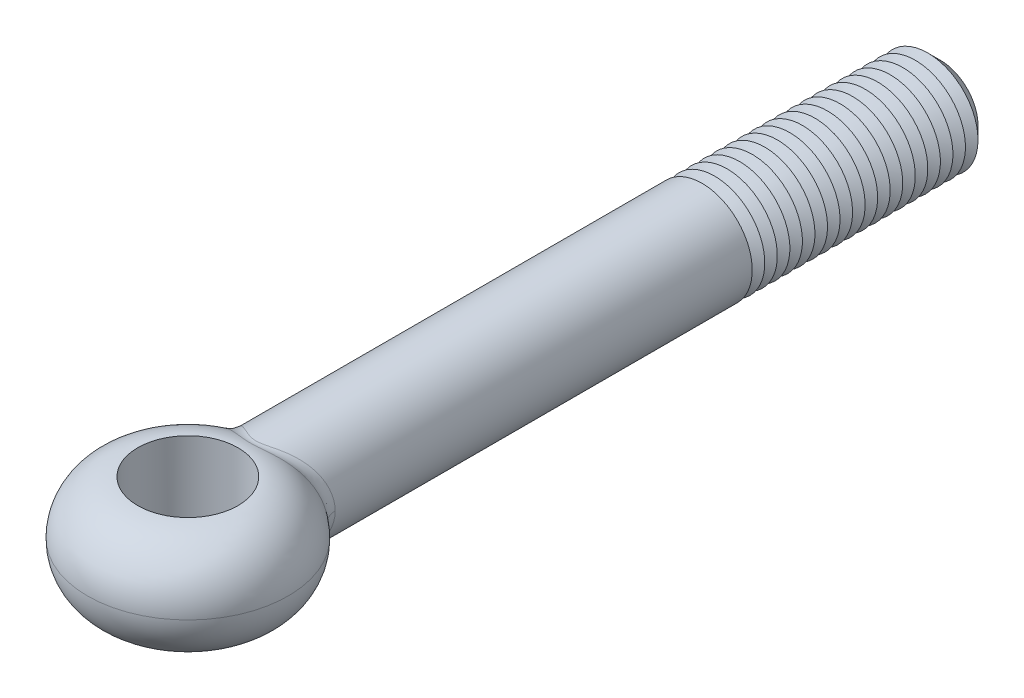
ISO-10303-21;
HEADER;
FILE_DESCRIPTION(('STEP AP214'),'2;1');
FILE_NAME('part.step','',(''),(''),'','','');
FILE_SCHEMA(('AUTOMOTIVE_DESIGN { 1 0 10303 214 1 1 1 1 }'));
ENDSEC;
DATA;
#1=APPLICATION_CONTEXT('core data for automotive mechanical design processes');
#2=APPLICATION_PROTOCOL_DEFINITION('international standard','automotive_design',2000,#1);
#3=PRODUCT_CONTEXT('',#1,'mechanical');
#4=PRODUCT('Part','Part','',(#3));
#5=PRODUCT_RELATED_PRODUCT_CATEGORY('part','',(#4));
#6=PRODUCT_DEFINITION_FORMATION('','',#4);
#7=PRODUCT_DEFINITION_CONTEXT('part definition',#1,'design');
#8=PRODUCT_DEFINITION('design','',#6,#7);
#9=PRODUCT_DEFINITION_SHAPE('','',#8);
#10=(LENGTH_UNIT() NAMED_UNIT(*) SI_UNIT(.MILLI.,.METRE.));
#11=(NAMED_UNIT(*) PLANE_ANGLE_UNIT() SI_UNIT($,.RADIAN.));
#12=(NAMED_UNIT(*) SI_UNIT($,.STERADIAN.) SOLID_ANGLE_UNIT());
#13=UNCERTAINTY_MEASURE_WITH_UNIT(LENGTH_MEASURE(1.E-05),#10,'distance_accuracy_value','');
#14=(GEOMETRIC_REPRESENTATION_CONTEXT(3) GLOBAL_UNCERTAINTY_ASSIGNED_CONTEXT((#13)) GLOBAL_UNIT_ASSIGNED_CONTEXT((#10,
#11,#12)) REPRESENTATION_CONTEXT('',''));
#15=CARTESIAN_POINT('',(0.,0.,0.));
#16=DIRECTION('',(0.,0.,1.));
#17=DIRECTION('',(1.,0.,0.));
#18=AXIS2_PLACEMENT_3D('',#15,#16,#17);
#19=CARTESIAN_POINT('',(0.,0.,-120.));
#20=DIRECTION('',(0.,0.,1.));
#21=DIRECTION('',(1.,0.,0.));
#22=AXIS2_PLACEMENT_3D('',#19,#20,#21);
#23=CYLINDRICAL_SURFACE('',#22,8.);
#24=CARTESIAN_POINT('',(0.,0.,-82.));
#25=DIRECTION('',(0.,0.,-1.));
#26=DIRECTION('',(-1.,0.,0.));
#27=AXIS2_PLACEMENT_3D('',#24,#25,#26);
#28=CIRCLE('',#27,8.);
#29=CARTESIAN_POINT('',(-8.,0.,-82.));
#30=VERTEX_POINT('',#29);
#31=EDGE_CURVE('E78',#30,#30,#28,.T.);
#32=ORIENTED_EDGE('',*,*,#31,.F.);
#33=EDGE_LOOP('',(#32));
#34=FACE_BOUND('',#33,.T.);
#35=CARTESIAN_POINT('',(7.65571552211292,-4.70868832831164,-12.4043242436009));
#36=CARTESIAN_POINT('',(6.72728970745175,-4.34389938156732,-13.262564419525));
#37=CARTESIAN_POINT('',(6.52180502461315,-4.63314787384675,-14.5297396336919));
#38=CARTESIAN_POINT('',(7.78528037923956,-4.53966232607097,-12.4565567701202));
#39=CARTESIAN_POINT('',(6.83379002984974,-4.17832451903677,-13.3197976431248));
#40=CARTESIAN_POINT('',(6.63998731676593,-4.46683351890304,-14.6083073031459));
#41=CARTESIAN_POINT('',(7.90812409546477,-4.36526473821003,-12.5059716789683));
#42=CARTESIAN_POINT('',(6.93368225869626,-4.0095233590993,-13.3734055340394));
#43=CARTESIAN_POINT('',(6.75228850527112,-4.29523375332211,-14.6825830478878));
#44=CARTESIAN_POINT('',(8.13948466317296,-4.00670892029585,-12.5988603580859));
#45=CARTESIAN_POINT('',(7.12062810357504,-3.66549770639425,-13.4736177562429));
#46=CARTESIAN_POINT('',(6.9641575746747,-3.94243016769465,-14.8221229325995));
#47=CARTESIAN_POINT('',(8.24799717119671,-3.82254775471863,-12.6423323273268));
#48=CARTESIAN_POINT('',(7.20758377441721,-3.49031776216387,-13.5201690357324));
#49=CARTESIAN_POINT('',(7.06372159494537,-3.76122345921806,-14.8873843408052));
#50=CARTESIAN_POINT('',(8.44978241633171,-3.44545520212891,-12.7230176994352));
#51=CARTESIAN_POINT('',(7.36833540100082,-3.13449696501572,-13.6061398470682));
#52=CARTESIAN_POINT('',(7.24911953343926,-3.39018051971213,-15.0084504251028));
#53=CARTESIAN_POINT('',(8.54304739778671,-3.25251941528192,-12.7602279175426));
#54=CARTESIAN_POINT('',(7.44203446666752,-2.95392242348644,-13.6455071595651));
#55=CARTESIAN_POINT('',(7.33494646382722,-3.20033995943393,-15.0642502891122));
#56=CARTESIAN_POINT('',(8.71342620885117,-2.85921824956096,-12.8280902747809));
#57=CARTESIAN_POINT('',(7.57598659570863,-2.58837905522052,-13.7170010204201));
#58=CARTESIAN_POINT('',(7.49190592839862,-2.81334843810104,-15.1659728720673));
#59=CARTESIAN_POINT('',(8.79054223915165,-2.65885388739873,-12.8587433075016));
#60=CARTESIAN_POINT('',(7.6361598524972,-2.40349985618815,-13.7490847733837));
#61=CARTESIAN_POINT('',(7.56304046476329,-2.6161984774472,-15.211896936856));
#62=CARTESIAN_POINT('',(8.92571181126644,-2.25853949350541,-12.9123976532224));
#63=CARTESIAN_POINT('',(7.74119890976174,-2.03625449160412,-13.8050560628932));
#64=CARTESIAN_POINT('',(7.68782564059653,-2.22230623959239,-15.292254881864));
#65=CARTESIAN_POINT('',(8.98429621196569,-2.05878122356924,-12.9356123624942));
#66=CARTESIAN_POINT('',(7.78643285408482,-1.85408075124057,-13.8291409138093));
#67=CARTESIAN_POINT('',(7.74196276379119,-2.02575264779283,-15.3270093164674));
#68=CARTESIAN_POINT('',(9.08514258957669,-1.65481550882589,-12.9755337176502));
#69=CARTESIAN_POINT('',(7.86407915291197,-1.48723318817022,-13.8704667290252));
#70=CARTESIAN_POINT('',(7.83520435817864,-1.62826766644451,-15.3867612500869));
#71=CARTESIAN_POINT('',(9.12739921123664,-1.45060662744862,-12.9922382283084));
#72=CARTESIAN_POINT('',(7.89643738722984,-1.3026689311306,-13.887678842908));
#73=CARTESIAN_POINT('',(7.87430389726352,-1.42733486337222,-15.4117555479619));
#74=CARTESIAN_POINT('',(9.19512372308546,-1.03944863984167,-13.0189938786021));
#75=CARTESIAN_POINT('',(7.94822057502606,-0.932097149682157,-13.9152169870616));
#76=CARTESIAN_POINT('',(7.93698863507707,-1.02277299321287,-15.4517833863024));
#77=CARTESIAN_POINT('',(9.22061021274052,-0.832502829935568,-13.0290523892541));
#78=CARTESIAN_POINT('',(7.96762552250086,-0.746210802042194,-13.9255323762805));
#79=CARTESIAN_POINT('',(7.96059102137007,-0.819147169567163,-15.4668279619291));
#80=CARTESIAN_POINT('',(9.25463049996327,-0.417038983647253,-13.042476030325));
#81=CARTESIAN_POINT('',(7.99352641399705,-0.373487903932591,-13.9392998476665));
#82=CARTESIAN_POINT('',(7.99209967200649,-0.41034851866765,-15.4869048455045));
#83=CARTESIAN_POINT('',(9.26315800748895,-0.208520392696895,-13.0458386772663));
#84=CARTESIAN_POINT('',(8.00000000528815,-0.186776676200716,-13.9427400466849));
#85=CARTESIAN_POINT('',(8.00000011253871,-0.205175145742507,-15.4919334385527));
#86=CARTESIAN_POINT('',(9.26315778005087,0.212096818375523,-13.0458386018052));
#87=CARTESIAN_POINT('',(7.99999999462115,0.189980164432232,-13.9427400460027));
#88=CARTESIAN_POINT('',(7.99999988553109,0.208694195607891,-15.4919333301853));
#89=CARTESIAN_POINT('',(9.25433501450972,0.424195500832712,-13.0423595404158));
#90=CARTESIAN_POINT('',(7.99330246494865,0.379894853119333,-13.9391808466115));
#91=CARTESIAN_POINT('',(7.99182588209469,0.417390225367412,-15.4867306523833));
#92=CARTESIAN_POINT('',(9.21912567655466,0.846898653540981,-13.0284665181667));
#93=CARTESIAN_POINT('',(7.96649487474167,0.759132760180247,-13.9249313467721));
#94=CARTESIAN_POINT('',(7.95921621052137,0.833312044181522,-15.4659516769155));
#95=CARTESIAN_POINT('',(9.19273228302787,1.05750251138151,-13.0180498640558));
#96=CARTESIAN_POINT('',(7.94639841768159,0.948323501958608,-13.9142482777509));
#97=CARTESIAN_POINT('',(7.93477422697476,1.04053723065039,-15.4503713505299));
#98=CARTESIAN_POINT('',(9.12263828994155,1.47558922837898,-12.9903565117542));
#99=CARTESIAN_POINT('',(7.89279270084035,1.32522192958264,-13.8857402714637));
#100=CARTESIAN_POINT('',(7.86989829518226,1.45191667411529,-15.4089401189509));
#101=CARTESIAN_POINT('',(9.07893758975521,1.68307206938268,-12.9730797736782));
#102=CARTESIAN_POINT('',(7.85932019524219,1.51280379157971,-13.867934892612));
#103=CARTESIAN_POINT('',(7.82946425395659,1.65607091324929,-15.3830891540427));
#104=CARTESIAN_POINT('',(8.97463738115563,2.09350607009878,-12.9317860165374));
#105=CARTESIAN_POINT('',(7.77898033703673,1.88569930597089,-13.8251732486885));
#106=CARTESIAN_POINT('',(7.73303581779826,2.05992041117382,-15.3212813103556));
#107=CARTESIAN_POINT('',(8.91403167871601,2.29645553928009,-12.9077665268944));
#108=CARTESIAN_POINT('',(7.73216134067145,2.07089682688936,-13.8002427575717));
#109=CARTESIAN_POINT('',(7.67703571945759,2.25961400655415,-15.2853207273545));
#110=CARTESIAN_POINT('',(8.7766400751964,2.69595109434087,-12.8532186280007));
#111=CARTESIAN_POINT('',(7.62531367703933,2.43769964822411,-13.7433022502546));
#112=CARTESIAN_POINT('',(7.55021504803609,2.65270054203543,-15.2036203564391));
#113=CARTESIAN_POINT('',(8.69988632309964,2.8925090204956,-12.8227031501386));
#114=CARTESIAN_POINT('',(7.56537860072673,2.61920953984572,-13.7113422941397));
#115=CARTESIAN_POINT('',(7.47942392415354,2.84610513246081,-15.1578999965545));
#116=CARTESIAN_POINT('',(8.53082157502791,3.27836797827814,-12.7553515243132));
#117=CARTESIAN_POINT('',(7.43237570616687,2.97809298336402,-13.6403484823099));
#118=CARTESIAN_POINT('',(7.32369350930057,3.2257738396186,-15.0569382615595));
#119=CARTESIAN_POINT('',(8.43850992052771,3.46766870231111,-12.7185151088));
#120=CARTESIAN_POINT('',(7.35938539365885,3.15538265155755,-13.6013561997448));
#121=CARTESIAN_POINT('',(7.23875361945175,3.41203765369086,-15.0016964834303));
#122=CARTESIAN_POINT('',(8.23912752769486,3.83785366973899,-12.638780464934));
#123=CARTESIAN_POINT('',(7.200476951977,3.50486381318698,-13.5163651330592));
#124=CARTESIAN_POINT('',(7.05558212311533,3.77628382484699,-14.8820525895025));
#125=CARTESIAN_POINT('',(8.13205660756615,4.01873780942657,-12.5958821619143));
#126=CARTESIAN_POINT('',(7.1146443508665,3.676990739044,-13.470412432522));
#127=CARTESIAN_POINT('',(6.95735035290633,3.9542660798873,-14.8176503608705));
#128=CARTESIAN_POINT('',(7.90405644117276,4.37102436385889,-12.5043342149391));
#129=CARTESIAN_POINT('',(6.93036449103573,4.01512460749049,-13.3716246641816));
#130=CARTESIAN_POINT('',(6.74856869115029,4.30090097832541,-14.6801217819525));
#131=CARTESIAN_POINT('',(7.7831309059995,4.54242929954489,-12.455686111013));
#132=CARTESIAN_POINT('',(6.83201017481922,4.18108915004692,-13.3188399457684));
#133=CARTESIAN_POINT('',(6.6380220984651,4.46955610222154,-14.606997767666));
#134=CARTESIAN_POINT('',(7.52417170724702,4.88033437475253,-12.3512981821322));
#135=CARTESIAN_POINT('',(6.61966655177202,4.51122245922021,-13.2047290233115));
#136=CARTESIAN_POINT('',(6.40182236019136,4.8020402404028,-14.4499782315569));
#137=CARTESIAN_POINT('',(7.38571067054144,5.04649564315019,-12.2953796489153));
#138=CARTESIAN_POINT('',(6.50535488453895,4.67515888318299,-13.1432256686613));
#139=CARTESIAN_POINT('',(6.27579579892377,4.96553581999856,-14.3658104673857));
#140=CARTESIAN_POINT('',(7.09600101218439,5.36700983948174,-12.1781888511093));
#141=CARTESIAN_POINT('',(6.26419128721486,4.99444350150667,-13.0133186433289));
#142=CARTESIAN_POINT('',(6.01283258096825,5.28090807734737,-14.1892780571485));
#143=CARTESIAN_POINT('',(6.9447557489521,5.52136584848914,-12.1169179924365));
#144=CARTESIAN_POINT('',(6.13743653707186,5.14979233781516,-12.9449680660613));
#145=CARTESIAN_POINT('',(5.87589879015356,5.43278778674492,-14.096915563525));
#146=CARTESIAN_POINT('',(6.63032399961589,5.81777921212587,-11.9894408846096));
#147=CARTESIAN_POINT('',(5.87186134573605,5.45104206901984,-12.8016646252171));
#148=CARTESIAN_POINT('',(5.59214975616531,5.72444585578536,-13.9045942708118));
#149=CARTESIAN_POINT('',(6.46713092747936,5.95982968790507,-11.9232319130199));
#150=CARTESIAN_POINT('',(5.73311888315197,5.5969588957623,-12.7267542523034));
#151=CARTESIAN_POINT('',(5.44532906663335,5.864217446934,-13.8046312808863));
#152=CARTESIAN_POINT('',(6.12980638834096,6.23103471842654,-11.7864658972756));
#153=CARTESIAN_POINT('',(5.44428764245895,5.8782916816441,-12.5708631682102));
#154=CARTESIAN_POINT('',(5.14301550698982,6.13107159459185,-13.597971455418));
#155=CARTESIAN_POINT('',(5.95567749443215,6.36019228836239,-11.7159098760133));
#156=CARTESIAN_POINT('',(5.2942739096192,6.01375077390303,-12.4899226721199));
#157=CARTESIAN_POINT('',(4.98752467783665,6.25815711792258,-13.4912762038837));
#158=CARTESIAN_POINT('',(5.58077734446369,6.61655266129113,-11.5644429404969));
#159=CARTESIAN_POINT('',(4.96933836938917,6.28519206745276,-12.3149807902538));
#160=CARTESIAN_POINT('',(4.65426780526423,6.51040475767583,-13.2620454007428));
#161=CARTESIAN_POINT('',(5.37902613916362,6.74249537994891,-11.4831752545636));
#162=CARTESIAN_POINT('',(4.79337910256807,6.42023065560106,-12.2204520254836));
#163=CARTESIAN_POINT('',(4.47576535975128,6.63432700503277,-13.1389537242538));
#164=CARTESIAN_POINT('',(4.96405939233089,6.97841153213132,-11.3172707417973));
#165=CARTESIAN_POINT('',(4.42939848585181,6.67584287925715,-12.0261057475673));
#166=CARTESIAN_POINT('',(4.11078186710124,6.86645840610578,-12.8874694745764));
#167=CARTESIAN_POINT('',(4.75084610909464,7.08838809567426,-11.2326345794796));
#168=CARTESIAN_POINT('',(4.24142531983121,6.79651407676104,-11.9263073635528));
#169=CARTESIAN_POINT('',(3.9243023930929,6.97467063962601,-12.7590779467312));
#170=CARTESIAN_POINT('',(4.31305945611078,7.29234286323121,-11.0613975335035));
#171=CARTESIAN_POINT('',(3.85380278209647,7.02260612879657,-11.7231213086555));
#172=CARTESIAN_POINT('',(3.54408562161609,7.17535340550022,-12.4991467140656));
#173=CARTESIAN_POINT('',(4.08848183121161,7.3863150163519,-10.9747959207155));
#174=CARTESIAN_POINT('',(3.654162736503,7.12813046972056,-11.6197260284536));
#175=CARTESIAN_POINT('',(3.35034561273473,7.26781798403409,-12.3676058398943));
#176=CARTESIAN_POINT('',(3.62764081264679,7.55817215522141,-10.8018106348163));
#177=CARTESIAN_POINT('',(3.24335533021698,7.32304867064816,-11.4120811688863));
#178=CARTESIAN_POINT('',(2.95605890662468,7.43691805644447,-12.1047402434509));
#179=CARTESIAN_POINT('',(3.3913812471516,7.63606236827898,-10.7154268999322));
#180=CARTESIAN_POINT('',(3.03217009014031,7.41256504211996,-11.3077963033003));
#181=CARTESIAN_POINT('',(2.7555144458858,7.51355869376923,-11.9734154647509));
#182=CARTESIAN_POINT('',(3.01086953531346,7.74546693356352,-10.5830417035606));
#183=CARTESIAN_POINT('',(2.69133046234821,7.53961841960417,-11.1471485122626));
#184=CARTESIAN_POINT('',(2.43558876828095,7.62120810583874,-11.7721230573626));
#185=CARTESIAN_POINT('',(2.87105562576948,7.78246196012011,-10.5357450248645));
#186=CARTESIAN_POINT('',(2.5661213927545,7.58284459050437,-11.0896499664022));
#187=CARTESIAN_POINT('',(2.31864844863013,7.65760962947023,-11.700201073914));
#188=CARTESIAN_POINT('',(2.58677327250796,7.85120381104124,-10.4433981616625));
#189=CARTESIAN_POINT('',(2.31149724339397,7.66361225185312,-10.9771506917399));
#190=CARTESIAN_POINT('',(2.08222311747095,7.725248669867,-11.5597728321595));
#191=CARTESIAN_POINT('',(2.4423056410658,7.88295154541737,-10.3983475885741));
#192=CARTESIAN_POINT('',(2.18206471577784,7.70117677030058,-10.9221313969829));
#193=CARTESIAN_POINT('',(1.96273855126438,7.75648708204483,-11.4912659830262));
#194=CARTESIAN_POINT('',(2.14829229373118,7.94107768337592,-10.3118779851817));
#195=CARTESIAN_POINT('',(1.91873101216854,7.77031102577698,-10.8163504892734));
#196=CARTESIAN_POINT('',(1.72099254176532,7.81368071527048,-11.3597855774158));
#197=CARTESIAN_POINT('',(1.99874950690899,7.96745912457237,-10.270456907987));
#198=CARTESIAN_POINT('',(1.78480669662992,7.80190571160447,-10.7655636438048));
#199=CARTESIAN_POINT('',(1.59873271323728,7.83963892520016,-11.2968089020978));
#200=CARTESIAN_POINT('',(1.69405593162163,8.0146723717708,-10.193104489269));
#201=CARTESIAN_POINT('',(1.51212291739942,7.85870857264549,-10.6706050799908));
#202=CARTESIAN_POINT('',(1.35106400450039,7.88609474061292,-11.1792198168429));
#203=CARTESIAN_POINT('',(1.53890651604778,8.03550552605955,-10.1571718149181));
#204=CARTESIAN_POINT('',(1.3733287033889,7.88393882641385,-10.6264046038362));
#205=CARTESIAN_POINT('',(1.22565589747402,7.90659367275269,-11.1246053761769));
#206=CARTESIAN_POINT('',(1.26101534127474,8.06699003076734,-10.1009556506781));
#207=CARTESIAN_POINT('',(1.12491664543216,7.92221302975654,-10.5571921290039));
#208=CARTESIAN_POINT('',(1.00219933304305,7.93757307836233,-11.0391767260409));
#209=CARTESIAN_POINT('',(1.13947852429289,8.07888519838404,-10.0789878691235));
#210=CARTESIAN_POINT('',(1.01633877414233,7.93673299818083,-10.5301169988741));
#211=CARTESIAN_POINT('',(0.90484411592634,7.94927741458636,-11.0057989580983));
#212=CARTESIAN_POINT('',(0.893460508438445,8.09911575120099,-10.0408546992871));
#213=CARTESIAN_POINT('',(0.796699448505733,7.96148016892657,-10.4831027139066));
#214=CARTESIAN_POINT('',(0.708414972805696,7.96918341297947,-10.9478665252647));
#215=CARTESIAN_POINT('',(0.768980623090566,8.10745269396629,-10.0246867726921));
#216=CARTESIAN_POINT('',(0.685612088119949,7.97171600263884,-10.4631484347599));
#217=CARTESIAN_POINT('',(0.609341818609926,7.97738660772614,-10.9233080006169));
#218=CARTESIAN_POINT('',(0.518300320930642,8.12036544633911,-9.9993428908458));
#219=CARTESIAN_POINT('',(0.46202700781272,7.98758747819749,-10.4318683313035));
#220=CARTESIAN_POINT('',(0.410276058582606,7.99009220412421,-10.8848145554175));
#221=CARTESIAN_POINT('',(0.39210936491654,8.12495695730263,-9.99013775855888));
#222=CARTESIAN_POINT('',(0.349505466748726,7.99324704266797,-10.4204974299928));
#223=CARTESIAN_POINT('',(0.310289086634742,7.99461005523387,-10.8708353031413));
#224=CARTESIAN_POINT('',(0.138717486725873,8.13030926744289,-9.97938544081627));
#225=CARTESIAN_POINT('',(0.123640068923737,7.99984388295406,-10.4072188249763));
#226=CARTESIAN_POINT('',(0.109710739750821,7.99987649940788,-10.8545066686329));
#227=CARTESIAN_POINT('',(0.0115166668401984,8.13107044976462,-9.97783748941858));
#228=CARTESIAN_POINT('',(0.0102607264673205,8.00078372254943,-10.4053059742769));
#229=CARTESIAN_POINT('',(0.00911942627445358,8.00062546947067,-10.8521561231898));
#230=CARTESIAN_POINT('',(-0.242597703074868,8.12873778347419,-9.98254200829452));
#231=CARTESIAN_POINT('',(-0.216224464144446,7.99790731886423,-10.4111163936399));
#232=CARTESIAN_POINT('',(-0.191921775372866,7.99833022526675,-10.8593002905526));
#233=CARTESIAN_POINT('',(-0.369510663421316,8.1256389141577,-9.9888046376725));
#234=CARTESIAN_POINT('',(-0.329366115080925,7.99408395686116,-10.4188540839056));
#235=CARTESIAN_POINT('',(-0.292371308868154,7.9952810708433,-10.8688104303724));
#236=CARTESIAN_POINT('',(-0.62154313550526,8.1156691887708,-10.0085955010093));
#237=CARTESIAN_POINT('',(-0.55409126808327,7.98181341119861,-10.4432875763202));
#238=CARTESIAN_POINT('',(-0.492201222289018,7.98547128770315,-10.8988675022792));
#239=CARTESIAN_POINT('',(-0.746662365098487,8.1087977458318,-10.0221248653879));
#240=CARTESIAN_POINT('',(-0.665708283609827,7.97336172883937,-10.4599921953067));
#241=CARTESIAN_POINT('',(-0.591581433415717,7.97871008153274,-10.9194161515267));
#242=CARTESIAN_POINT('',(-0.994807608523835,8.09140385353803,-10.0554975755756));
#243=CARTESIAN_POINT('',(-0.887155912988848,7.95203968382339,-10.5011571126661));
#244=CARTESIAN_POINT('',(-0.789239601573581,7.9615952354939,-10.9701112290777));
#245=CARTESIAN_POINT('',(-1.11781918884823,8.08086243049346,-10.0753736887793));
#246=CARTESIAN_POINT('',(-0.997003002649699,7.93914030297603,-10.5256688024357));
#247=CARTESIAN_POINT('',(-0.887509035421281,7.95122292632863,-11.0003074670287));
#248=CARTESIAN_POINT('',(-1.36062252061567,8.05632046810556,-10.1202009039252));
#249=CARTESIAN_POINT('',(-1.21391840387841,7.90923091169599,-10.5808872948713));
#250=CARTESIAN_POINT('',(-1.08217747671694,7.92707468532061,-11.0684211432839));
#251=CARTESIAN_POINT('',(-1.48041386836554,8.04231949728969,-10.1451526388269));
#252=CARTESIAN_POINT('',(-1.32101027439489,7.89221272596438,-10.6116076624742));
#253=CARTESIAN_POINT('',(-1.17857624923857,7.91329832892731,-11.1063395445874));
#254=CARTESIAN_POINT('',(-1.83571751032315,7.99525450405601,-10.2260259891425));
#255=CARTESIAN_POINT('',(-1.63896719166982,7.83523151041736,-10.7111025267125));
#256=CARTESIAN_POINT('',(-1.46567741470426,7.86698838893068,-11.2292596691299));
#257=CARTESIAN_POINT('',(-2.06624268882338,7.95719484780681,-10.2878252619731));
#258=CARTESIAN_POINT('',(-1.84542427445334,7.78943990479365,-10.786994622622));
#259=CARTESIAN_POINT('',(-1.65355562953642,7.82953931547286,-11.323212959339));
#260=CARTESIAN_POINT('',(-2.51536964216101,7.86860887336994,-10.4197592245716));
#261=CARTESIAN_POINT('',(-2.24768618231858,7.68406371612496,-10.9484016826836));
#262=CARTESIAN_POINT('',(-2.02278766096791,7.74237450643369,-11.523822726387));
#263=CARTESIAN_POINT('',(-2.7339584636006,7.81806932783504,-10.4899027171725));
#264=CARTESIAN_POINT('',(-2.44357001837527,7.62438808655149,-11.0340073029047));
#265=CARTESIAN_POINT('',(-2.20413431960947,7.69264575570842,-11.6304926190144));
#266=CARTESIAN_POINT('',(-3.16114079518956,7.7047711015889,-10.6341356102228));
#267=CARTESIAN_POINT('',(-2.82605678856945,7.49212963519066,-11.209290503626));
#268=CARTESIAN_POINT('',(-2.56144019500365,7.5811651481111,-11.8498152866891));
#269=CARTESIAN_POINT('',(-3.36972002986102,7.64199557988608,-10.7082303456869));
#270=CARTESIAN_POINT('',(-3.01269895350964,7.41945044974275,-11.2990288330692));
#271=CARTESIAN_POINT('',(-2.7373915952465,7.51939672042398,-11.9624761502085));
#272=CARTESIAN_POINT('',(-3.77761069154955,7.50439428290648,-10.8574864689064));
#273=CARTESIAN_POINT('',(-3.37700705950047,7.26193164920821,-11.478951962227));
#274=CARTESIAN_POINT('',(-3.08400676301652,7.38400293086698,-12.1893535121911));
#275=CARTESIAN_POINT('',(-3.97692585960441,7.42957342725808,-10.9326474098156));
#276=CARTESIAN_POINT('',(-3.55470238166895,7.17701899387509,-11.5691696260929));
#277=CARTESIAN_POINT('',(-3.25467265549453,7.31038240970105,-12.3035693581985));
#278=CARTESIAN_POINT('',(-4.39445558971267,7.2564786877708,-11.0928561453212));
#279=CARTESIAN_POINT('',(-3.92598763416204,6.98268785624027,-11.7605523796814));
#280=CARTESIAN_POINT('',(-3.61448048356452,7.14006459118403,-12.5469124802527));
#281=CARTESIAN_POINT('',(-4.61137762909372,7.15638577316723,-11.1778053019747));
#282=CARTESIAN_POINT('',(-4.11816178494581,6.87146818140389,-11.8614202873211));
#283=CARTESIAN_POINT('',(-3.80283870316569,7.04157744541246,-12.6758739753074));
#284=CARTESIAN_POINT('',(-5.03418640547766,6.94053636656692,-11.3451201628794));
#285=CARTESIAN_POINT('',(-4.49106527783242,6.6346292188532,-12.0588431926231));
#286=CARTESIAN_POINT('',(-4.17223411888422,6.82919086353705,-12.9297006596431));
#287=CARTESIAN_POINT('',(-5.24007150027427,6.82477755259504,-11.4274854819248));
#288=CARTESIAN_POINT('',(-4.67176487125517,6.50890803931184,-12.1553921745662));
#289=CARTESIAN_POINT('',(-4.35327022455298,6.71528914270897,-13.0545652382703));
#290=CARTESIAN_POINT('',(-5.64018983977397,6.57785054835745,-11.5883608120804));
#291=CARTESIAN_POINT('',(-5.02102168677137,6.24402103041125,-12.3427259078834));
#292=CARTESIAN_POINT('',(-4.70691034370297,6.47232353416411,-13.2982594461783));
#293=CARTESIAN_POINT('',(-5.83443208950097,6.44669450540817,-11.6668737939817));
#294=CARTESIAN_POINT('',(-5.18953304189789,6.10478124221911,-12.4334896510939));
#295=CARTESIAN_POINT('',(-4.87952085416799,6.34327159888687,-13.417093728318));
#296=CARTESIAN_POINT('',(-6.21062987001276,6.16921890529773,-11.8191988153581));
#297=CARTESIAN_POINT('',(-5.5138573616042,5.81373255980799,-12.6083829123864));
#298=CARTESIAN_POINT('',(-5.2152572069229,6.07024747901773,-13.6474577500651));
#299=CARTESIAN_POINT('',(-6.39258596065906,6.02290003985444,-11.8930110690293));
#300=CARTESIAN_POINT('',(-5.66959067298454,5.66186103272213,-12.6924706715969));
#301=CARTESIAN_POINT('',(-5.37838348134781,5.9262759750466,-13.7589878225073));
#302=CARTESIAN_POINT('',(-6.76082954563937,5.70011889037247,-12.0423592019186));
#303=CARTESIAN_POINT('',(-5.98269684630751,5.33064591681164,-12.8614822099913));
#304=CARTESIAN_POINT('',(-5.7096924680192,5.60867313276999,-13.9844670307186));
#305=CARTESIAN_POINT('',(-6.94571467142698,5.52210505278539,-12.1173228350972));
#306=CARTESIAN_POINT('',(-6.1384387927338,5.15012845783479,-12.9455201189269));
#307=CARTESIAN_POINT('',(-5.87673584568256,5.4335151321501,-14.0975328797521));
#308=CARTESIAN_POINT('',(-7.2978095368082,5.14921557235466,-12.2598587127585));
#309=CARTESIAN_POINT('',(-6.432710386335,4.77666871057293,-13.1041242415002));
#310=CARTESIAN_POINT('',(-6.19585367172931,5.06660783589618,-14.3123318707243));
#311=CARTESIAN_POINT('',(-7.46501728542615,4.95433803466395,-12.3274301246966));
#312=CARTESIAN_POINT('',(-6.5710843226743,4.58371724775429,-13.1786053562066));
#313=CARTESIAN_POINT('',(-6.34792643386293,4.87485667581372,-14.4140637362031));
#314=CARTESIAN_POINT('',(-7.78013527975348,4.54891459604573,-12.4544969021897));
#315=CARTESIAN_POINT('',(-6.82982333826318,4.18696009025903,-13.3176780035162));
#316=CARTESIAN_POINT('',(-6.63524155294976,4.47593735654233,-14.6052189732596));
#317=CARTESIAN_POINT('',(-7.92803665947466,4.33836156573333,-12.5139885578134));
#318=CARTESIAN_POINT('',(-6.95001540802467,3.98318853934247,-13.3821752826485));
#319=CARTESIAN_POINT('',(-6.77047617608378,4.26876218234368,-14.6946366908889));
#320=CARTESIAN_POINT('',(-8.20275756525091,3.90330017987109,-12.6242339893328));
#321=CARTESIAN_POINT('',(-7.17161528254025,3.56660483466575,-13.5009298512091));
#322=CARTESIAN_POINT('',(-7.02216465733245,3.84068039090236,-14.8602256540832));
#323=CARTESIAN_POINT('',(-8.32958109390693,3.67879448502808,-12.6749894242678));
#324=CARTESIAN_POINT('',(-7.27286247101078,3.35388041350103,-13.5551002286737));
#325=CARTESIAN_POINT('',(-7.13862208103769,3.61977639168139,-14.9363994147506));
#326=CARTESIAN_POINT('',(-8.54733325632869,3.24423340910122,-12.7619453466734));
#327=CARTESIAN_POINT('',(-7.44552191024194,2.94603669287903,-13.6473748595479));
#328=CARTESIAN_POINT('',(-7.33887694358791,3.19218688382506,-15.0668289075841));
#329=CARTESIAN_POINT('',(-8.64071095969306,3.03547652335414,-12.7991477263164));
#330=CARTESIAN_POINT('',(-7.51894899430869,2.75170647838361,-13.6865686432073));
#331=CARTESIAN_POINT('',(-7.42488873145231,2.98677903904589,-15.1225967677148));
#332=CARTESIAN_POINT('',(-8.80876711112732,2.61008550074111,-12.865990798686));
#333=CARTESIAN_POINT('',(-7.65044657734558,2.35845430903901,-13.7567044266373));
#334=CARTESIAN_POINT('',(-7.57984616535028,2.56821247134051,-15.2227563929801));
#335=CARTESIAN_POINT('',(-8.88344772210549,2.39345227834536,-12.8956323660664));
#336=CARTESIAN_POINT('',(-7.70842508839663,2.15964982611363,-13.7875971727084));
#337=CARTESIAN_POINT('',(-7.64879378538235,2.35505464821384,-15.2671494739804));
#338=CARTESIAN_POINT('',(-9.01314517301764,1.9545388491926,-12.9470441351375));
#339=CARTESIAN_POINT('',(-7.80874691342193,1.75904530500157,-13.8410223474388));
#340=CARTESIAN_POINT('',(-7.76862124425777,1.9231826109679,-15.3441237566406));
#341=CARTESIAN_POINT('',(-9.06820874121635,1.7322734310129,-12.9688330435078));
#342=CARTESIAN_POINT('',(-7.85105172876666,1.55739026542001,-13.8635342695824));
#343=CARTESIAN_POINT('',(-7.81954401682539,1.70448294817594,-15.3767330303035));
#344=CARTESIAN_POINT('',(-9.15827613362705,1.28352045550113,-13.0044431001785));
#345=CARTESIAN_POINT('',(-7.92010315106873,1.151767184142,-13.9002668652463));
#346=CARTESIAN_POINT('',(-7.90287516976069,1.26292921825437,-15.4300168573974));
#347=CARTESIAN_POINT('',(-9.19329180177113,1.05703547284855,-13.0182689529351));
#348=CARTESIAN_POINT('',(-7.94680432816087,0.94795427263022,-13.9144633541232));
#349=CARTESIAN_POINT('',(-7.93529448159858,1.04007768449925,-15.4506984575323));
#350=CARTESIAN_POINT('',(-9.23310033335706,0.691727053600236,-13.0339812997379));
#351=CARTESIAN_POINT('',(-7.97713736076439,0.619900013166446,-13.9305885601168));
#352=CARTESIAN_POINT('',(-7.97215833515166,0.680629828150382,-15.4742000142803));
#353=CARTESIAN_POINT('',(-9.24436828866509,0.553629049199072,-13.0384268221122));
#354=CARTESIAN_POINT('',(-7.98571004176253,0.496050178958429,-13.9351451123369));
#355=CARTESIAN_POINT('',(-7.9825950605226,0.544747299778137,-15.4808487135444));
#356=CARTESIAN_POINT('',(-9.25939658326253,0.277025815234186,-13.0443552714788));
#357=CARTESIAN_POINT('',(-7.99714237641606,0.248119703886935,-13.9412213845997));
#358=CARTESIAN_POINT('',(-7.99651547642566,0.272581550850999,-15.4897150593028));
#359=CARTESIAN_POINT('',(-9.26315875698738,0.138520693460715,-13.0458389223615));
#360=CARTESIAN_POINT('',(-7.99999999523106,0.124076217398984,-13.9427400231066));
#361=CARTESIAN_POINT('',(-8.00000086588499,0.136298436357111,-15.4919337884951));
#362=CARTESIAN_POINT('',(-9.26315657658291,-0.211761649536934,-13.0458382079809));
#363=CARTESIAN_POINT('',(-8.00000000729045,-0.189679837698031,-13.9427400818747));
#364=CARTESIAN_POINT('',(-7.99999867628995,-0.208364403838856,-15.4919327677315));
#365=CARTESIAN_POINT('',(-9.25436090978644,-0.423559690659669,-13.0423697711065));
#366=CARTESIAN_POINT('',(-7.99332234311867,-0.379325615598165,-13.9391914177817));
#367=CARTESIAN_POINT('',(-7.99184985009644,-0.41676461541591,-15.486745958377));
#368=CARTESIAN_POINT('',(-9.2192545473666,-0.845675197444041,-13.0285173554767));
#369=CARTESIAN_POINT('',(-7.96659277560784,-0.758034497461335,-13.9249833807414));
#370=CARTESIAN_POINT('',(-7.95933558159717,-0.832108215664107,-15.4660277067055));
#371=CARTESIAN_POINT('',(-9.19293494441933,-1.05599185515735,-13.0181298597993));
#372=CARTESIAN_POINT('',(-7.94655277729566,-0.946965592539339,-13.9143303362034));
#373=CARTESIAN_POINT('',(-7.93496189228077,-1.03905080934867,-15.4504910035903));
#374=CARTESIAN_POINT('',(-9.12293145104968,-1.47414078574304,-12.9904724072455));
#375=CARTESIAN_POINT('',(-7.89301742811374,-1.32391258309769,-13.8858598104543));
#376=CARTESIAN_POINT('',(-7.87016954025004,-1.45049146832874,-15.4091135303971));
#377=CARTESIAN_POINT('',(-9.0791962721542,-1.68196383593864,-12.9731821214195));
#378=CARTESIAN_POINT('',(-7.85951913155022,-1.51179861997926,-13.8680407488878));
#379=CARTESIAN_POINT('',(-7.82970348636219,-1.65498045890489,-15.38324232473));
#380=CARTESIAN_POINT('',(-8.97478996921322,-2.09299557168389,-12.9318464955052));
#381=CARTESIAN_POINT('',(-7.77909835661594,-1.88523285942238,-13.8252360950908));
#382=CARTESIAN_POINT('',(-7.73317681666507,-2.05941810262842,-15.3213718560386));
#383=CARTESIAN_POINT('',(-8.91411827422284,-2.29620410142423,-12.9078009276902));
#384=CARTESIAN_POINT('',(-7.73222890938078,-2.07066511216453,-13.8002787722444));
#385=CARTESIAN_POINT('',(-7.67711567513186,-2.25936660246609,-15.2853722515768));
#386=CARTESIAN_POINT('',(-8.7765466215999,-2.69622247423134,-12.8531815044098));
#387=CARTESIAN_POINT('',(-7.62524114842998,-2.43794839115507,-13.7432635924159));
#388=CARTESIAN_POINT('',(-7.55012876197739,-2.65296756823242,-15.203564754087));
#389=CARTESIAN_POINT('',(-8.69967722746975,-2.89304357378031,-12.8226199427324));
#390=CARTESIAN_POINT('',(-7.56521539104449,-2.61970332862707,-13.7112552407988));
#391=CARTESIAN_POINT('',(-7.47923098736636,-2.84663111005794,-15.1577753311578));
#392=CARTESIAN_POINT('',(-8.53033202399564,-3.27942770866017,-12.7551564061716));
#393=CARTESIAN_POINT('',(-7.43198999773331,-2.97908029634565,-13.6401425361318));
#394=CARTESIAN_POINT('',(-7.32324290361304,-3.22681656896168,-15.056645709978));
#395=CARTESIAN_POINT('',(-8.43785406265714,-3.46898973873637,-12.7182535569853));
#396=CARTESIAN_POINT('',(-7.35886693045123,-3.15661777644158,-13.6010792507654));
#397=CARTESIAN_POINT('',(-7.23815063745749,-3.4133374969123,-15.0013041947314));
#398=CARTESIAN_POINT('',(-8.23838126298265,-3.83913533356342,-12.6384812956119));
#399=CARTESIAN_POINT('',(-7.19987817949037,-3.50608561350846,-13.5160445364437));
#400=CARTESIAN_POINT('',(-7.05489698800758,-3.7775449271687,-14.881603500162));
#401=CARTESIAN_POINT('',(-8.13142827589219,-4.01974280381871,-12.5956290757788));
#402=CARTESIAN_POINT('',(-7.11413550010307,-3.67796425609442,-13.4701394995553));
#403=CARTESIAN_POINT('',(-6.95677329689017,-3.95525495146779,-14.8172703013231));
#404=CARTESIAN_POINT('',(-7.90371313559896,-4.37152047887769,-12.5041971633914));
#405=CARTESIAN_POINT('',(-6.93008703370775,-4.01559388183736,-13.3714760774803));
#406=CARTESIAN_POINT('',(-6.74825601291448,-4.3013891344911,-14.6799157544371));
#407=CARTESIAN_POINT('',(-7.78295514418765,-4.54269350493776,-12.4556191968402));
#408=CARTESIAN_POINT('',(-6.83187409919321,-4.18130307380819,-13.3187679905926));
#409=CARTESIAN_POINT('',(-6.63786611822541,-4.46981606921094,-14.6068970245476));
#410=CARTESIAN_POINT('',(-7.65571552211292,-4.70868832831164,-12.4043242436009));
#411=CARTESIAN_POINT('',(-6.72728970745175,-4.34389938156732,-13.262564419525));
#412=CARTESIAN_POINT('',(-6.52180502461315,-4.63314787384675,-14.5297396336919));
#413=(BOUNDED_SURFACE() B_SPLINE_SURFACE(3,2,((#35,#36,#37),(#38,#39,#40),(#41,#42,#43),(#44,
#45,#46),(#47,#48,#49),(#50,#51,#52),(#53,#54,#55),(#56,#57,#58),(#59,#60,#61),(#62,#63,#64),
(#65,#66,#67),(#68,#69,#70),(#71,#72,#73),(#74,#75,#76),(#77,#78,#79),(#80,#81,#82),(#83,#84,
#85),(#86,#87,#88),(#89,#90,#91),(#92,#93,#94),(#95,#96,#97),(#98,#99,#100),(#101,#102,#103),
(#104,#105,#106),(#107,#108,#109),(#110,#111,#112),(#113,#114,#115),(#116,#117,#118),(#119,#120,
#121),(#122,#123,#124),(#125,#126,#127),(#128,#129,#130),(#131,#132,#133),(#134,#135,#136),
(#137,#138,#139),(#140,#141,#142),(#143,#144,#145),(#146,#147,#148),(#149,#150,#151),(#152,#153,
#154),(#155,#156,#157),(#158,#159,#160),(#161,#162,#163),(#164,#165,#166),(#167,#168,#169),
(#170,#171,#172),(#173,#174,#175),(#176,#177,#178),(#179,#180,#181),(#182,#183,#184),(#185,#186,
#187),(#188,#189,#190),(#191,#192,#193),(#194,#195,#196),(#197,#198,#199),(#200,#201,#202),
(#203,#204,#205),(#206,#207,#208),(#209,#210,#211),(#212,#213,#214),(#215,#216,#217),(#218,#219,
#220),(#221,#222,#223),(#224,#225,#226),(#227,#228,#229),(#230,#231,#232),(#233,#234,#235),
(#236,#237,#238),(#239,#240,#241),(#242,#243,#244),(#245,#246,#247),(#248,#249,#250),(#251,#252,
#253),(#254,#255,#256),(#257,#258,#259),(#260,#261,#262),(#263,#264,#265),(#266,#267,#268),
(#269,#270,#271),(#272,#273,#274),(#275,#276,#277),(#278,#279,#280),(#281,#282,#283),(#284,#285,
#286),(#287,#288,#289),(#290,#291,#292),(#293,#294,#295),(#296,#297,#298),(#299,#300,#301),
(#302,#303,#304),(#305,#306,#307),(#308,#309,#310),(#311,#312,#313),(#314,#315,#316),(#317,#318,
#319),(#320,#321,#322),(#323,#324,#325),(#326,#327,#328),(#329,#330,#331),(#332,#333,#334),
(#335,#336,#337),(#338,#339,#340),(#341,#342,#343),(#344,#345,#346),(#347,#348,#349),(#350,#351,
#352),(#353,#354,#355),(#356,#357,#358),(#359,#360,#361),(#362,#363,#364),(#365,#366,#367),
(#368,#369,#370),(#371,#372,#373),(#374,#375,#376),(#377,#378,#379),(#380,#381,#382),(#383,#384,
#385),(#386,#387,#388),(#389,#390,#391),(#392,#393,#394),(#395,#396,#397),(#398,#399,#400),
(#401,#402,#403),(#404,#405,#406),(#407,#408,#409),(#410,#411,#412)),.UNSPECIFIED.,.F.,.F.,
.F.) B_SPLINE_SURFACE_WITH_KNOTS((4,2,2,2,2,2,2,2,2,2,2,2,2,2,2,2,2,2,2,2,2,2,2,2,2,2,2,2,2,2,2,
2,2,2,2,2,2,2,2,2,2,2,2,2,2,2,2,2,2,2,2,2,2,2,2,2,2,2,2,2,2,2,4),(3,3),(0.,0.873822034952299,
1.74790830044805,2.62243779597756,3.49684803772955,4.34328791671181,5.19000517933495,
6.03578177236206,6.88187200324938,7.74247390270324,8.60341009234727,9.46435128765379,
10.3256083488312,11.1851666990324,12.0447614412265,12.9043667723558,13.7637423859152,
14.6509629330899,15.537951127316,16.4254319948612,17.3127048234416,18.2811590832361,
19.2494232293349,20.2180526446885,21.1863667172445,21.7355609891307,22.2846599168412,
22.8334471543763,23.3821009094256,23.798477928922,24.2146724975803,24.6291132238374,
25.0435124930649,25.4584513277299,25.8734547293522,26.2906363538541,26.70787003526,
27.5454035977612,28.3838286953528,29.2234160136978,30.0626612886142,31.0201220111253,
31.9777248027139,32.9345771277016,33.8913858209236,34.9443500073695,35.9974326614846,
37.0509972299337,38.1043615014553,39.0368386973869,39.9692079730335,40.8993412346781,
41.8289244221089,42.3911753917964,42.9532889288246,43.8126124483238,44.6723730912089,
45.5346846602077,46.3970253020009,47.2577531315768,48.118599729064,48.9770085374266,
49.8351592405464),(0.,1.),
.UNSPECIFIED.) GEOMETRIC_REPRESENTATION_ITEM() RATIONAL_B_SPLINE_SURFACE(((1.,0.915774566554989,
1.),(1.,0.913691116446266,1.),(1.,0.911687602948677,1.),(1.,0.907872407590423,1.),(1.,
0.906060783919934,1.),(1.,0.902661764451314,1.),(1.,0.901074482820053,1.),(1.,0.898154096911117,
1.),(1.,0.896820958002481,1.),(1.,0.894471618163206,1.),(1.,0.893446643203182,1.),(1.,
0.891675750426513,1.),(1.,0.890929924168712,1.),(1.,0.88973197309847,1.),(1.,0.889279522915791,
1.),(1.,0.88867513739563,1.),(1.,0.888523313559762,1.),(1.,0.888523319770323,1.),(1.,
0.8886804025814,1.),(1.,0.889305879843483,1.),(1.,0.889774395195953,1.),(1.,0.891014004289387,
1.),(1.,0.891785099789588,1.),(1.,0.893615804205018,1.),(1.,0.894675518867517,1.),(1.,
0.897061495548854,1.),(1.,0.898387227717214,1.),(1.,0.901282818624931,1.),(1.,0.902852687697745,
1.),(1.,0.906209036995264,1.),(1.,0.90799551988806,1.),(1.,0.911754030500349,1.),(1.,
0.913726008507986,1.),(1.,0.9178895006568,1.),(1.,0.920086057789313,1.),(1.,0.924603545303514,
1.),(1.,0.926924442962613,1.),(1.,0.931652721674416,1.),(1.,0.934060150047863,1.),(1.,
0.938918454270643,1.),(1.,0.941369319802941,1.),(1.,0.946497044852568,1.),(1.,0.949174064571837,
1.),(1.,0.954471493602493,1.),(1.,0.957091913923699,1.),(1.,0.962215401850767,1.),(1.,
0.964718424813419,1.),(1.,0.96953568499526,1.),(1.,0.971849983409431,1.),(1.,0.975261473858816,
1.),(1.,0.976451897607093,1.),(1.,0.978724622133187,1.),(1.,0.97980694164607,1.),(1.,
0.981839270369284,1.),(1.,0.982789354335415,1.),(1.,0.984528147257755,1.),(1.,0.985316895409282,
1.),(1.,0.986530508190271,1.),(1.,0.986997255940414,1.),(1.,0.987799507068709,1.),(1.,
0.98813506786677,1.),(1.,0.988658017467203,1.),(1.,0.988846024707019,1.),(1.,0.989065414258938,
1.),(1.,0.989096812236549,1.),(1.,0.989001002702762,1.),(1.,0.988873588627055,1.),(1.,
0.988467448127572,1.),(1.,0.988188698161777,1.),(1.,0.987492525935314,1.),(1.,0.987074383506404,
1.),(1.,0.986117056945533,1.),(1.,0.985577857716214,1.),(1.,0.983799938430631,1.),(1.,
0.982403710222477,1.),(1.,0.979304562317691,1.),(1.,0.977601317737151,1.),(1.,0.97396608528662,
1.),(1.,0.972033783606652,1.),(1.,0.968004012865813,1.),(1.,0.965906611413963,1.),(1.,
0.961291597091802,1.),(1.,0.958756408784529,1.),(1.,0.953598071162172,1.),(1.,0.950974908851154,
1.),(1.,0.945700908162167,1.),(1.,0.943050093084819,1.),(1.,0.937773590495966,1.),(1.,
0.935147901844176,1.),(1.,0.929713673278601,1.),(1.,0.926913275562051,1.),(1.,0.921473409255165,
1.),(1.,0.91883395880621,1.),(1.,0.913779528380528,1.),(1.,0.911364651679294,1.),(1.,
0.90682163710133,1.),(1.,0.90469344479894,1.),(1.,0.901003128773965,1.),(1.,0.899404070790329,
1.),(1.,0.896506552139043,1.),(1.,0.895208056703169,1.),(1.,0.892941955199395,1.),(1.,
0.89197356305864,1.),(1.,0.890384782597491,1.),(1.,0.889764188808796,1.),(1.,0.889057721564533,
1.),(1.,0.888857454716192,1.),(1.,0.888590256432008,1.),(1.,0.888523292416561,1.),(1.,
0.888523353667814,1.),(1.,0.888679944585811,1.),(1.,0.889303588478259,1.),(1.,0.889770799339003,
1.),(1.,0.891008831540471,1.),(1.,0.891780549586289,1.),(1.,0.893613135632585,1.),(1.,
0.894674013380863,1.),(1.,0.897063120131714,1.),(1.,0.89839084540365,1.),(1.,0.901291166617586,
1.),(1.,0.902863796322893,1.),(1.,0.906221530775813,1.),(1.,0.908006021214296,1.),(1.,
0.911759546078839,1.),(1.,0.913728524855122,1.),(1.,0.915774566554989,1.))) REPRESENTATION_ITEM('') SURFACE());
#414=CARTESIAN_POINT('',(-6.52180502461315,-4.63314787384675,-14.5297396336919));
#415=CARTESIAN_POINT('',(-6.63786611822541,-4.46981606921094,-14.6068970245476));
#416=CARTESIAN_POINT('',(-6.74825601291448,-4.3013891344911,-14.6799157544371));
#417=CARTESIAN_POINT('',(-6.95677329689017,-3.95525495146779,-14.8172703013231));
#418=CARTESIAN_POINT('',(-7.05489698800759,-3.7775449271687,-14.881603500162));
#419=CARTESIAN_POINT('',(-7.23815063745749,-3.4133374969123,-15.0013041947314));
#420=CARTESIAN_POINT('',(-7.32324290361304,-3.22681656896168,-15.056645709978));
#421=CARTESIAN_POINT('',(-7.47923098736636,-2.84663111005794,-15.1577753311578));
#422=CARTESIAN_POINT('',(-7.55012876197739,-2.65296756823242,-15.203564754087));
#423=CARTESIAN_POINT('',(-7.67711567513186,-2.25936660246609,-15.2853722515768));
#424=CARTESIAN_POINT('',(-7.73317681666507,-2.05941810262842,-15.3213718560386));
#425=CARTESIAN_POINT('',(-7.82970348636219,-1.65498045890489,-15.38324232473));
#426=CARTESIAN_POINT('',(-7.87016954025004,-1.45049146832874,-15.4091135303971));
#427=CARTESIAN_POINT('',(-7.93496189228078,-1.03905080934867,-15.4504910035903));
#428=CARTESIAN_POINT('',(-7.95933558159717,-0.832108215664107,-15.4660277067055));
#429=CARTESIAN_POINT('',(-7.99184985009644,-0.41676461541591,-15.486745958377));
#430=CARTESIAN_POINT('',(-7.99999867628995,-0.208364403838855,-15.4919327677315));
#431=CARTESIAN_POINT('',(-8.00000086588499,0.136298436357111,-15.4919337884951));
#432=CARTESIAN_POINT('',(-7.99651547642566,0.272581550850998,-15.4897150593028));
#433=CARTESIAN_POINT('',(-7.9825950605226,0.544747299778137,-15.4808487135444));
#434=CARTESIAN_POINT('',(-7.97215833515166,0.680629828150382,-15.4742000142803));
#435=CARTESIAN_POINT('',(-7.93529448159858,1.04007768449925,-15.4506984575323));
#436=CARTESIAN_POINT('',(-7.90287516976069,1.26292921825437,-15.4300168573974));
#437=CARTESIAN_POINT('',(-7.81954401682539,1.70448294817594,-15.3767330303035));
#438=CARTESIAN_POINT('',(-7.76862124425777,1.9231826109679,-15.3441237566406));
#439=CARTESIAN_POINT('',(-7.64879378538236,2.35505464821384,-15.2671494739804));
#440=CARTESIAN_POINT('',(-7.57984616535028,2.56821247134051,-15.2227563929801));
#441=CARTESIAN_POINT('',(-7.42488873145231,2.98677903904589,-15.1225967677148));
#442=CARTESIAN_POINT('',(-7.33887694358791,3.19218688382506,-15.0668289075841));
#443=CARTESIAN_POINT('',(-7.13862208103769,3.61977639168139,-14.9363994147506));
#444=CARTESIAN_POINT('',(-7.02216465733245,3.84068039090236,-14.8602256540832));
#445=CARTESIAN_POINT('',(-6.77047617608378,4.26876218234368,-14.6946366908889));
#446=CARTESIAN_POINT('',(-6.63524155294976,4.47593735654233,-14.6052189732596));
#447=CARTESIAN_POINT('',(-6.34792643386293,4.87485667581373,-14.4140637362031));
#448=CARTESIAN_POINT('',(-6.19585367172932,5.06660783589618,-14.3123318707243));
#449=CARTESIAN_POINT('',(-5.87673584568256,5.4335151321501,-14.0975328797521));
#450=CARTESIAN_POINT('',(-5.7096924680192,5.60867313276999,-13.9844670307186));
#451=CARTESIAN_POINT('',(-5.37838348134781,5.9262759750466,-13.7589878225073));
#452=CARTESIAN_POINT('',(-5.2152572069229,6.07024747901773,-13.6474577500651));
#453=CARTESIAN_POINT('',(-4.87952085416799,6.34327159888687,-13.417093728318));
#454=CARTESIAN_POINT('',(-4.70691034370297,6.47232353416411,-13.2982594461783));
#455=CARTESIAN_POINT('',(-4.35327022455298,6.71528914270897,-13.0545652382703));
#456=CARTESIAN_POINT('',(-4.17223411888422,6.82919086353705,-12.9297006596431));
#457=CARTESIAN_POINT('',(-3.80283870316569,7.04157744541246,-12.6758739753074));
#458=CARTESIAN_POINT('',(-3.61448048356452,7.14006459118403,-12.5469124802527));
#459=CARTESIAN_POINT('',(-3.25467265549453,7.31038240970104,-12.3035693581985));
#460=CARTESIAN_POINT('',(-3.08400676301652,7.38400293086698,-12.1893535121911));
#461=CARTESIAN_POINT('',(-2.7373915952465,7.51939672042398,-11.9624761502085));
#462=CARTESIAN_POINT('',(-2.56144019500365,7.5811651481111,-11.8498152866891));
#463=CARTESIAN_POINT('',(-2.20413431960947,7.69264575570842,-11.6304926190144));
#464=CARTESIAN_POINT('',(-2.02278766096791,7.74237450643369,-11.523822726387));
#465=CARTESIAN_POINT('',(-1.65355562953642,7.82953931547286,-11.323212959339));
#466=CARTESIAN_POINT('',(-1.46567741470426,7.86698838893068,-11.2292596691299));
#467=CARTESIAN_POINT('',(-1.17857624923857,7.91329832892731,-11.1063395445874));
#468=CARTESIAN_POINT('',(-1.08217747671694,7.92707468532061,-11.0684211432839));
#469=CARTESIAN_POINT('',(-0.887509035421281,7.95122292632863,-11.0003074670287));
#470=CARTESIAN_POINT('',(-0.789239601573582,7.9615952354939,-10.9701112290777));
#471=CARTESIAN_POINT('',(-0.591581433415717,7.97871008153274,-10.9194161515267));
#472=CARTESIAN_POINT('',(-0.492201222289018,7.98547128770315,-10.8988675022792));
#473=CARTESIAN_POINT('',(-0.292371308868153,7.9952810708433,-10.8688104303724));
#474=CARTESIAN_POINT('',(-0.191921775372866,7.99833022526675,-10.8593002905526));
#475=CARTESIAN_POINT('',(0.00911942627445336,8.00062546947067,-10.8521561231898));
#476=CARTESIAN_POINT('',(0.10971073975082,7.99987649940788,-10.8545066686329));
#477=CARTESIAN_POINT('',(0.310289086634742,7.99461005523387,-10.8708353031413));
#478=CARTESIAN_POINT('',(0.410276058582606,7.99009220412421,-10.8848145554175));
#479=CARTESIAN_POINT('',(0.609341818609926,7.97738660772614,-10.9233080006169));
#480=CARTESIAN_POINT('',(0.708414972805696,7.96918341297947,-10.9478665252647));
#481=CARTESIAN_POINT('',(0.90484411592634,7.94927741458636,-11.0057989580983));
#482=CARTESIAN_POINT('',(1.00219933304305,7.93757307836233,-11.0391767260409));
#483=CARTESIAN_POINT('',(1.22565589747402,7.90659367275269,-11.1246053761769));
#484=CARTESIAN_POINT('',(1.35106400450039,7.88609474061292,-11.1792198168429));
#485=CARTESIAN_POINT('',(1.59873271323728,7.83963892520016,-11.2968089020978));
#486=CARTESIAN_POINT('',(1.72099254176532,7.81368071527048,-11.3597855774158));
#487=CARTESIAN_POINT('',(1.96273855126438,7.75648708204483,-11.4912659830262));
#488=CARTESIAN_POINT('',(2.08222311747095,7.725248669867,-11.5597728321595));
#489=CARTESIAN_POINT('',(2.31864844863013,7.65760962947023,-11.700201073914));
#490=CARTESIAN_POINT('',(2.43558876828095,7.62120810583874,-11.7721230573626));
#491=CARTESIAN_POINT('',(2.7555144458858,7.51355869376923,-11.9734154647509));
#492=CARTESIAN_POINT('',(2.95605890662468,7.43691805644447,-12.1047402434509));
#493=CARTESIAN_POINT('',(3.35034561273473,7.26781798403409,-12.3676058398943));
#494=CARTESIAN_POINT('',(3.54408562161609,7.17535340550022,-12.4991467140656));
#495=CARTESIAN_POINT('',(3.9243023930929,6.97467063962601,-12.7590779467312));
#496=CARTESIAN_POINT('',(4.11078186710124,6.86645840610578,-12.8874694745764));
#497=CARTESIAN_POINT('',(4.47576535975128,6.63432700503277,-13.1389537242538));
#498=CARTESIAN_POINT('',(4.65426780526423,6.51040475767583,-13.2620454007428));
#499=CARTESIAN_POINT('',(4.98752467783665,6.25815711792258,-13.4912762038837));
#500=CARTESIAN_POINT('',(5.14301550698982,6.13107159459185,-13.597971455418));
#501=CARTESIAN_POINT('',(5.44532906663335,5.864217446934,-13.8046312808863));
#502=CARTESIAN_POINT('',(5.59214975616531,5.72444585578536,-13.9045942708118));
#503=CARTESIAN_POINT('',(5.87589879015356,5.43278778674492,-14.096915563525));
#504=CARTESIAN_POINT('',(6.01283258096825,5.28090807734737,-14.1892780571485));
#505=CARTESIAN_POINT('',(6.27579579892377,4.96553581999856,-14.3658104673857));
#506=CARTESIAN_POINT('',(6.40182236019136,4.8020402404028,-14.4499782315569));
#507=CARTESIAN_POINT('',(6.6380220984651,4.46955610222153,-14.606997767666));
#508=CARTESIAN_POINT('',(6.74856869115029,4.30090097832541,-14.6801217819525));
#509=CARTESIAN_POINT('',(6.95735035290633,3.9542660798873,-14.8176503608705));
#510=CARTESIAN_POINT('',(7.05558212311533,3.77628382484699,-14.8820525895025));
#511=CARTESIAN_POINT('',(7.23875361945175,3.41203765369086,-15.0016964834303));
#512=CARTESIAN_POINT('',(7.32369350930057,3.2257738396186,-15.0569382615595));
#513=CARTESIAN_POINT('',(7.47942392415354,2.84610513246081,-15.1578999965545));
#514=CARTESIAN_POINT('',(7.55021504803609,2.65270054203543,-15.2036203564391));
#515=CARTESIAN_POINT('',(7.67703571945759,2.25961400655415,-15.2853207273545));
#516=CARTESIAN_POINT('',(7.73303581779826,2.05992041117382,-15.3212813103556));
#517=CARTESIAN_POINT('',(7.82946425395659,1.65607091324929,-15.3830891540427));
#518=CARTESIAN_POINT('',(7.86989829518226,1.45191667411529,-15.4089401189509));
#519=CARTESIAN_POINT('',(7.93477422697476,1.04053723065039,-15.4503713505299));
#520=CARTESIAN_POINT('',(7.95921621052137,0.83331204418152,-15.4659516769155));
#521=CARTESIAN_POINT('',(7.99182588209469,0.417390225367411,-15.4867306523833));
#522=CARTESIAN_POINT('',(7.99999988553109,0.208694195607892,-15.4919333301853));
#523=CARTESIAN_POINT('',(8.00000011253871,-0.205175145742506,-15.4919334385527));
#524=CARTESIAN_POINT('',(7.99209967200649,-0.41034851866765,-15.4869048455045));
#525=CARTESIAN_POINT('',(7.96059102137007,-0.819147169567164,-15.4668279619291));
#526=CARTESIAN_POINT('',(7.93698863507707,-1.02277299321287,-15.4517833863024));
#527=CARTESIAN_POINT('',(7.87430389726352,-1.42733486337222,-15.4117555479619));
#528=CARTESIAN_POINT('',(7.83520435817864,-1.62826766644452,-15.3867612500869));
#529=CARTESIAN_POINT('',(7.74196276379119,-2.02575264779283,-15.3270093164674));
#530=CARTESIAN_POINT('',(7.68782564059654,-2.22230623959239,-15.292254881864));
#531=CARTESIAN_POINT('',(7.56304046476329,-2.6161984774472,-15.211896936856));
#532=CARTESIAN_POINT('',(7.49190592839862,-2.81334843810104,-15.1659728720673));
#533=CARTESIAN_POINT('',(7.33494646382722,-3.20033995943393,-15.0642502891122));
#534=CARTESIAN_POINT('',(7.24911953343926,-3.39018051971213,-15.0084504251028));
#535=CARTESIAN_POINT('',(7.06372159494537,-3.76122345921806,-14.8873843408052));
#536=CARTESIAN_POINT('',(6.9641575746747,-3.94243016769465,-14.8221229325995));
#537=CARTESIAN_POINT('',(6.75228850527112,-4.29523375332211,-14.6825830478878));
#538=CARTESIAN_POINT('',(6.63998731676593,-4.46683351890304,-14.6083073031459));
#539=CARTESIAN_POINT('',(6.52180502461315,-4.63314787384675,-14.5297396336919));
#540=B_SPLINE_CURVE_WITH_KNOTS('',3,(#414,#415,#416,#417,#418,#419,#420,#421,#422,#423,#424,
#425,#426,#427,#428,#429,#430,#431,#432,#433,#434,#435,#436,#437,#438,#439,#440,#441,#442,#443,
#444,#445,#446,#447,#448,#449,#450,#451,#452,#453,#454,#455,#456,#457,#458,#459,#460,#461,#462,
#463,#464,#465,#466,#467,#468,#469,#470,#471,#472,#473,#474,#475,#476,#477,#478,#479,#480,#481,
#482,#483,#484,#485,#486,#487,#488,#489,#490,#491,#492,#493,#494,#495,#496,#497,#498,#499,#500,
#501,#502,#503,#504,#505,#506,#507,#508,#509,#510,#511,#512,#513,#514,#515,#516,#517,#518,#519,
#520,#521,#522,#523,#524,#525,#526,#527,#528,#529,#530,#531,#532,#533,#534,#535,#536,#537,#538,
#539),.UNSPECIFIED.,.F.,.F.,(4,2,2,2,2,2,2,2,2,2,2,2,2,2,2,2,2,2,2,2,2,2,2,2,2,2,2,2,2,2,2,2,2,
2,2,2,2,2,2,2,2,2,2,2,2,2,2,2,2,2,2,2,2,2,2,2,2,2,2,2,2,2,4),(0.,0.8581507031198,
1.71655951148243,2.57740610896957,3.43813393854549,4.30047458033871,5.16278614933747,
6.02254679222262,6.88187031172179,7.44398384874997,8.00623481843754,8.93581800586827,
9.86595126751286,10.7983205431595,11.7307977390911,12.7841620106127,13.8377265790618,
14.8908092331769,15.9437734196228,16.9005821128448,17.8574344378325,18.8150372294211,
19.7724979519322,20.6117432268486,21.4513305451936,22.2897556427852,23.1272892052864,
23.5445228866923,23.9617045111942,24.3767079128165,24.7916467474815,25.206046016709,
25.6204867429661,26.0366813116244,26.4530583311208,27.0017120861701,27.5504993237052,
28.0995982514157,28.6487925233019,29.6171065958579,30.5857360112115,31.5540001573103,
32.5224544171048,33.4097272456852,34.2972081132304,35.1841963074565,36.0714168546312,
36.9307924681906,37.7903977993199,38.649992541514,39.5095508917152,40.3708079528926,
41.2317491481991,42.0926853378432,42.953287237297,43.7993774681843,44.6451540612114,
45.4918713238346,46.3383112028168,47.2127214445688,48.0872509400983,48.9613372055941,
49.8351592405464),.UNSPECIFIED.);
#541=CARTESIAN_POINT('',(-8.,0.,-15.4919333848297));
#542=VERTEX_POINT('',#541);
#543=CARTESIAN_POINT('',(8.,0.,-15.4919333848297));
#544=VERTEX_POINT('',#543);
#545=EDGE_CURVE('E80',#542,#544,#540,.T.);
#546=ORIENTED_EDGE('',*,*,#545,.T.);
#547=CARTESIAN_POINT('',(-7.65571552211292,4.70868832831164,-12.4043242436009));
#548=CARTESIAN_POINT('',(-6.72728970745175,4.34389938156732,-13.262564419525));
#549=CARTESIAN_POINT('',(-6.52180502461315,4.63314787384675,-14.5297396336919));
#550=CARTESIAN_POINT('',(-7.78528037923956,4.53966232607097,-12.4565567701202));
#551=CARTESIAN_POINT('',(-6.83379002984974,4.17832451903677,-13.3197976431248));
#552=CARTESIAN_POINT('',(-6.63998731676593,4.46683351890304,-14.6083073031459));
#553=CARTESIAN_POINT('',(-7.90812409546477,4.36526473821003,-12.5059716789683));
#554=CARTESIAN_POINT('',(-6.93368225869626,4.0095233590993,-13.3734055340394));
#555=CARTESIAN_POINT('',(-6.75228850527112,4.29523375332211,-14.6825830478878));
#556=CARTESIAN_POINT('',(-8.13948466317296,4.00670892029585,-12.5988603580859));
#557=CARTESIAN_POINT('',(-7.12062810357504,3.66549770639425,-13.4736177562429));
#558=CARTESIAN_POINT('',(-6.9641575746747,3.94243016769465,-14.8221229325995));
#559=CARTESIAN_POINT('',(-8.24799717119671,3.82254775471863,-12.6423323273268));
#560=CARTESIAN_POINT('',(-7.20758377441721,3.49031776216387,-13.5201690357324));
#561=CARTESIAN_POINT('',(-7.06372159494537,3.76122345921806,-14.8873843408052));
#562=CARTESIAN_POINT('',(-8.44978241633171,3.44545520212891,-12.7230176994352));
#563=CARTESIAN_POINT('',(-7.36833540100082,3.13449696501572,-13.6061398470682));
#564=CARTESIAN_POINT('',(-7.24911953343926,3.39018051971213,-15.0084504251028));
#565=CARTESIAN_POINT('',(-8.54304739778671,3.25251941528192,-12.7602279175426));
#566=CARTESIAN_POINT('',(-7.44203446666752,2.95392242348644,-13.6455071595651));
#567=CARTESIAN_POINT('',(-7.33494646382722,3.20033995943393,-15.0642502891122));
#568=CARTESIAN_POINT('',(-8.71342620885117,2.85921824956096,-12.8280902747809));
#569=CARTESIAN_POINT('',(-7.57598659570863,2.58837905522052,-13.7170010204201));
#570=CARTESIAN_POINT('',(-7.49190592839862,2.81334843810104,-15.1659728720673));
#571=CARTESIAN_POINT('',(-8.79054223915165,2.65885388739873,-12.8587433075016));
#572=CARTESIAN_POINT('',(-7.6361598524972,2.40349985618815,-13.7490847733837));
#573=CARTESIAN_POINT('',(-7.56304046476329,2.6161984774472,-15.211896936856));
#574=CARTESIAN_POINT('',(-8.92571181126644,2.25853949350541,-12.9123976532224));
#575=CARTESIAN_POINT('',(-7.74119890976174,2.03625449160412,-13.8050560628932));
#576=CARTESIAN_POINT('',(-7.68782564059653,2.22230623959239,-15.292254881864));
#577=CARTESIAN_POINT('',(-8.98429621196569,2.05878122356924,-12.9356123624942));
#578=CARTESIAN_POINT('',(-7.78643285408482,1.85408075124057,-13.8291409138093));
#579=CARTESIAN_POINT('',(-7.74196276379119,2.02575264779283,-15.3270093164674));
#580=CARTESIAN_POINT('',(-9.08514258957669,1.65481550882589,-12.9755337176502));
#581=CARTESIAN_POINT('',(-7.86407915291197,1.48723318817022,-13.8704667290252));
#582=CARTESIAN_POINT('',(-7.83520435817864,1.62826766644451,-15.3867612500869));
#583=CARTESIAN_POINT('',(-9.12739921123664,1.45060662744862,-12.9922382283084));
#584=CARTESIAN_POINT('',(-7.89643738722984,1.3026689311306,-13.887678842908));
#585=CARTESIAN_POINT('',(-7.87430389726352,1.42733486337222,-15.4117555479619));
#586=CARTESIAN_POINT('',(-9.19512372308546,1.03944863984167,-13.0189938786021));
#587=CARTESIAN_POINT('',(-7.94822057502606,0.932097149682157,-13.9152169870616));
#588=CARTESIAN_POINT('',(-7.93698863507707,1.02277299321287,-15.4517833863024));
#589=CARTESIAN_POINT('',(-9.22061021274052,0.832502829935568,-13.0290523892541));
#590=CARTESIAN_POINT('',(-7.96762552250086,0.746210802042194,-13.9255323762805));
#591=CARTESIAN_POINT('',(-7.96059102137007,0.819147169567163,-15.4668279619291));
#592=CARTESIAN_POINT('',(-9.25463049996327,0.417038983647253,-13.042476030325));
#593=CARTESIAN_POINT('',(-7.99352641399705,0.373487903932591,-13.9392998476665));
#594=CARTESIAN_POINT('',(-7.99209967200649,0.41034851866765,-15.4869048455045));
#595=CARTESIAN_POINT('',(-9.26315800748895,0.208520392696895,-13.0458386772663));
#596=CARTESIAN_POINT('',(-8.00000000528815,0.186776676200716,-13.9427400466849));
#597=CARTESIAN_POINT('',(-8.00000011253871,0.205175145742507,-15.4919334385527));
#598=CARTESIAN_POINT('',(-9.26315778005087,-0.212096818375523,-13.0458386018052));
#599=CARTESIAN_POINT('',(-7.99999999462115,-0.189980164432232,-13.9427400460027));
#600=CARTESIAN_POINT('',(-7.99999988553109,-0.208694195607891,-15.4919333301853));
#601=CARTESIAN_POINT('',(-9.25433501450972,-0.424195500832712,-13.0423595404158));
#602=CARTESIAN_POINT('',(-7.99330246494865,-0.379894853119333,-13.9391808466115));
#603=CARTESIAN_POINT('',(-7.99182588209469,-0.417390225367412,-15.4867306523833));
#604=CARTESIAN_POINT('',(-9.21912567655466,-0.846898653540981,-13.0284665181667));
#605=CARTESIAN_POINT('',(-7.96649487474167,-0.759132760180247,-13.9249313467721));
#606=CARTESIAN_POINT('',(-7.95921621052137,-0.833312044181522,-15.4659516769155));
#607=CARTESIAN_POINT('',(-9.19273228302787,-1.05750251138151,-13.0180498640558));
#608=CARTESIAN_POINT('',(-7.94639841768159,-0.948323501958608,-13.9142482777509));
#609=CARTESIAN_POINT('',(-7.93477422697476,-1.04053723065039,-15.4503713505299));
#610=CARTESIAN_POINT('',(-9.12263828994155,-1.47558922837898,-12.9903565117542));
#611=CARTESIAN_POINT('',(-7.89279270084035,-1.32522192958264,-13.8857402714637));
#612=CARTESIAN_POINT('',(-7.86989829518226,-1.45191667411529,-15.4089401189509));
#613=CARTESIAN_POINT('',(-9.07893758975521,-1.68307206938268,-12.9730797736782));
#614=CARTESIAN_POINT('',(-7.85932019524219,-1.51280379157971,-13.867934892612));
#615=CARTESIAN_POINT('',(-7.82946425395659,-1.65607091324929,-15.3830891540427));
#616=CARTESIAN_POINT('',(-8.97463738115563,-2.09350607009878,-12.9317860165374));
#617=CARTESIAN_POINT('',(-7.77898033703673,-1.88569930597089,-13.8251732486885));
#618=CARTESIAN_POINT('',(-7.73303581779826,-2.05992041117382,-15.3212813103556));
#619=CARTESIAN_POINT('',(-8.91403167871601,-2.29645553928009,-12.9077665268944));
#620=CARTESIAN_POINT('',(-7.73216134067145,-2.07089682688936,-13.8002427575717));
#621=CARTESIAN_POINT('',(-7.67703571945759,-2.25961400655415,-15.2853207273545));
#622=CARTESIAN_POINT('',(-8.7766400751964,-2.69595109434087,-12.8532186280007));
#623=CARTESIAN_POINT('',(-7.62531367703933,-2.43769964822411,-13.7433022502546));
#624=CARTESIAN_POINT('',(-7.55021504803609,-2.65270054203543,-15.2036203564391));
#625=CARTESIAN_POINT('',(-8.69988632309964,-2.8925090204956,-12.8227031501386));
#626=CARTESIAN_POINT('',(-7.56537860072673,-2.61920953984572,-13.7113422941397));
#627=CARTESIAN_POINT('',(-7.47942392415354,-2.84610513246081,-15.1578999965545));
#628=CARTESIAN_POINT('',(-8.53082157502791,-3.27836797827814,-12.7553515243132));
#629=CARTESIAN_POINT('',(-7.43237570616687,-2.97809298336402,-13.6403484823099));
#630=CARTESIAN_POINT('',(-7.32369350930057,-3.2257738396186,-15.0569382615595));
#631=CARTESIAN_POINT('',(-8.43850992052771,-3.46766870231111,-12.7185151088));
#632=CARTESIAN_POINT('',(-7.35938539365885,-3.15538265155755,-13.6013561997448));
#633=CARTESIAN_POINT('',(-7.23875361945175,-3.41203765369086,-15.0016964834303));
#634=CARTESIAN_POINT('',(-8.23912752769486,-3.83785366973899,-12.638780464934));
#635=CARTESIAN_POINT('',(-7.200476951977,-3.50486381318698,-13.5163651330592));
#636=CARTESIAN_POINT('',(-7.05558212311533,-3.77628382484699,-14.8820525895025));
#637=CARTESIAN_POINT('',(-8.13205660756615,-4.01873780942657,-12.5958821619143));
#638=CARTESIAN_POINT('',(-7.1146443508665,-3.676990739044,-13.470412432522));
#639=CARTESIAN_POINT('',(-6.95735035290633,-3.9542660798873,-14.8176503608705));
#640=CARTESIAN_POINT('',(-7.90405644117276,-4.37102436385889,-12.5043342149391));
#641=CARTESIAN_POINT('',(-6.93036449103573,-4.01512460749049,-13.3716246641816));
#642=CARTESIAN_POINT('',(-6.74856869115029,-4.30090097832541,-14.6801217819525));
#643=CARTESIAN_POINT('',(-7.7831309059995,-4.54242929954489,-12.455686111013));
#644=CARTESIAN_POINT('',(-6.83201017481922,-4.18108915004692,-13.3188399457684));
#645=CARTESIAN_POINT('',(-6.6380220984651,-4.46955610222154,-14.606997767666));
#646=CARTESIAN_POINT('',(-7.52417170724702,-4.88033437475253,-12.3512981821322));
#647=CARTESIAN_POINT('',(-6.61966655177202,-4.51122245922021,-13.2047290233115));
#648=CARTESIAN_POINT('',(-6.40182236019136,-4.8020402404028,-14.4499782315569));
#649=CARTESIAN_POINT('',(-7.38571067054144,-5.04649564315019,-12.2953796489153));
#650=CARTESIAN_POINT('',(-6.50535488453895,-4.67515888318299,-13.1432256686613));
#651=CARTESIAN_POINT('',(-6.27579579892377,-4.96553581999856,-14.3658104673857));
#652=CARTESIAN_POINT('',(-7.09600101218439,-5.36700983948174,-12.1781888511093));
#653=CARTESIAN_POINT('',(-6.26419128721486,-4.99444350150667,-13.0133186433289));
#654=CARTESIAN_POINT('',(-6.01283258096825,-5.28090807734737,-14.1892780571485));
#655=CARTESIAN_POINT('',(-6.9447557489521,-5.52136584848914,-12.1169179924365));
#656=CARTESIAN_POINT('',(-6.13743653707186,-5.14979233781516,-12.9449680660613));
#657=CARTESIAN_POINT('',(-5.87589879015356,-5.43278778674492,-14.096915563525));
#658=CARTESIAN_POINT('',(-6.63032399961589,-5.81777921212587,-11.9894408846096));
#659=CARTESIAN_POINT('',(-5.87186134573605,-5.45104206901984,-12.8016646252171));
#660=CARTESIAN_POINT('',(-5.59214975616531,-5.72444585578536,-13.9045942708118));
#661=CARTESIAN_POINT('',(-6.46713092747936,-5.95982968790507,-11.9232319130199));
#662=CARTESIAN_POINT('',(-5.73311888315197,-5.5969588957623,-12.7267542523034));
#663=CARTESIAN_POINT('',(-5.44532906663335,-5.864217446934,-13.8046312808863));
#664=CARTESIAN_POINT('',(-6.12980638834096,-6.23103471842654,-11.7864658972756));
#665=CARTESIAN_POINT('',(-5.44428764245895,-5.8782916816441,-12.5708631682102));
#666=CARTESIAN_POINT('',(-5.14301550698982,-6.13107159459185,-13.597971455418));
#667=CARTESIAN_POINT('',(-5.95567749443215,-6.36019228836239,-11.7159098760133));
#668=CARTESIAN_POINT('',(-5.2942739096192,-6.01375077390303,-12.4899226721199));
#669=CARTESIAN_POINT('',(-4.98752467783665,-6.25815711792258,-13.4912762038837));
#670=CARTESIAN_POINT('',(-5.58077734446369,-6.61655266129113,-11.5644429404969));
#671=CARTESIAN_POINT('',(-4.96933836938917,-6.28519206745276,-12.3149807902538));
#672=CARTESIAN_POINT('',(-4.65426780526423,-6.51040475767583,-13.2620454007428));
#673=CARTESIAN_POINT('',(-5.37902613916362,-6.74249537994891,-11.4831752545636));
#674=CARTESIAN_POINT('',(-4.79337910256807,-6.42023065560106,-12.2204520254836));
#675=CARTESIAN_POINT('',(-4.47576535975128,-6.63432700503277,-13.1389537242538));
#676=CARTESIAN_POINT('',(-4.96405939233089,-6.97841153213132,-11.3172707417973));
#677=CARTESIAN_POINT('',(-4.42939848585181,-6.67584287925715,-12.0261057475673));
#678=CARTESIAN_POINT('',(-4.11078186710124,-6.86645840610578,-12.8874694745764));
#679=CARTESIAN_POINT('',(-4.75084610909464,-7.08838809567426,-11.2326345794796));
#680=CARTESIAN_POINT('',(-4.24142531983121,-6.79651407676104,-11.9263073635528));
#681=CARTESIAN_POINT('',(-3.9243023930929,-6.97467063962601,-12.7590779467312));
#682=CARTESIAN_POINT('',(-4.31305945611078,-7.29234286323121,-11.0613975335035));
#683=CARTESIAN_POINT('',(-3.85380278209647,-7.02260612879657,-11.7231213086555));
#684=CARTESIAN_POINT('',(-3.54408562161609,-7.17535340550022,-12.4991467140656));
#685=CARTESIAN_POINT('',(-4.08848183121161,-7.3863150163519,-10.9747959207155));
#686=CARTESIAN_POINT('',(-3.654162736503,-7.12813046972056,-11.6197260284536));
#687=CARTESIAN_POINT('',(-3.35034561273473,-7.26781798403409,-12.3676058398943));
#688=CARTESIAN_POINT('',(-3.62764081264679,-7.55817215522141,-10.8018106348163));
#689=CARTESIAN_POINT('',(-3.24335533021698,-7.32304867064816,-11.4120811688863));
#690=CARTESIAN_POINT('',(-2.95605890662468,-7.43691805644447,-12.1047402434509));
#691=CARTESIAN_POINT('',(-3.3913812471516,-7.63606236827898,-10.7154268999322));
#692=CARTESIAN_POINT('',(-3.03217009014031,-7.41256504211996,-11.3077963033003));
#693=CARTESIAN_POINT('',(-2.7555144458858,-7.51355869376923,-11.9734154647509));
#694=CARTESIAN_POINT('',(-3.01086953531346,-7.74546693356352,-10.5830417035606));
#695=CARTESIAN_POINT('',(-2.69133046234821,-7.53961841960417,-11.1471485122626));
#696=CARTESIAN_POINT('',(-2.43558876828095,-7.62120810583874,-11.7721230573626));
#697=CARTESIAN_POINT('',(-2.87105562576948,-7.78246196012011,-10.5357450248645));
#698=CARTESIAN_POINT('',(-2.5661213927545,-7.58284459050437,-11.0896499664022));
#699=CARTESIAN_POINT('',(-2.31864844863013,-7.65760962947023,-11.700201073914));
#700=CARTESIAN_POINT('',(-2.58677327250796,-7.85120381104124,-10.4433981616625));
#701=CARTESIAN_POINT('',(-2.31149724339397,-7.66361225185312,-10.9771506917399));
#702=CARTESIAN_POINT('',(-2.08222311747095,-7.725248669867,-11.5597728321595));
#703=CARTESIAN_POINT('',(-2.4423056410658,-7.88295154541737,-10.3983475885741));
#704=CARTESIAN_POINT('',(-2.18206471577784,-7.70117677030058,-10.9221313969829));
#705=CARTESIAN_POINT('',(-1.96273855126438,-7.75648708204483,-11.4912659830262));
#706=CARTESIAN_POINT('',(-2.14829229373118,-7.94107768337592,-10.3118779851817));
#707=CARTESIAN_POINT('',(-1.91873101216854,-7.77031102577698,-10.8163504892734));
#708=CARTESIAN_POINT('',(-1.72099254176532,-7.81368071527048,-11.3597855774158));
#709=CARTESIAN_POINT('',(-1.99874950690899,-7.96745912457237,-10.270456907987));
#710=CARTESIAN_POINT('',(-1.78480669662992,-7.80190571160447,-10.7655636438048));
#711=CARTESIAN_POINT('',(-1.59873271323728,-7.83963892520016,-11.2968089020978));
#712=CARTESIAN_POINT('',(-1.69405593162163,-8.0146723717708,-10.193104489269));
#713=CARTESIAN_POINT('',(-1.51212291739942,-7.85870857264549,-10.6706050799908));
#714=CARTESIAN_POINT('',(-1.35106400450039,-7.88609474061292,-11.1792198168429));
#715=CARTESIAN_POINT('',(-1.53890651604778,-8.03550552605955,-10.1571718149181));
#716=CARTESIAN_POINT('',(-1.3733287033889,-7.88393882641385,-10.6264046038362));
#717=CARTESIAN_POINT('',(-1.22565589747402,-7.90659367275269,-11.1246053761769));
#718=CARTESIAN_POINT('',(-1.26101534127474,-8.06699003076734,-10.1009556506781));
#719=CARTESIAN_POINT('',(-1.12491664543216,-7.92221302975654,-10.5571921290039));
#720=CARTESIAN_POINT('',(-1.00219933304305,-7.93757307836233,-11.0391767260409));
#721=CARTESIAN_POINT('',(-1.13947852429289,-8.07888519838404,-10.0789878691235));
#722=CARTESIAN_POINT('',(-1.01633877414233,-7.93673299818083,-10.5301169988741));
#723=CARTESIAN_POINT('',(-0.90484411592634,-7.94927741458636,-11.0057989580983));
#724=CARTESIAN_POINT('',(-0.893460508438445,-8.09911575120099,-10.0408546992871));
#725=CARTESIAN_POINT('',(-0.796699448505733,-7.96148016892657,-10.4831027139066));
#726=CARTESIAN_POINT('',(-0.708414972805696,-7.96918341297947,-10.9478665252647));
#727=CARTESIAN_POINT('',(-0.768980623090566,-8.10745269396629,-10.0246867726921));
#728=CARTESIAN_POINT('',(-0.685612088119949,-7.97171600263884,-10.4631484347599));
#729=CARTESIAN_POINT('',(-0.609341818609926,-7.97738660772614,-10.9233080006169));
#730=CARTESIAN_POINT('',(-0.518300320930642,-8.12036544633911,-9.9993428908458));
#731=CARTESIAN_POINT('',(-0.46202700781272,-7.98758747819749,-10.4318683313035));
#732=CARTESIAN_POINT('',(-0.410276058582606,-7.99009220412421,-10.8848145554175));
#733=CARTESIAN_POINT('',(-0.39210936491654,-8.12495695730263,-9.99013775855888));
#734=CARTESIAN_POINT('',(-0.349505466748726,-7.99324704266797,-10.4204974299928));
#735=CARTESIAN_POINT('',(-0.310289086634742,-7.99461005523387,-10.8708353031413));
#736=CARTESIAN_POINT('',(-0.138717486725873,-8.13030926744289,-9.97938544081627));
#737=CARTESIAN_POINT('',(-0.123640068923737,-7.99984388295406,-10.4072188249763));
#738=CARTESIAN_POINT('',(-0.109710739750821,-7.99987649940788,-10.8545066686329));
#739=CARTESIAN_POINT('',(-0.0115166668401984,-8.13107044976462,-9.97783748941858));
#740=CARTESIAN_POINT('',(-0.0102607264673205,-8.00078372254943,-10.4053059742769));
#741=CARTESIAN_POINT('',(-0.00911942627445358,-8.00062546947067,-10.8521561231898));
#742=CARTESIAN_POINT('',(0.242597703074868,-8.12873778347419,-9.98254200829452));
#743=CARTESIAN_POINT('',(0.216224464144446,-7.99790731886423,-10.4111163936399));
#744=CARTESIAN_POINT('',(0.191921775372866,-7.99833022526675,-10.8593002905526));
#745=CARTESIAN_POINT('',(0.369510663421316,-8.1256389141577,-9.9888046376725));
#746=CARTESIAN_POINT('',(0.329366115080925,-7.99408395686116,-10.4188540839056));
#747=CARTESIAN_POINT('',(0.292371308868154,-7.9952810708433,-10.8688104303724));
#748=CARTESIAN_POINT('',(0.62154313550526,-8.1156691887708,-10.0085955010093));
#749=CARTESIAN_POINT('',(0.55409126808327,-7.98181341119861,-10.4432875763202));
#750=CARTESIAN_POINT('',(0.492201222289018,-7.98547128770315,-10.8988675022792));
#751=CARTESIAN_POINT('',(0.746662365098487,-8.1087977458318,-10.0221248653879));
#752=CARTESIAN_POINT('',(0.665708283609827,-7.97336172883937,-10.4599921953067));
#753=CARTESIAN_POINT('',(0.591581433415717,-7.97871008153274,-10.9194161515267));
#754=CARTESIAN_POINT('',(0.994807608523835,-8.09140385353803,-10.0554975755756));
#755=CARTESIAN_POINT('',(0.887155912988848,-7.95203968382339,-10.5011571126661));
#756=CARTESIAN_POINT('',(0.789239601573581,-7.9615952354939,-10.9701112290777));
#757=CARTESIAN_POINT('',(1.11781918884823,-8.08086243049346,-10.0753736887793));
#758=CARTESIAN_POINT('',(0.997003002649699,-7.93914030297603,-10.5256688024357));
#759=CARTESIAN_POINT('',(0.887509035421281,-7.95122292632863,-11.0003074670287));
#760=CARTESIAN_POINT('',(1.36062252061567,-8.05632046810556,-10.1202009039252));
#761=CARTESIAN_POINT('',(1.21391840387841,-7.90923091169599,-10.5808872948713));
#762=CARTESIAN_POINT('',(1.08217747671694,-7.92707468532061,-11.0684211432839));
#763=CARTESIAN_POINT('',(1.48041386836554,-8.04231949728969,-10.1451526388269));
#764=CARTESIAN_POINT('',(1.32101027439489,-7.89221272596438,-10.6116076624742));
#765=CARTESIAN_POINT('',(1.17857624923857,-7.91329832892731,-11.1063395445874));
#766=CARTESIAN_POINT('',(1.83571751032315,-7.99525450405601,-10.2260259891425));
#767=CARTESIAN_POINT('',(1.63896719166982,-7.83523151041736,-10.7111025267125));
#768=CARTESIAN_POINT('',(1.46567741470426,-7.86698838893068,-11.2292596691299));
#769=CARTESIAN_POINT('',(2.06624268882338,-7.95719484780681,-10.2878252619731));
#770=CARTESIAN_POINT('',(1.84542427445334,-7.78943990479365,-10.786994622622));
#771=CARTESIAN_POINT('',(1.65355562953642,-7.82953931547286,-11.323212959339));
#772=CARTESIAN_POINT('',(2.51536964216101,-7.86860887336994,-10.4197592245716));
#773=CARTESIAN_POINT('',(2.24768618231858,-7.68406371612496,-10.9484016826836));
#774=CARTESIAN_POINT('',(2.02278766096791,-7.74237450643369,-11.523822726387));
#775=CARTESIAN_POINT('',(2.7339584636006,-7.81806932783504,-10.4899027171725));
#776=CARTESIAN_POINT('',(2.44357001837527,-7.62438808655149,-11.0340073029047));
#777=CARTESIAN_POINT('',(2.20413431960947,-7.69264575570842,-11.6304926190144));
#778=CARTESIAN_POINT('',(3.16114079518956,-7.7047711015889,-10.6341356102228));
#779=CARTESIAN_POINT('',(2.82605678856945,-7.49212963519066,-11.209290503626));
#780=CARTESIAN_POINT('',(2.56144019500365,-7.5811651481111,-11.8498152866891));
#781=CARTESIAN_POINT('',(3.36972002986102,-7.64199557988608,-10.7082303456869));
#782=CARTESIAN_POINT('',(3.01269895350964,-7.41945044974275,-11.2990288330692));
#783=CARTESIAN_POINT('',(2.7373915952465,-7.51939672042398,-11.9624761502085));
#784=CARTESIAN_POINT('',(3.77761069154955,-7.50439428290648,-10.8574864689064));
#785=CARTESIAN_POINT('',(3.37700705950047,-7.26193164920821,-11.478951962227));
#786=CARTESIAN_POINT('',(3.08400676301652,-7.38400293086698,-12.1893535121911));
#787=CARTESIAN_POINT('',(3.97692585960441,-7.42957342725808,-10.9326474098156));
#788=CARTESIAN_POINT('',(3.55470238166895,-7.17701899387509,-11.5691696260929));
#789=CARTESIAN_POINT('',(3.25467265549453,-7.31038240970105,-12.3035693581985));
#790=CARTESIAN_POINT('',(4.39445558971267,-7.2564786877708,-11.0928561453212));
#791=CARTESIAN_POINT('',(3.92598763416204,-6.98268785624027,-11.7605523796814));
#792=CARTESIAN_POINT('',(3.61448048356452,-7.14006459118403,-12.5469124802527));
#793=CARTESIAN_POINT('',(4.61137762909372,-7.15638577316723,-11.1778053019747));
#794=CARTESIAN_POINT('',(4.11816178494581,-6.87146818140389,-11.8614202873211));
#795=CARTESIAN_POINT('',(3.80283870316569,-7.04157744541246,-12.6758739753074));
#796=CARTESIAN_POINT('',(5.03418640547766,-6.94053636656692,-11.3451201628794));
#797=CARTESIAN_POINT('',(4.49106527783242,-6.6346292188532,-12.0588431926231));
#798=CARTESIAN_POINT('',(4.17223411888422,-6.82919086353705,-12.9297006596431));
#799=CARTESIAN_POINT('',(5.24007150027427,-6.82477755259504,-11.4274854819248));
#800=CARTESIAN_POINT('',(4.67176487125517,-6.50890803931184,-12.1553921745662));
#801=CARTESIAN_POINT('',(4.35327022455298,-6.71528914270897,-13.0545652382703));
#802=CARTESIAN_POINT('',(5.64018983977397,-6.57785054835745,-11.5883608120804));
#803=CARTESIAN_POINT('',(5.02102168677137,-6.24402103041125,-12.3427259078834));
#804=CARTESIAN_POINT('',(4.70691034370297,-6.47232353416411,-13.2982594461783));
#805=CARTESIAN_POINT('',(5.83443208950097,-6.44669450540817,-11.6668737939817));
#806=CARTESIAN_POINT('',(5.18953304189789,-6.10478124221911,-12.4334896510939));
#807=CARTESIAN_POINT('',(4.87952085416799,-6.34327159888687,-13.417093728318));
#808=CARTESIAN_POINT('',(6.21062987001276,-6.16921890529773,-11.8191988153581));
#809=CARTESIAN_POINT('',(5.5138573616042,-5.81373255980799,-12.6083829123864));
#810=CARTESIAN_POINT('',(5.2152572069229,-6.07024747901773,-13.6474577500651));
#811=CARTESIAN_POINT('',(6.39258596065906,-6.02290003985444,-11.8930110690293));
#812=CARTESIAN_POINT('',(5.66959067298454,-5.66186103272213,-12.6924706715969));
#813=CARTESIAN_POINT('',(5.37838348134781,-5.9262759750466,-13.7589878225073));
#814=CARTESIAN_POINT('',(6.76082954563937,-5.70011889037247,-12.0423592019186));
#815=CARTESIAN_POINT('',(5.98269684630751,-5.33064591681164,-12.8614822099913));
#816=CARTESIAN_POINT('',(5.7096924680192,-5.60867313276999,-13.9844670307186));
#817=CARTESIAN_POINT('',(6.94571467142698,-5.52210505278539,-12.1173228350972));
#818=CARTESIAN_POINT('',(6.1384387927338,-5.15012845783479,-12.9455201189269));
#819=CARTESIAN_POINT('',(5.87673584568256,-5.4335151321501,-14.0975328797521));
#820=CARTESIAN_POINT('',(7.2978095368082,-5.14921557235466,-12.2598587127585));
#821=CARTESIAN_POINT('',(6.432710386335,-4.77666871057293,-13.1041242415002));
#822=CARTESIAN_POINT('',(6.19585367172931,-5.06660783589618,-14.3123318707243));
#823=CARTESIAN_POINT('',(7.46501728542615,-4.95433803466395,-12.3274301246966));
#824=CARTESIAN_POINT('',(6.5710843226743,-4.58371724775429,-13.1786053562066));
#825=CARTESIAN_POINT('',(6.34792643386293,-4.87485667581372,-14.4140637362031));
#826=CARTESIAN_POINT('',(7.78013527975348,-4.54891459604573,-12.4544969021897));
#827=CARTESIAN_POINT('',(6.82982333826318,-4.18696009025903,-13.3176780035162));
#828=CARTESIAN_POINT('',(6.63524155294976,-4.47593735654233,-14.6052189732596));
#829=CARTESIAN_POINT('',(7.92803665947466,-4.33836156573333,-12.5139885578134));
#830=CARTESIAN_POINT('',(6.95001540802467,-3.98318853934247,-13.3821752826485));
#831=CARTESIAN_POINT('',(6.77047617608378,-4.26876218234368,-14.6946366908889));
#832=CARTESIAN_POINT('',(8.20275756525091,-3.90330017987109,-12.6242339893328));
#833=CARTESIAN_POINT('',(7.17161528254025,-3.56660483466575,-13.5009298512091));
#834=CARTESIAN_POINT('',(7.02216465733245,-3.84068039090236,-14.8602256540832));
#835=CARTESIAN_POINT('',(8.32958109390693,-3.67879448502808,-12.6749894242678));
#836=CARTESIAN_POINT('',(7.27286247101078,-3.35388041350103,-13.5551002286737));
#837=CARTESIAN_POINT('',(7.13862208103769,-3.61977639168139,-14.9363994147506));
#838=CARTESIAN_POINT('',(8.54733325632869,-3.24423340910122,-12.7619453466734));
#839=CARTESIAN_POINT('',(7.44552191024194,-2.94603669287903,-13.6473748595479));
#840=CARTESIAN_POINT('',(7.33887694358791,-3.19218688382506,-15.0668289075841));
#841=CARTESIAN_POINT('',(8.64071095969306,-3.03547652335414,-12.7991477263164));
#842=CARTESIAN_POINT('',(7.51894899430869,-2.75170647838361,-13.6865686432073));
#843=CARTESIAN_POINT('',(7.42488873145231,-2.98677903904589,-15.1225967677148));
#844=CARTESIAN_POINT('',(8.80876711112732,-2.61008550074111,-12.865990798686));
#845=CARTESIAN_POINT('',(7.65044657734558,-2.35845430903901,-13.7567044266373));
#846=CARTESIAN_POINT('',(7.57984616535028,-2.56821247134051,-15.2227563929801));
#847=CARTESIAN_POINT('',(8.88344772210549,-2.39345227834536,-12.8956323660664));
#848=CARTESIAN_POINT('',(7.70842508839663,-2.15964982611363,-13.7875971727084));
#849=CARTESIAN_POINT('',(7.64879378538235,-2.35505464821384,-15.2671494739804));
#850=CARTESIAN_POINT('',(9.01314517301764,-1.9545388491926,-12.9470441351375));
#851=CARTESIAN_POINT('',(7.80874691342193,-1.75904530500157,-13.8410223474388));
#852=CARTESIAN_POINT('',(7.76862124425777,-1.9231826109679,-15.3441237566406));
#853=CARTESIAN_POINT('',(9.06820874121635,-1.7322734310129,-12.9688330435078));
#854=CARTESIAN_POINT('',(7.85105172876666,-1.55739026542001,-13.8635342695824));
#855=CARTESIAN_POINT('',(7.81954401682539,-1.70448294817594,-15.3767330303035));
#856=CARTESIAN_POINT('',(9.15827613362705,-1.28352045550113,-13.0044431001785));
#857=CARTESIAN_POINT('',(7.92010315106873,-1.151767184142,-13.9002668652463));
#858=CARTESIAN_POINT('',(7.90287516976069,-1.26292921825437,-15.4300168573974));
#859=CARTESIAN_POINT('',(9.19329180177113,-1.05703547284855,-13.0182689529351));
#860=CARTESIAN_POINT('',(7.94680432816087,-0.94795427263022,-13.9144633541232));
#861=CARTESIAN_POINT('',(7.93529448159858,-1.04007768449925,-15.4506984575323));
#862=CARTESIAN_POINT('',(9.23310033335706,-0.691727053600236,-13.0339812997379));
#863=CARTESIAN_POINT('',(7.97713736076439,-0.619900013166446,-13.9305885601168));
#864=CARTESIAN_POINT('',(7.97215833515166,-0.680629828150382,-15.4742000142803));
#865=CARTESIAN_POINT('',(9.24436828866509,-0.553629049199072,-13.0384268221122));
#866=CARTESIAN_POINT('',(7.98571004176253,-0.496050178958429,-13.9351451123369));
#867=CARTESIAN_POINT('',(7.9825950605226,-0.544747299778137,-15.4808487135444));
#868=CARTESIAN_POINT('',(9.25939658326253,-0.277025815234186,-13.0443552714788));
#869=CARTESIAN_POINT('',(7.99714237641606,-0.248119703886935,-13.9412213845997));
#870=CARTESIAN_POINT('',(7.99651547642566,-0.272581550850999,-15.4897150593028));
#871=CARTESIAN_POINT('',(9.26315875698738,-0.138520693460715,-13.0458389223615));
#872=CARTESIAN_POINT('',(7.99999999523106,-0.124076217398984,-13.9427400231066));
#873=CARTESIAN_POINT('',(8.00000086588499,-0.136298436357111,-15.4919337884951));
#874=CARTESIAN_POINT('',(9.26315657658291,0.211761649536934,-13.0458382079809));
#875=CARTESIAN_POINT('',(8.00000000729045,0.189679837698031,-13.9427400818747));
#876=CARTESIAN_POINT('',(7.99999867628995,0.208364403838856,-15.4919327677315));
#877=CARTESIAN_POINT('',(9.25436090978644,0.423559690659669,-13.0423697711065));
#878=CARTESIAN_POINT('',(7.99332234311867,0.379325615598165,-13.9391914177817));
#879=CARTESIAN_POINT('',(7.99184985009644,0.41676461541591,-15.486745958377));
#880=CARTESIAN_POINT('',(9.2192545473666,0.845675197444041,-13.0285173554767));
#881=CARTESIAN_POINT('',(7.96659277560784,0.758034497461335,-13.9249833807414));
#882=CARTESIAN_POINT('',(7.95933558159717,0.832108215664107,-15.4660277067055));
#883=CARTESIAN_POINT('',(9.19293494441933,1.05599185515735,-13.0181298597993));
#884=CARTESIAN_POINT('',(7.94655277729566,0.946965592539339,-13.9143303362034));
#885=CARTESIAN_POINT('',(7.93496189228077,1.03905080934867,-15.4504910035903));
#886=CARTESIAN_POINT('',(9.12293145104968,1.47414078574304,-12.9904724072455));
#887=CARTESIAN_POINT('',(7.89301742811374,1.32391258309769,-13.8858598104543));
#888=CARTESIAN_POINT('',(7.87016954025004,1.45049146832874,-15.4091135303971));
#889=CARTESIAN_POINT('',(9.0791962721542,1.68196383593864,-12.9731821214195));
#890=CARTESIAN_POINT('',(7.85951913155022,1.51179861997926,-13.8680407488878));
#891=CARTESIAN_POINT('',(7.82970348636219,1.65498045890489,-15.38324232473));
#892=CARTESIAN_POINT('',(8.97478996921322,2.09299557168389,-12.9318464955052));
#893=CARTESIAN_POINT('',(7.77909835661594,1.88523285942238,-13.8252360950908));
#894=CARTESIAN_POINT('',(7.73317681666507,2.05941810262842,-15.3213718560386));
#895=CARTESIAN_POINT('',(8.91411827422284,2.29620410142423,-12.9078009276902));
#896=CARTESIAN_POINT('',(7.73222890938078,2.07066511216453,-13.8002787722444));
#897=CARTESIAN_POINT('',(7.67711567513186,2.25936660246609,-15.2853722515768));
#898=CARTESIAN_POINT('',(8.7765466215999,2.69622247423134,-12.8531815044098));
#899=CARTESIAN_POINT('',(7.62524114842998,2.43794839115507,-13.7432635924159));
#900=CARTESIAN_POINT('',(7.55012876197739,2.65296756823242,-15.203564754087));
#901=CARTESIAN_POINT('',(8.69967722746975,2.89304357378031,-12.8226199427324));
#902=CARTESIAN_POINT('',(7.56521539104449,2.61970332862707,-13.7112552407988));
#903=CARTESIAN_POINT('',(7.47923098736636,2.84663111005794,-15.1577753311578));
#904=CARTESIAN_POINT('',(8.53033202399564,3.27942770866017,-12.7551564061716));
#905=CARTESIAN_POINT('',(7.43198999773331,2.97908029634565,-13.6401425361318));
#906=CARTESIAN_POINT('',(7.32324290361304,3.22681656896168,-15.056645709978));
#907=CARTESIAN_POINT('',(8.43785406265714,3.46898973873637,-12.7182535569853));
#908=CARTESIAN_POINT('',(7.35886693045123,3.15661777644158,-13.6010792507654));
#909=CARTESIAN_POINT('',(7.23815063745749,3.4133374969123,-15.0013041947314));
#910=CARTESIAN_POINT('',(8.23838126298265,3.83913533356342,-12.6384812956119));
#911=CARTESIAN_POINT('',(7.19987817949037,3.50608561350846,-13.5160445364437));
#912=CARTESIAN_POINT('',(7.05489698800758,3.7775449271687,-14.881603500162));
#913=CARTESIAN_POINT('',(8.13142827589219,4.01974280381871,-12.5956290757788));
#914=CARTESIAN_POINT('',(7.11413550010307,3.67796425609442,-13.4701394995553));
#915=CARTESIAN_POINT('',(6.95677329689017,3.95525495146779,-14.8172703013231));
#916=CARTESIAN_POINT('',(7.90371313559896,4.37152047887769,-12.5041971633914));
#917=CARTESIAN_POINT('',(6.93008703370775,4.01559388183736,-13.3714760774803));
#918=CARTESIAN_POINT('',(6.74825601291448,4.3013891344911,-14.6799157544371));
#919=CARTESIAN_POINT('',(7.78295514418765,4.54269350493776,-12.4556191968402));
#920=CARTESIAN_POINT('',(6.83187409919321,4.18130307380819,-13.3187679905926));
#921=CARTESIAN_POINT('',(6.63786611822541,4.46981606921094,-14.6068970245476));
#922=CARTESIAN_POINT('',(7.65571552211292,4.70868832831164,-12.4043242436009));
#923=CARTESIAN_POINT('',(6.72728970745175,4.34389938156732,-13.262564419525));
#924=CARTESIAN_POINT('',(6.52180502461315,4.63314787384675,-14.5297396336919));
#925=(BOUNDED_SURFACE() B_SPLINE_SURFACE(3,2,((#547,#548,#549),(#550,#551,#552),(#553,#554,
#555),(#556,#557,#558),(#559,#560,#561),(#562,#563,#564),(#565,#566,#567),(#568,#569,#570),
(#571,#572,#573),(#574,#575,#576),(#577,#578,#579),(#580,#581,#582),(#583,#584,#585),(#586,#587,
#588),(#589,#590,#591),(#592,#593,#594),(#595,#596,#597),(#598,#599,#600),(#601,#602,#603),
(#604,#605,#606),(#607,#608,#609),(#610,#611,#612),(#613,#614,#615),(#616,#617,#618),(#619,#620,
#621),(#622,#623,#624),(#625,#626,#627),(#628,#629,#630),(#631,#632,#633),(#634,#635,#636),
(#637,#638,#639),(#640,#641,#642),(#643,#644,#645),(#646,#647,#648),(#649,#650,#651),(#652,#653,
#654),(#655,#656,#657),(#658,#659,#660),(#661,#662,#663),(#664,#665,#666),(#667,#668,#669),
(#670,#671,#672),(#673,#674,#675),(#676,#677,#678),(#679,#680,#681),(#682,#683,#684),(#685,#686,
#687),(#688,#689,#690),(#691,#692,#693),(#694,#695,#696),(#697,#698,#699),(#700,#701,#702),
(#703,#704,#705),(#706,#707,#708),(#709,#710,#711),(#712,#713,#714),(#715,#716,#717),(#718,#719,
#720),(#721,#722,#723),(#724,#725,#726),(#727,#728,#729),(#730,#731,#732),(#733,#734,#735),
(#736,#737,#738),(#739,#740,#741),(#742,#743,#744),(#745,#746,#747),(#748,#749,#750),(#751,#752,
#753),(#754,#755,#756),(#757,#758,#759),(#760,#761,#762),(#763,#764,#765),(#766,#767,#768),
(#769,#770,#771),(#772,#773,#774),(#775,#776,#777),(#778,#779,#780),(#781,#782,#783),(#784,#785,
#786),(#787,#788,#789),(#790,#791,#792),(#793,#794,#795),(#796,#797,#798),(#799,#800,#801),
(#802,#803,#804),(#805,#806,#807),(#808,#809,#810),(#811,#812,#813),(#814,#815,#816),(#817,#818,
#819),(#820,#821,#822),(#823,#824,#825),(#826,#827,#828),(#829,#830,#831),(#832,#833,#834),
(#835,#836,#837),(#838,#839,#840),(#841,#842,#843),(#844,#845,#846),(#847,#848,#849),(#850,#851,
#852),(#853,#854,#855),(#856,#857,#858),(#859,#860,#861),(#862,#863,#864),(#865,#866,#867),
(#868,#869,#870),(#871,#872,#873),(#874,#875,#876),(#877,#878,#879),(#880,#881,#882),(#883,#884,
#885),(#886,#887,#888),(#889,#890,#891),(#892,#893,#894),(#895,#896,#897),(#898,#899,#900),
(#901,#902,#903),(#904,#905,#906),(#907,#908,#909),(#910,#911,#912),(#913,#914,#915),(#916,#917,
#918),(#919,#920,#921),(#922,#923,#924)),.UNSPECIFIED.,.F.,.F.,
.F.) B_SPLINE_SURFACE_WITH_KNOTS((4,2,2,2,2,2,2,2,2,2,2,2,2,2,2,2,2,2,2,2,2,2,2,2,2,2,2,2,2,2,2,
2,2,2,2,2,2,2,2,2,2,2,2,2,2,2,2,2,2,2,2,2,2,2,2,2,2,2,2,2,2,2,4),(3,3),(0.,0.873822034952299,
1.74790830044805,2.62243779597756,3.49684803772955,4.34328791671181,5.19000517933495,
6.03578177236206,6.88187200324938,7.74247390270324,8.60341009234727,9.46435128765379,
10.3256083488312,11.1851666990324,12.0447614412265,12.9043667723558,13.7637423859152,
14.6509629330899,15.537951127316,16.4254319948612,17.3127048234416,18.2811590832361,
19.2494232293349,20.2180526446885,21.1863667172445,21.7355609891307,22.2846599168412,
22.8334471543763,23.3821009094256,23.798477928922,24.2146724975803,24.6291132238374,
25.0435124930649,25.4584513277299,25.8734547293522,26.2906363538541,26.70787003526,
27.5454035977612,28.3838286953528,29.2234160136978,30.0626612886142,31.0201220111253,
31.9777248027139,32.9345771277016,33.8913858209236,34.9443500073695,35.9974326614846,
37.0509972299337,38.1043615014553,39.0368386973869,39.9692079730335,40.8993412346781,
41.8289244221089,42.3911753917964,42.9532889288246,43.8126124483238,44.6723730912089,
45.5346846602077,46.3970253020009,47.2577531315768,48.118599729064,48.9770085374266,
49.8351592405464),(0.,1.),
.UNSPECIFIED.) GEOMETRIC_REPRESENTATION_ITEM() RATIONAL_B_SPLINE_SURFACE(((1.,0.915774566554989,
1.),(1.,0.913691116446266,1.),(1.,0.911687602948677,1.),(1.,0.907872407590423,1.),(1.,
0.906060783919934,1.),(1.,0.902661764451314,1.),(1.,0.901074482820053,1.),(1.,0.898154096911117,
1.),(1.,0.896820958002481,1.),(1.,0.894471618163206,1.),(1.,0.893446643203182,1.),(1.,
0.891675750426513,1.),(1.,0.890929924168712,1.),(1.,0.88973197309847,1.),(1.,0.889279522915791,
1.),(1.,0.88867513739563,1.),(1.,0.888523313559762,1.),(1.,0.888523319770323,1.),(1.,
0.8886804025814,1.),(1.,0.889305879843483,1.),(1.,0.889774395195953,1.),(1.,0.891014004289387,
1.),(1.,0.891785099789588,1.),(1.,0.893615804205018,1.),(1.,0.894675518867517,1.),(1.,
0.897061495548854,1.),(1.,0.898387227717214,1.),(1.,0.901282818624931,1.),(1.,0.902852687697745,
1.),(1.,0.906209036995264,1.),(1.,0.90799551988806,1.),(1.,0.911754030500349,1.),(1.,
0.913726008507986,1.),(1.,0.9178895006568,1.),(1.,0.920086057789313,1.),(1.,0.924603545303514,
1.),(1.,0.926924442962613,1.),(1.,0.931652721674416,1.),(1.,0.934060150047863,1.),(1.,
0.938918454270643,1.),(1.,0.941369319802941,1.),(1.,0.946497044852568,1.),(1.,0.949174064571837,
1.),(1.,0.954471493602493,1.),(1.,0.957091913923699,1.),(1.,0.962215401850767,1.),(1.,
0.964718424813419,1.),(1.,0.96953568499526,1.),(1.,0.971849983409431,1.),(1.,0.975261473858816,
1.),(1.,0.976451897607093,1.),(1.,0.978724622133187,1.),(1.,0.97980694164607,1.),(1.,
0.981839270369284,1.),(1.,0.982789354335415,1.),(1.,0.984528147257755,1.),(1.,0.985316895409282,
1.),(1.,0.986530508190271,1.),(1.,0.986997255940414,1.),(1.,0.987799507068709,1.),(1.,
0.98813506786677,1.),(1.,0.988658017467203,1.),(1.,0.988846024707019,1.),(1.,0.989065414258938,
1.),(1.,0.989096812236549,1.),(1.,0.989001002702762,1.),(1.,0.988873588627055,1.),(1.,
0.988467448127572,1.),(1.,0.988188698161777,1.),(1.,0.987492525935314,1.),(1.,0.987074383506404,
1.),(1.,0.986117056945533,1.),(1.,0.985577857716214,1.),(1.,0.983799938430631,1.),(1.,
0.982403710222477,1.),(1.,0.979304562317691,1.),(1.,0.977601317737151,1.),(1.,0.97396608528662,
1.),(1.,0.972033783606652,1.),(1.,0.968004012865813,1.),(1.,0.965906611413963,1.),(1.,
0.961291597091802,1.),(1.,0.958756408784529,1.),(1.,0.953598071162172,1.),(1.,0.950974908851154,
1.),(1.,0.945700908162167,1.),(1.,0.943050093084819,1.),(1.,0.937773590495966,1.),(1.,
0.935147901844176,1.),(1.,0.929713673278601,1.),(1.,0.926913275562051,1.),(1.,0.921473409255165,
1.),(1.,0.91883395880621,1.),(1.,0.913779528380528,1.),(1.,0.911364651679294,1.),(1.,
0.90682163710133,1.),(1.,0.90469344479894,1.),(1.,0.901003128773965,1.),(1.,0.899404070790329,
1.),(1.,0.896506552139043,1.),(1.,0.895208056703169,1.),(1.,0.892941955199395,1.),(1.,
0.89197356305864,1.),(1.,0.890384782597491,1.),(1.,0.889764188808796,1.),(1.,0.889057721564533,
1.),(1.,0.888857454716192,1.),(1.,0.888590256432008,1.),(1.,0.888523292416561,1.),(1.,
0.888523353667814,1.),(1.,0.888679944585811,1.),(1.,0.889303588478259,1.),(1.,0.889770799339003,
1.),(1.,0.891008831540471,1.),(1.,0.891780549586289,1.),(1.,0.893613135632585,1.),(1.,
0.894674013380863,1.),(1.,0.897063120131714,1.),(1.,0.89839084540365,1.),(1.,0.901291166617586,
1.),(1.,0.902863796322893,1.),(1.,0.906221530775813,1.),(1.,0.908006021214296,1.),(1.,
0.911759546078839,1.),(1.,0.913728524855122,1.),(1.,0.915774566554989,1.))) REPRESENTATION_ITEM('') SURFACE());
#926=CARTESIAN_POINT('',(6.52180502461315,4.63314787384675,-14.5297396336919));
#927=CARTESIAN_POINT('',(6.63786611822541,4.46981606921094,-14.6068970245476));
#928=CARTESIAN_POINT('',(6.74825601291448,4.3013891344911,-14.6799157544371));
#929=CARTESIAN_POINT('',(6.95677329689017,3.95525495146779,-14.8172703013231));
#930=CARTESIAN_POINT('',(7.05489698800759,3.7775449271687,-14.881603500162));
#931=CARTESIAN_POINT('',(7.23815063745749,3.4133374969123,-15.0013041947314));
#932=CARTESIAN_POINT('',(7.32324290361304,3.22681656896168,-15.056645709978));
#933=CARTESIAN_POINT('',(7.47923098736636,2.84663111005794,-15.1577753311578));
#934=CARTESIAN_POINT('',(7.55012876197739,2.65296756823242,-15.203564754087));
#935=CARTESIAN_POINT('',(7.67711567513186,2.25936660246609,-15.2853722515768));
#936=CARTESIAN_POINT('',(7.73317681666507,2.05941810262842,-15.3213718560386));
#937=CARTESIAN_POINT('',(7.82970348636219,1.65498045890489,-15.38324232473));
#938=CARTESIAN_POINT('',(7.87016954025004,1.45049146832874,-15.4091135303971));
#939=CARTESIAN_POINT('',(7.93496189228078,1.03905080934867,-15.4504910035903));
#940=CARTESIAN_POINT('',(7.95933558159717,0.832108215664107,-15.4660277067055));
#941=CARTESIAN_POINT('',(7.99184985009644,0.41676461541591,-15.486745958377));
#942=CARTESIAN_POINT('',(7.99999867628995,0.208364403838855,-15.4919327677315));
#943=CARTESIAN_POINT('',(8.00000086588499,-0.136298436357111,-15.4919337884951));
#944=CARTESIAN_POINT('',(7.99651547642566,-0.272581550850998,-15.4897150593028));
#945=CARTESIAN_POINT('',(7.9825950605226,-0.544747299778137,-15.4808487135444));
#946=CARTESIAN_POINT('',(7.97215833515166,-0.680629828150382,-15.4742000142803));
#947=CARTESIAN_POINT('',(7.93529448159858,-1.04007768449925,-15.4506984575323));
#948=CARTESIAN_POINT('',(7.90287516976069,-1.26292921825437,-15.4300168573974));
#949=CARTESIAN_POINT('',(7.81954401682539,-1.70448294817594,-15.3767330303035));
#950=CARTESIAN_POINT('',(7.76862124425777,-1.9231826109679,-15.3441237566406));
#951=CARTESIAN_POINT('',(7.64879378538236,-2.35505464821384,-15.2671494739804));
#952=CARTESIAN_POINT('',(7.57984616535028,-2.56821247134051,-15.2227563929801));
#953=CARTESIAN_POINT('',(7.42488873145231,-2.98677903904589,-15.1225967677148));
#954=CARTESIAN_POINT('',(7.33887694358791,-3.19218688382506,-15.0668289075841));
#955=CARTESIAN_POINT('',(7.13862208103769,-3.61977639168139,-14.9363994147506));
#956=CARTESIAN_POINT('',(7.02216465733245,-3.84068039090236,-14.8602256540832));
#957=CARTESIAN_POINT('',(6.77047617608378,-4.26876218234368,-14.6946366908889));
#958=CARTESIAN_POINT('',(6.63524155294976,-4.47593735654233,-14.6052189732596));
#959=CARTESIAN_POINT('',(6.34792643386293,-4.87485667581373,-14.4140637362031));
#960=CARTESIAN_POINT('',(6.19585367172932,-5.06660783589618,-14.3123318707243));
#961=CARTESIAN_POINT('',(5.87673584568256,-5.4335151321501,-14.0975328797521));
#962=CARTESIAN_POINT('',(5.7096924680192,-5.60867313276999,-13.9844670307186));
#963=CARTESIAN_POINT('',(5.37838348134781,-5.9262759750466,-13.7589878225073));
#964=CARTESIAN_POINT('',(5.2152572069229,-6.07024747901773,-13.6474577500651));
#965=CARTESIAN_POINT('',(4.87952085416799,-6.34327159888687,-13.417093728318));
#966=CARTESIAN_POINT('',(4.70691034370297,-6.47232353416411,-13.2982594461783));
#967=CARTESIAN_POINT('',(4.35327022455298,-6.71528914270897,-13.0545652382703));
#968=CARTESIAN_POINT('',(4.17223411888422,-6.82919086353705,-12.9297006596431));
#969=CARTESIAN_POINT('',(3.80283870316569,-7.04157744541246,-12.6758739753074));
#970=CARTESIAN_POINT('',(3.61448048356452,-7.14006459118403,-12.5469124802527));
#971=CARTESIAN_POINT('',(3.25467265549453,-7.31038240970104,-12.3035693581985));
#972=CARTESIAN_POINT('',(3.08400676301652,-7.38400293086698,-12.1893535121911));
#973=CARTESIAN_POINT('',(2.7373915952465,-7.51939672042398,-11.9624761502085));
#974=CARTESIAN_POINT('',(2.56144019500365,-7.5811651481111,-11.8498152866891));
#975=CARTESIAN_POINT('',(2.20413431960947,-7.69264575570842,-11.6304926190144));
#976=CARTESIAN_POINT('',(2.02278766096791,-7.74237450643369,-11.523822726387));
#977=CARTESIAN_POINT('',(1.65355562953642,-7.82953931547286,-11.323212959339));
#978=CARTESIAN_POINT('',(1.46567741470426,-7.86698838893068,-11.2292596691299));
#979=CARTESIAN_POINT('',(1.17857624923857,-7.91329832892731,-11.1063395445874));
#980=CARTESIAN_POINT('',(1.08217747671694,-7.92707468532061,-11.0684211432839));
#981=CARTESIAN_POINT('',(0.887509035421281,-7.95122292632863,-11.0003074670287));
#982=CARTESIAN_POINT('',(0.789239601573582,-7.9615952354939,-10.9701112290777));
#983=CARTESIAN_POINT('',(0.591581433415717,-7.97871008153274,-10.9194161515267));
#984=CARTESIAN_POINT('',(0.492201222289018,-7.98547128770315,-10.8988675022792));
#985=CARTESIAN_POINT('',(0.292371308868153,-7.9952810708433,-10.8688104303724));
#986=CARTESIAN_POINT('',(0.191921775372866,-7.99833022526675,-10.8593002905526));
#987=CARTESIAN_POINT('',(-0.00911942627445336,-8.00062546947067,-10.8521561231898));
#988=CARTESIAN_POINT('',(-0.10971073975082,-7.99987649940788,-10.8545066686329));
#989=CARTESIAN_POINT('',(-0.310289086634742,-7.99461005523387,-10.8708353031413));
#990=CARTESIAN_POINT('',(-0.410276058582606,-7.99009220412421,-10.8848145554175));
#991=CARTESIAN_POINT('',(-0.609341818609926,-7.97738660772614,-10.9233080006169));
#992=CARTESIAN_POINT('',(-0.708414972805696,-7.96918341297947,-10.9478665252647));
#993=CARTESIAN_POINT('',(-0.90484411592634,-7.94927741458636,-11.0057989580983));
#994=CARTESIAN_POINT('',(-1.00219933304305,-7.93757307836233,-11.0391767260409));
#995=CARTESIAN_POINT('',(-1.22565589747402,-7.90659367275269,-11.1246053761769));
#996=CARTESIAN_POINT('',(-1.35106400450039,-7.88609474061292,-11.1792198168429));
#997=CARTESIAN_POINT('',(-1.59873271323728,-7.83963892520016,-11.2968089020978));
#998=CARTESIAN_POINT('',(-1.72099254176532,-7.81368071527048,-11.3597855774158));
#999=CARTESIAN_POINT('',(-1.96273855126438,-7.75648708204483,-11.4912659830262));
#1000=CARTESIAN_POINT('',(-2.08222311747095,-7.725248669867,-11.5597728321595));
#1001=CARTESIAN_POINT('',(-2.31864844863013,-7.65760962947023,-11.700201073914));
#1002=CARTESIAN_POINT('',(-2.43558876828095,-7.62120810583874,-11.7721230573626));
#1003=CARTESIAN_POINT('',(-2.7555144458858,-7.51355869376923,-11.9734154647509));
#1004=CARTESIAN_POINT('',(-2.95605890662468,-7.43691805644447,-12.1047402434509));
#1005=CARTESIAN_POINT('',(-3.35034561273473,-7.26781798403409,-12.3676058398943));
#1006=CARTESIAN_POINT('',(-3.54408562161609,-7.17535340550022,-12.4991467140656));
#1007=CARTESIAN_POINT('',(-3.9243023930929,-6.97467063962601,-12.7590779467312));
#1008=CARTESIAN_POINT('',(-4.11078186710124,-6.86645840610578,-12.8874694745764));
#1009=CARTESIAN_POINT('',(-4.47576535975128,-6.63432700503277,-13.1389537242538));
#1010=CARTESIAN_POINT('',(-4.65426780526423,-6.51040475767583,-13.2620454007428));
#1011=CARTESIAN_POINT('',(-4.98752467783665,-6.25815711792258,-13.4912762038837));
#1012=CARTESIAN_POINT('',(-5.14301550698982,-6.13107159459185,-13.597971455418));
#1013=CARTESIAN_POINT('',(-5.44532906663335,-5.864217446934,-13.8046312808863));
#1014=CARTESIAN_POINT('',(-5.59214975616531,-5.72444585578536,-13.9045942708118));
#1015=CARTESIAN_POINT('',(-5.87589879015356,-5.43278778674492,-14.096915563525));
#1016=CARTESIAN_POINT('',(-6.01283258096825,-5.28090807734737,-14.1892780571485));
#1017=CARTESIAN_POINT('',(-6.27579579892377,-4.96553581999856,-14.3658104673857));
#1018=CARTESIAN_POINT('',(-6.40182236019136,-4.8020402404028,-14.4499782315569));
#1019=CARTESIAN_POINT('',(-6.6380220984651,-4.46955610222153,-14.606997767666));
#1020=CARTESIAN_POINT('',(-6.74856869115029,-4.30090097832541,-14.6801217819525));
#1021=CARTESIAN_POINT('',(-6.95735035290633,-3.9542660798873,-14.8176503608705));
#1022=CARTESIAN_POINT('',(-7.05558212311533,-3.77628382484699,-14.8820525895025));
#1023=CARTESIAN_POINT('',(-7.23875361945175,-3.41203765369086,-15.0016964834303));
#1024=CARTESIAN_POINT('',(-7.32369350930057,-3.2257738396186,-15.0569382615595));
#1025=CARTESIAN_POINT('',(-7.47942392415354,-2.84610513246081,-15.1578999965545));
#1026=CARTESIAN_POINT('',(-7.55021504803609,-2.65270054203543,-15.2036203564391));
#1027=CARTESIAN_POINT('',(-7.67703571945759,-2.25961400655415,-15.2853207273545));
#1028=CARTESIAN_POINT('',(-7.73303581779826,-2.05992041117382,-15.3212813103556));
#1029=CARTESIAN_POINT('',(-7.82946425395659,-1.65607091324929,-15.3830891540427));
#1030=CARTESIAN_POINT('',(-7.86989829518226,-1.45191667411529,-15.4089401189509));
#1031=CARTESIAN_POINT('',(-7.93477422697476,-1.04053723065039,-15.4503713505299));
#1032=CARTESIAN_POINT('',(-7.95921621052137,-0.83331204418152,-15.4659516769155));
#1033=CARTESIAN_POINT('',(-7.99182588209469,-0.417390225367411,-15.4867306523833));
#1034=CARTESIAN_POINT('',(-7.99999988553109,-0.208694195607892,-15.4919333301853));
#1035=CARTESIAN_POINT('',(-8.00000011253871,0.205175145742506,-15.4919334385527));
#1036=CARTESIAN_POINT('',(-7.99209967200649,0.41034851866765,-15.4869048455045));
#1037=CARTESIAN_POINT('',(-7.96059102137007,0.819147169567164,-15.4668279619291));
#1038=CARTESIAN_POINT('',(-7.93698863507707,1.02277299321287,-15.4517833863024));
#1039=CARTESIAN_POINT('',(-7.87430389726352,1.42733486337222,-15.4117555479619));
#1040=CARTESIAN_POINT('',(-7.83520435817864,1.62826766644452,-15.3867612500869));
#1041=CARTESIAN_POINT('',(-7.74196276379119,2.02575264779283,-15.3270093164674));
#1042=CARTESIAN_POINT('',(-7.68782564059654,2.22230623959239,-15.292254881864));
#1043=CARTESIAN_POINT('',(-7.56304046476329,2.6161984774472,-15.211896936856));
#1044=CARTESIAN_POINT('',(-7.49190592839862,2.81334843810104,-15.1659728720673));
#1045=CARTESIAN_POINT('',(-7.33494646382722,3.20033995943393,-15.0642502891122));
#1046=CARTESIAN_POINT('',(-7.24911953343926,3.39018051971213,-15.0084504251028));
#1047=CARTESIAN_POINT('',(-7.06372159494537,3.76122345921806,-14.8873843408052));
#1048=CARTESIAN_POINT('',(-6.9641575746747,3.94243016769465,-14.8221229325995));
#1049=CARTESIAN_POINT('',(-6.75228850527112,4.29523375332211,-14.6825830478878));
#1050=CARTESIAN_POINT('',(-6.63998731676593,4.46683351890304,-14.6083073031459));
#1051=CARTESIAN_POINT('',(-6.52180502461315,4.63314787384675,-14.5297396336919));
#1052=B_SPLINE_CURVE_WITH_KNOTS('',3,(#926,#927,#928,#929,#930,#931,#932,#933,#934,#935,#936,
#937,#938,#939,#940,#941,#942,#943,#944,#945,#946,#947,#948,#949,#950,#951,#952,#953,#954,#955,
#956,#957,#958,#959,#960,#961,#962,#963,#964,#965,#966,#967,#968,#969,#970,#971,#972,#973,#974,
#975,#976,#977,#978,#979,#980,#981,#982,#983,#984,#985,#986,#987,#988,#989,#990,#991,#992,#993,
#994,#995,#996,#997,#998,#999,#1000,#1001,#1002,#1003,#1004,#1005,#1006,#1007,#1008,#1009,#1010,
#1011,#1012,#1013,#1014,#1015,#1016,#1017,#1018,#1019,#1020,#1021,#1022,#1023,#1024,#1025,#1026,
#1027,#1028,#1029,#1030,#1031,#1032,#1033,#1034,#1035,#1036,#1037,#1038,#1039,#1040,#1041,#1042,
#1043,#1044,#1045,#1046,#1047,#1048,#1049,#1050,#1051),.UNSPECIFIED.,.F.,.F.,(4,2,2,2,2,2,2,2,2,
2,2,2,2,2,2,2,2,2,2,2,2,2,2,2,2,2,2,2,2,2,2,2,2,2,2,2,2,2,2,2,2,2,2,2,2,2,2,2,2,2,2,2,2,2,2,2,2,
2,2,2,2,2,4),(0.,0.8581507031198,1.71655951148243,2.57740610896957,3.43813393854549,
4.30047458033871,5.16278614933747,6.02254679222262,6.88187031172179,7.44398384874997,
8.00623481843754,8.93581800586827,9.86595126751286,10.7983205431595,11.7307977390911,
12.7841620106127,13.8377265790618,14.8908092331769,15.9437734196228,16.9005821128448,
17.8574344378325,18.8150372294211,19.7724979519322,20.6117432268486,21.4513305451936,
22.2897556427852,23.1272892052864,23.5445228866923,23.9617045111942,24.3767079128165,
24.7916467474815,25.206046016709,25.6204867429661,26.0366813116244,26.4530583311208,
27.0017120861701,27.5504993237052,28.0995982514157,28.6487925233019,29.6171065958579,
30.5857360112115,31.5540001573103,32.5224544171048,33.4097272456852,34.2972081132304,
35.1841963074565,36.0714168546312,36.9307924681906,37.7903977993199,38.649992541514,
39.5095508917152,40.3708079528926,41.2317491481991,42.0926853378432,42.953287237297,
43.7993774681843,44.6451540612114,45.4918713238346,46.3383112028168,47.2127214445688,
48.0872509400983,48.9613372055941,49.8351592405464),.UNSPECIFIED.);
#1053=EDGE_CURVE('E73',#544,#542,#1052,.T.);
#1054=ORIENTED_EDGE('',*,*,#1053,.T.);
#1055=EDGE_LOOP('',(#546,#1054));
#1056=FACE_BOUND('',#1055,.T.);
#1057=ADVANCED_FACE('F39',(#34,#1056),#23,.T.);
#1058=CARTESIAN_POINT('',(0.,0.,0.));
#1059=DIRECTION('',(0.,1.,0.));
#1060=DIRECTION('',(0.,0.,1.));
#1061=AXIS2_PLACEMENT_3D('',#1058,#1059,#1060);
#1062=DEGENERATE_TOROIDAL_SURFACE('',#1061,7.5,8.5,.T.);
#1063=CARTESIAN_POINT('',(0.,8.48528137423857,0.));
#1064=DIRECTION('',(0.,-1.,0.));
#1065=DIRECTION('',(0.,0.,-1.));
#1066=AXIS2_PLACEMENT_3D('',#1063,#1064,#1065);
#1067=CIRCLE('',#1066,8.);
#1068=CARTESIAN_POINT('',(0.,8.48528137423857,-8.));
#1069=VERTEX_POINT('',#1068);
#1070=EDGE_CURVE('E452',#1069,#1069,#1067,.F.);
#1071=ORIENTED_EDGE('',*,*,#1070,.F.);
#1072=EDGE_LOOP('',(#1071));
#1073=FACE_BOUND('',#1072,.T.);
#1074=CARTESIAN_POINT('',(0.,0.,0.));
#1075=DIRECTION('',(0.,1.,0.));
#1076=DIRECTION('',(0.,0.,1.));
#1077=AXIS2_PLACEMENT_3D('',#1074,#1075,#1076);
#1078=CIRCLE('',#1077,16.);
#1079=CARTESIAN_POINT('',(9.26315789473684,0.,-13.0458386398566));
#1080=VERTEX_POINT('',#1079);
#1081=CARTESIAN_POINT('',(-9.26315789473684,0.,-13.0458386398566));
#1082=VERTEX_POINT('',#1081);
#1083=EDGE_CURVE('E84',#1080,#1082,#1078,.F.);
#1084=ORIENTED_EDGE('',*,*,#1083,.F.);
#1085=CARTESIAN_POINT('',(7.65571552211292,-4.70868832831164,-12.4043242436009));
#1086=CARTESIAN_POINT('',(7.78528037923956,-4.53966232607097,-12.4565567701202));
#1087=CARTESIAN_POINT('',(7.90812409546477,-4.36526473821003,-12.5059716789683));
#1088=CARTESIAN_POINT('',(8.13948466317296,-4.00670892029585,-12.5988603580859));
#1089=CARTESIAN_POINT('',(8.24799717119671,-3.82254775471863,-12.6423323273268));
#1090=CARTESIAN_POINT('',(8.44978241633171,-3.44545520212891,-12.7230176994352));
#1091=CARTESIAN_POINT('',(8.54304739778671,-3.25251941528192,-12.7602279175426));
#1092=CARTESIAN_POINT('',(8.71342620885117,-2.85921824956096,-12.8280902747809));
#1093=CARTESIAN_POINT('',(8.79054223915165,-2.65885388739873,-12.8587433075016));
#1094=CARTESIAN_POINT('',(8.92571181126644,-2.25853949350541,-12.9123976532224));
#1095=CARTESIAN_POINT('',(8.98429621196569,-2.05878122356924,-12.9356123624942));
#1096=CARTESIAN_POINT('',(9.08514258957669,-1.65481550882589,-12.9755337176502));
#1097=CARTESIAN_POINT('',(9.12739921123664,-1.45060662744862,-12.9922382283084));
#1098=CARTESIAN_POINT('',(9.19512372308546,-1.03944863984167,-13.0189938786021));
#1099=CARTESIAN_POINT('',(9.22061021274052,-0.832502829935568,-13.0290523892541));
#1100=CARTESIAN_POINT('',(9.25463049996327,-0.417038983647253,-13.042476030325));
#1101=CARTESIAN_POINT('',(9.26315800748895,-0.208520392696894,-13.0458386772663));
#1102=CARTESIAN_POINT('',(9.26315778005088,0.212096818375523,-13.0458386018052));
#1103=CARTESIAN_POINT('',(9.25433501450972,0.424195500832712,-13.0423595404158));
#1104=CARTESIAN_POINT('',(9.21912567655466,0.846898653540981,-13.0284665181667));
#1105=CARTESIAN_POINT('',(9.19273228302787,1.05750251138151,-13.0180498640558));
#1106=CARTESIAN_POINT('',(9.12263828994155,1.47558922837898,-12.9903565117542));
#1107=CARTESIAN_POINT('',(9.07893758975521,1.68307206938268,-12.9730797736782));
#1108=CARTESIAN_POINT('',(8.97463738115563,2.09350607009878,-12.9317860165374));
#1109=CARTESIAN_POINT('',(8.91403167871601,2.29645553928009,-12.9077665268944));
#1110=CARTESIAN_POINT('',(8.7766400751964,2.69595109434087,-12.8532186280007));
#1111=CARTESIAN_POINT('',(8.69988632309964,2.8925090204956,-12.8227031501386));
#1112=CARTESIAN_POINT('',(8.5308215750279,3.27836797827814,-12.7553515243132));
#1113=CARTESIAN_POINT('',(8.43850992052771,3.46766870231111,-12.7185151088));
#1114=CARTESIAN_POINT('',(8.23912752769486,3.83785366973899,-12.638780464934));
#1115=CARTESIAN_POINT('',(8.13205660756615,4.01873780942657,-12.5958821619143));
#1116=CARTESIAN_POINT('',(7.90405644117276,4.37102436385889,-12.5043342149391));
#1117=CARTESIAN_POINT('',(7.7831309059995,4.54242929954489,-12.455686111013));
#1118=CARTESIAN_POINT('',(7.52417170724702,4.88033437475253,-12.3512981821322));
#1119=CARTESIAN_POINT('',(7.38571067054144,5.04649564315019,-12.2953796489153));
#1120=CARTESIAN_POINT('',(7.09600101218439,5.36700983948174,-12.1781888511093));
#1121=CARTESIAN_POINT('',(6.9447557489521,5.52136584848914,-12.1169179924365));
#1122=CARTESIAN_POINT('',(6.63032399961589,5.81777921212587,-11.9894408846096));
#1123=CARTESIAN_POINT('',(6.46713092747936,5.95982968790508,-11.9232319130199));
#1124=CARTESIAN_POINT('',(6.12980638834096,6.23103471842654,-11.7864658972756));
#1125=CARTESIAN_POINT('',(5.95567749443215,6.36019228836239,-11.7159098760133));
#1126=CARTESIAN_POINT('',(5.58077734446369,6.61655266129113,-11.5644429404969));
#1127=CARTESIAN_POINT('',(5.37902613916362,6.74249537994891,-11.4831752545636));
#1128=CARTESIAN_POINT('',(4.96405939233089,6.97841153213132,-11.3172707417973));
#1129=CARTESIAN_POINT('',(4.75084610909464,7.08838809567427,-11.2326345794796));
#1130=CARTESIAN_POINT('',(4.31305945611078,7.29234286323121,-11.0613975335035));
#1131=CARTESIAN_POINT('',(4.08848183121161,7.38631501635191,-10.9747959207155));
#1132=CARTESIAN_POINT('',(3.62764081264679,7.55817215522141,-10.8018106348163));
#1133=CARTESIAN_POINT('',(3.3913812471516,7.63606236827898,-10.7154268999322));
#1134=CARTESIAN_POINT('',(3.01086953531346,7.74546693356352,-10.5830417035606));
#1135=CARTESIAN_POINT('',(2.87105562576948,7.78246196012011,-10.5357450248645));
#1136=CARTESIAN_POINT('',(2.58677327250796,7.85120381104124,-10.4433981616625));
#1137=CARTESIAN_POINT('',(2.4423056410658,7.88295154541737,-10.3983475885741));
#1138=CARTESIAN_POINT('',(2.14829229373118,7.94107768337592,-10.3118779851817));
#1139=CARTESIAN_POINT('',(1.99874950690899,7.96745912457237,-10.270456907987));
#1140=CARTESIAN_POINT('',(1.69405593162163,8.0146723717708,-10.193104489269));
#1141=CARTESIAN_POINT('',(1.53890651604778,8.03550552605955,-10.1571718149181));
#1142=CARTESIAN_POINT('',(1.26101534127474,8.06699003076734,-10.1009556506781));
#1143=CARTESIAN_POINT('',(1.13947852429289,8.07888519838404,-10.0789878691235));
#1144=CARTESIAN_POINT('',(0.893460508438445,8.09911575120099,-10.0408546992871));
#1145=CARTESIAN_POINT('',(0.768980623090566,8.10745269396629,-10.0246867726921));
#1146=CARTESIAN_POINT('',(0.518300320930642,8.12036544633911,-9.9993428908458));
#1147=CARTESIAN_POINT('',(0.39210936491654,8.12495695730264,-9.99013775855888));
#1148=CARTESIAN_POINT('',(0.138717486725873,8.13030926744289,-9.97938544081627));
#1149=CARTESIAN_POINT('',(0.0115166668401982,8.13107044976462,-9.97783748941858));
#1150=CARTESIAN_POINT('',(-0.242597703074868,8.12873778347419,-9.98254200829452));
#1151=CARTESIAN_POINT('',(-0.369510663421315,8.1256389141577,-9.9888046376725));
#1152=CARTESIAN_POINT('',(-0.62154313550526,8.1156691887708,-10.0085955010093));
#1153=CARTESIAN_POINT('',(-0.746662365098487,8.1087977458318,-10.0221248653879));
#1154=CARTESIAN_POINT('',(-0.994807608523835,8.09140385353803,-10.0554975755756));
#1155=CARTESIAN_POINT('',(-1.11781918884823,8.08086243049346,-10.0753736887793));
#1156=CARTESIAN_POINT('',(-1.36062252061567,8.05632046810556,-10.1202009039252));
#1157=CARTESIAN_POINT('',(-1.48041386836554,8.04231949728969,-10.1451526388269));
#1158=CARTESIAN_POINT('',(-1.83571751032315,7.99525450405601,-10.2260259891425));
#1159=CARTESIAN_POINT('',(-2.06624268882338,7.95719484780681,-10.2878252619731));
#1160=CARTESIAN_POINT('',(-2.51536964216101,7.86860887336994,-10.4197592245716));
#1161=CARTESIAN_POINT('',(-2.7339584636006,7.81806932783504,-10.4899027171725));
#1162=CARTESIAN_POINT('',(-3.16114079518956,7.7047711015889,-10.6341356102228));
#1163=CARTESIAN_POINT('',(-3.36972002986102,7.64199557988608,-10.7082303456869));
#1164=CARTESIAN_POINT('',(-3.77761069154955,7.50439428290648,-10.8574864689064));
#1165=CARTESIAN_POINT('',(-3.97692585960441,7.42957342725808,-10.9326474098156));
#1166=CARTESIAN_POINT('',(-4.39445558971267,7.2564786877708,-11.0928561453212));
#1167=CARTESIAN_POINT('',(-4.61137762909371,7.15638577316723,-11.1778053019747));
#1168=CARTESIAN_POINT('',(-5.03418640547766,6.94053636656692,-11.3451201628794));
#1169=CARTESIAN_POINT('',(-5.24007150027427,6.82477755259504,-11.4274854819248));
#1170=CARTESIAN_POINT('',(-5.64018983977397,6.57785054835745,-11.5883608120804));
#1171=CARTESIAN_POINT('',(-5.83443208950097,6.44669450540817,-11.6668737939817));
#1172=CARTESIAN_POINT('',(-6.21062987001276,6.16921890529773,-11.8191988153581));
#1173=CARTESIAN_POINT('',(-6.39258596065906,6.02290003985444,-11.8930110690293));
#1174=CARTESIAN_POINT('',(-6.76082954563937,5.70011889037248,-12.0423592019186));
#1175=CARTESIAN_POINT('',(-6.94571467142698,5.52210505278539,-12.1173228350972));
#1176=CARTESIAN_POINT('',(-7.2978095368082,5.14921557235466,-12.2598587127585));
#1177=CARTESIAN_POINT('',(-7.46501728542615,4.95433803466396,-12.3274301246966));
#1178=CARTESIAN_POINT('',(-7.78013527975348,4.54891459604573,-12.4544969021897));
#1179=CARTESIAN_POINT('',(-7.92803665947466,4.33836156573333,-12.5139885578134));
#1180=CARTESIAN_POINT('',(-8.20275756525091,3.90330017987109,-12.6242339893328));
#1181=CARTESIAN_POINT('',(-8.32958109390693,3.67879448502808,-12.6749894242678));
#1182=CARTESIAN_POINT('',(-8.54733325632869,3.24423340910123,-12.7619453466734));
#1183=CARTESIAN_POINT('',(-8.64071095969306,3.03547652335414,-12.7991477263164));
#1184=CARTESIAN_POINT('',(-8.80876711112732,2.61008550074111,-12.865990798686));
#1185=CARTESIAN_POINT('',(-8.88344772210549,2.39345227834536,-12.8956323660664));
#1186=CARTESIAN_POINT('',(-9.01314517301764,1.9545388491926,-12.9470441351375));
#1187=CARTESIAN_POINT('',(-9.06820874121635,1.7322734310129,-12.9688330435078));
#1188=CARTESIAN_POINT('',(-9.15827613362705,1.28352045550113,-13.0044431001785));
#1189=CARTESIAN_POINT('',(-9.19329180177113,1.05703547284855,-13.0182689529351));
#1190=CARTESIAN_POINT('',(-9.23310033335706,0.691727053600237,-13.0339812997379));
#1191=CARTESIAN_POINT('',(-9.24436828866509,0.553629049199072,-13.0384268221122));
#1192=CARTESIAN_POINT('',(-9.25939658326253,0.277025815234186,-13.0443552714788));
#1193=CARTESIAN_POINT('',(-9.26315875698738,0.138520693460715,-13.0458389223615));
#1194=CARTESIAN_POINT('',(-9.26315657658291,-0.211761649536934,-13.0458382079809));
#1195=CARTESIAN_POINT('',(-9.25436090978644,-0.423559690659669,-13.0423697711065));
#1196=CARTESIAN_POINT('',(-9.2192545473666,-0.845675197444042,-13.0285173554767));
#1197=CARTESIAN_POINT('',(-9.19293494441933,-1.05599185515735,-13.0181298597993));
#1198=CARTESIAN_POINT('',(-9.12293145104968,-1.47414078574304,-12.9904724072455));
#1199=CARTESIAN_POINT('',(-9.07919627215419,-1.68196383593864,-12.9731821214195));
#1200=CARTESIAN_POINT('',(-8.97478996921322,-2.09299557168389,-12.9318464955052));
#1201=CARTESIAN_POINT('',(-8.91411827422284,-2.29620410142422,-12.9078009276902));
#1202=CARTESIAN_POINT('',(-8.7765466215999,-2.69622247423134,-12.8531815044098));
#1203=CARTESIAN_POINT('',(-8.69967722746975,-2.89304357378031,-12.8226199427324));
#1204=CARTESIAN_POINT('',(-8.53033202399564,-3.27942770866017,-12.7551564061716));
#1205=CARTESIAN_POINT('',(-8.43785406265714,-3.46898973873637,-12.7182535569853));
#1206=CARTESIAN_POINT('',(-8.23838126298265,-3.83913533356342,-12.6384812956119));
#1207=CARTESIAN_POINT('',(-8.13142827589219,-4.01974280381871,-12.5956290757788));
#1208=CARTESIAN_POINT('',(-7.90371313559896,-4.37152047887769,-12.5041971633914));
#1209=CARTESIAN_POINT('',(-7.78295514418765,-4.54269350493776,-12.4556191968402));
#1210=CARTESIAN_POINT('',(-7.65571552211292,-4.70868832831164,-12.4043242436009));
#1211=B_SPLINE_CURVE_WITH_KNOTS('',3,(#1085,#1086,#1087,#1088,#1089,#1090,#1091,#1092,#1093,
#1094,#1095,#1096,#1097,#1098,#1099,#1100,#1101,#1102,#1103,#1104,#1105,#1106,#1107,#1108,#1109,
#1110,#1111,#1112,#1113,#1114,#1115,#1116,#1117,#1118,#1119,#1120,#1121,#1122,#1123,#1124,#1125,
#1126,#1127,#1128,#1129,#1130,#1131,#1132,#1133,#1134,#1135,#1136,#1137,#1138,#1139,#1140,#1141,
#1142,#1143,#1144,#1145,#1146,#1147,#1148,#1149,#1150,#1151,#1152,#1153,#1154,#1155,#1156,#1157,
#1158,#1159,#1160,#1161,#1162,#1163,#1164,#1165,#1166,#1167,#1168,#1169,#1170,#1171,#1172,#1173,
#1174,#1175,#1176,#1177,#1178,#1179,#1180,#1181,#1182,#1183,#1184,#1185,#1186,#1187,#1188,#1189,
#1190,#1191,#1192,#1193,#1194,#1195,#1196,#1197,#1198,#1199,#1200,#1201,#1202,#1203,#1204,#1205,
#1206,#1207,#1208,#1209,#1210),.UNSPECIFIED.,.F.,.F.,(4,2,2,2,2,2,2,2,2,2,2,2,2,2,2,2,2,2,2,2,2,
2,2,2,2,2,2,2,2,2,2,2,2,2,2,2,2,2,2,2,2,2,2,2,2,2,2,2,2,2,2,2,2,2,2,2,2,2,2,2,2,2,4),(0.,
0.873822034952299,1.74790830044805,2.62243779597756,3.49684803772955,4.34328791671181,
5.19000517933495,6.03578177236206,6.88187200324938,7.74247390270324,8.60341009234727,
9.46435128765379,10.3256083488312,11.1851666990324,12.0447614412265,12.9043667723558,
13.7637423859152,14.6509629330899,15.537951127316,16.4254319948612,17.3127048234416,
18.2811590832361,19.2494232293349,20.2180526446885,21.1863667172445,21.7355609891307,
22.2846599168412,22.8334471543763,23.3821009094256,23.798477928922,24.2146724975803,
24.6291132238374,25.0435124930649,25.4584513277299,25.8734547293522,26.2906363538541,
26.70787003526,27.5454035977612,28.3838286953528,29.2234160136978,30.0626612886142,
31.0201220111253,31.9777248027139,32.9345771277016,33.8913858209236,34.9443500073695,
35.9974326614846,37.0509972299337,38.1043615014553,39.0368386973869,39.9692079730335,
40.8993412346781,41.8289244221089,42.3911753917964,42.9532889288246,43.8126124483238,
44.6723730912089,45.5346846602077,46.3970253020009,47.2577531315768,48.118599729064,
48.9770085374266,49.8351592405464),.UNSPECIFIED.);
#1212=EDGE_CURVE('E49',#1080,#1082,#1211,.T.);
#1213=ORIENTED_EDGE('',*,*,#1212,.T.);
#1214=EDGE_LOOP('',(#1084,#1213));
#1215=FACE_BOUND('',#1214,.T.);
#1216=ADVANCED_FACE('F112',(#1073,#1215),#1062,.T.);
#1217=CARTESIAN_POINT('',(0.,0.,0.));
#1218=DIRECTION('',(0.,1.,0.));
#1219=DIRECTION('',(0.,0.,1.));
#1220=AXIS2_PLACEMENT_3D('',#1217,#1218,#1219);
#1221=DEGENERATE_TOROIDAL_SURFACE('',#1220,7.5,8.5,.T.);
#1222=CARTESIAN_POINT('',(0.,-8.48528137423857,0.));
#1223=DIRECTION('',(0.,1.,0.));
#1224=DIRECTION('',(0.,0.,1.));
#1225=AXIS2_PLACEMENT_3D('',#1222,#1223,#1224);
#1226=CIRCLE('',#1225,8.);
#1227=CARTESIAN_POINT('',(0.,-8.48528137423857,8.));
#1228=VERTEX_POINT('',#1227);
#1229=EDGE_CURVE('E43',#1228,#1228,#1226,.F.);
#1230=ORIENTED_EDGE('',*,*,#1229,.F.);
#1231=EDGE_LOOP('',(#1230));
#1232=FACE_BOUND('',#1231,.T.);
#1233=ORIENTED_EDGE('',*,*,#1083,.T.);
#1234=CARTESIAN_POINT('',(-7.65571552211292,4.70868832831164,-12.4043242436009));
#1235=CARTESIAN_POINT('',(-7.78528037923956,4.53966232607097,-12.4565567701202));
#1236=CARTESIAN_POINT('',(-7.90812409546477,4.36526473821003,-12.5059716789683));
#1237=CARTESIAN_POINT('',(-8.13948466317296,4.00670892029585,-12.5988603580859));
#1238=CARTESIAN_POINT('',(-8.24799717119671,3.82254775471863,-12.6423323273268));
#1239=CARTESIAN_POINT('',(-8.44978241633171,3.44545520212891,-12.7230176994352));
#1240=CARTESIAN_POINT('',(-8.54304739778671,3.25251941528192,-12.7602279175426));
#1241=CARTESIAN_POINT('',(-8.71342620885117,2.85921824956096,-12.8280902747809));
#1242=CARTESIAN_POINT('',(-8.79054223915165,2.65885388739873,-12.8587433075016));
#1243=CARTESIAN_POINT('',(-8.92571181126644,2.25853949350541,-12.9123976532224));
#1244=CARTESIAN_POINT('',(-8.98429621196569,2.05878122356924,-12.9356123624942));
#1245=CARTESIAN_POINT('',(-9.08514258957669,1.65481550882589,-12.9755337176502));
#1246=CARTESIAN_POINT('',(-9.12739921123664,1.45060662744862,-12.9922382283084));
#1247=CARTESIAN_POINT('',(-9.19512372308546,1.03944863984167,-13.0189938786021));
#1248=CARTESIAN_POINT('',(-9.22061021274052,0.832502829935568,-13.0290523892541));
#1249=CARTESIAN_POINT('',(-9.25463049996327,0.417038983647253,-13.042476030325));
#1250=CARTESIAN_POINT('',(-9.26315800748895,0.208520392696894,-13.0458386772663));
#1251=CARTESIAN_POINT('',(-9.26315778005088,-0.212096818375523,-13.0458386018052));
#1252=CARTESIAN_POINT('',(-9.25433501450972,-0.424195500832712,-13.0423595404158));
#1253=CARTESIAN_POINT('',(-9.21912567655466,-0.846898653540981,-13.0284665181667));
#1254=CARTESIAN_POINT('',(-9.19273228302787,-1.05750251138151,-13.0180498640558));
#1255=CARTESIAN_POINT('',(-9.12263828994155,-1.47558922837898,-12.9903565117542));
#1256=CARTESIAN_POINT('',(-9.07893758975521,-1.68307206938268,-12.9730797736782));
#1257=CARTESIAN_POINT('',(-8.97463738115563,-2.09350607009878,-12.9317860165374));
#1258=CARTESIAN_POINT('',(-8.91403167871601,-2.29645553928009,-12.9077665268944));
#1259=CARTESIAN_POINT('',(-8.7766400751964,-2.69595109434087,-12.8532186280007));
#1260=CARTESIAN_POINT('',(-8.69988632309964,-2.8925090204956,-12.8227031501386));
#1261=CARTESIAN_POINT('',(-8.5308215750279,-3.27836797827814,-12.7553515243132));
#1262=CARTESIAN_POINT('',(-8.43850992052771,-3.46766870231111,-12.7185151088));
#1263=CARTESIAN_POINT('',(-8.23912752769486,-3.83785366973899,-12.638780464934));
#1264=CARTESIAN_POINT('',(-8.13205660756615,-4.01873780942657,-12.5958821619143));
#1265=CARTESIAN_POINT('',(-7.90405644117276,-4.37102436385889,-12.5043342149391));
#1266=CARTESIAN_POINT('',(-7.7831309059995,-4.54242929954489,-12.455686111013));
#1267=CARTESIAN_POINT('',(-7.52417170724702,-4.88033437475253,-12.3512981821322));
#1268=CARTESIAN_POINT('',(-7.38571067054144,-5.04649564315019,-12.2953796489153));
#1269=CARTESIAN_POINT('',(-7.09600101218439,-5.36700983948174,-12.1781888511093));
#1270=CARTESIAN_POINT('',(-6.9447557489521,-5.52136584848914,-12.1169179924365));
#1271=CARTESIAN_POINT('',(-6.63032399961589,-5.81777921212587,-11.9894408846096));
#1272=CARTESIAN_POINT('',(-6.46713092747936,-5.95982968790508,-11.9232319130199));
#1273=CARTESIAN_POINT('',(-6.12980638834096,-6.23103471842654,-11.7864658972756));
#1274=CARTESIAN_POINT('',(-5.95567749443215,-6.36019228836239,-11.7159098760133));
#1275=CARTESIAN_POINT('',(-5.58077734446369,-6.61655266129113,-11.5644429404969));
#1276=CARTESIAN_POINT('',(-5.37902613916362,-6.74249537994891,-11.4831752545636));
#1277=CARTESIAN_POINT('',(-4.96405939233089,-6.97841153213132,-11.3172707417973));
#1278=CARTESIAN_POINT('',(-4.75084610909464,-7.08838809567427,-11.2326345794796));
#1279=CARTESIAN_POINT('',(-4.31305945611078,-7.29234286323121,-11.0613975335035));
#1280=CARTESIAN_POINT('',(-4.08848183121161,-7.38631501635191,-10.9747959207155));
#1281=CARTESIAN_POINT('',(-3.62764081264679,-7.55817215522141,-10.8018106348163));
#1282=CARTESIAN_POINT('',(-3.3913812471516,-7.63606236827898,-10.7154268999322));
#1283=CARTESIAN_POINT('',(-3.01086953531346,-7.74546693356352,-10.5830417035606));
#1284=CARTESIAN_POINT('',(-2.87105562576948,-7.78246196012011,-10.5357450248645));
#1285=CARTESIAN_POINT('',(-2.58677327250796,-7.85120381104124,-10.4433981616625));
#1286=CARTESIAN_POINT('',(-2.4423056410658,-7.88295154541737,-10.3983475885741));
#1287=CARTESIAN_POINT('',(-2.14829229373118,-7.94107768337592,-10.3118779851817));
#1288=CARTESIAN_POINT('',(-1.99874950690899,-7.96745912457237,-10.270456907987));
#1289=CARTESIAN_POINT('',(-1.69405593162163,-8.0146723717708,-10.193104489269));
#1290=CARTESIAN_POINT('',(-1.53890651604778,-8.03550552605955,-10.1571718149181));
#1291=CARTESIAN_POINT('',(-1.26101534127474,-8.06699003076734,-10.1009556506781));
#1292=CARTESIAN_POINT('',(-1.13947852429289,-8.07888519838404,-10.0789878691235));
#1293=CARTESIAN_POINT('',(-0.893460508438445,-8.09911575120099,-10.0408546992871));
#1294=CARTESIAN_POINT('',(-0.768980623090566,-8.10745269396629,-10.0246867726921));
#1295=CARTESIAN_POINT('',(-0.518300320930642,-8.12036544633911,-9.9993428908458));
#1296=CARTESIAN_POINT('',(-0.39210936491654,-8.12495695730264,-9.99013775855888));
#1297=CARTESIAN_POINT('',(-0.138717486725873,-8.13030926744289,-9.97938544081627));
#1298=CARTESIAN_POINT('',(-0.0115166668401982,-8.13107044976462,-9.97783748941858));
#1299=CARTESIAN_POINT('',(0.242597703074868,-8.12873778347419,-9.98254200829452));
#1300=CARTESIAN_POINT('',(0.369510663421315,-8.1256389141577,-9.9888046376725));
#1301=CARTESIAN_POINT('',(0.62154313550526,-8.1156691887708,-10.0085955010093));
#1302=CARTESIAN_POINT('',(0.746662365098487,-8.1087977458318,-10.0221248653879));
#1303=CARTESIAN_POINT('',(0.994807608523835,-8.09140385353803,-10.0554975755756));
#1304=CARTESIAN_POINT('',(1.11781918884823,-8.08086243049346,-10.0753736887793));
#1305=CARTESIAN_POINT('',(1.36062252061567,-8.05632046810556,-10.1202009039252));
#1306=CARTESIAN_POINT('',(1.48041386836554,-8.04231949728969,-10.1451526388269));
#1307=CARTESIAN_POINT('',(1.83571751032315,-7.99525450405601,-10.2260259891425));
#1308=CARTESIAN_POINT('',(2.06624268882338,-7.95719484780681,-10.2878252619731));
#1309=CARTESIAN_POINT('',(2.51536964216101,-7.86860887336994,-10.4197592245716));
#1310=CARTESIAN_POINT('',(2.7339584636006,-7.81806932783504,-10.4899027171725));
#1311=CARTESIAN_POINT('',(3.16114079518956,-7.7047711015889,-10.6341356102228));
#1312=CARTESIAN_POINT('',(3.36972002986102,-7.64199557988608,-10.7082303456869));
#1313=CARTESIAN_POINT('',(3.77761069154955,-7.50439428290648,-10.8574864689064));
#1314=CARTESIAN_POINT('',(3.97692585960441,-7.42957342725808,-10.9326474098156));
#1315=CARTESIAN_POINT('',(4.39445558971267,-7.2564786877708,-11.0928561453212));
#1316=CARTESIAN_POINT('',(4.61137762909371,-7.15638577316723,-11.1778053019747));
#1317=CARTESIAN_POINT('',(5.03418640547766,-6.94053636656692,-11.3451201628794));
#1318=CARTESIAN_POINT('',(5.24007150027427,-6.82477755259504,-11.4274854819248));
#1319=CARTESIAN_POINT('',(5.64018983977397,-6.57785054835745,-11.5883608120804));
#1320=CARTESIAN_POINT('',(5.83443208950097,-6.44669450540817,-11.6668737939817));
#1321=CARTESIAN_POINT('',(6.21062987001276,-6.16921890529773,-11.8191988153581));
#1322=CARTESIAN_POINT('',(6.39258596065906,-6.02290003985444,-11.8930110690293));
#1323=CARTESIAN_POINT('',(6.76082954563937,-5.70011889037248,-12.0423592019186));
#1324=CARTESIAN_POINT('',(6.94571467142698,-5.52210505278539,-12.1173228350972));
#1325=CARTESIAN_POINT('',(7.2978095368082,-5.14921557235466,-12.2598587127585));
#1326=CARTESIAN_POINT('',(7.46501728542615,-4.95433803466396,-12.3274301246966));
#1327=CARTESIAN_POINT('',(7.78013527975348,-4.54891459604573,-12.4544969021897));
#1328=CARTESIAN_POINT('',(7.92803665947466,-4.33836156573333,-12.5139885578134));
#1329=CARTESIAN_POINT('',(8.20275756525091,-3.90330017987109,-12.6242339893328));
#1330=CARTESIAN_POINT('',(8.32958109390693,-3.67879448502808,-12.6749894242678));
#1331=CARTESIAN_POINT('',(8.54733325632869,-3.24423340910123,-12.7619453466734));
#1332=CARTESIAN_POINT('',(8.64071095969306,-3.03547652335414,-12.7991477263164));
#1333=CARTESIAN_POINT('',(8.80876711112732,-2.61008550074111,-12.865990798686));
#1334=CARTESIAN_POINT('',(8.88344772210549,-2.39345227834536,-12.8956323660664));
#1335=CARTESIAN_POINT('',(9.01314517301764,-1.9545388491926,-12.9470441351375));
#1336=CARTESIAN_POINT('',(9.06820874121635,-1.7322734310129,-12.9688330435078));
#1337=CARTESIAN_POINT('',(9.15827613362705,-1.28352045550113,-13.0044431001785));
#1338=CARTESIAN_POINT('',(9.19329180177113,-1.05703547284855,-13.0182689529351));
#1339=CARTESIAN_POINT('',(9.23310033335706,-0.691727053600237,-13.0339812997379));
#1340=CARTESIAN_POINT('',(9.24436828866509,-0.553629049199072,-13.0384268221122));
#1341=CARTESIAN_POINT('',(9.25939658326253,-0.277025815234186,-13.0443552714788));
#1342=CARTESIAN_POINT('',(9.26315875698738,-0.138520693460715,-13.0458389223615));
#1343=CARTESIAN_POINT('',(9.26315657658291,0.211761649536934,-13.0458382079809));
#1344=CARTESIAN_POINT('',(9.25436090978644,0.423559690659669,-13.0423697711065));
#1345=CARTESIAN_POINT('',(9.2192545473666,0.845675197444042,-13.0285173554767));
#1346=CARTESIAN_POINT('',(9.19293494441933,1.05599185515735,-13.0181298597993));
#1347=CARTESIAN_POINT('',(9.12293145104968,1.47414078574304,-12.9904724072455));
#1348=CARTESIAN_POINT('',(9.07919627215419,1.68196383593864,-12.9731821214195));
#1349=CARTESIAN_POINT('',(8.97478996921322,2.09299557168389,-12.9318464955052));
#1350=CARTESIAN_POINT('',(8.91411827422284,2.29620410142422,-12.9078009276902));
#1351=CARTESIAN_POINT('',(8.7765466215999,2.69622247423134,-12.8531815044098));
#1352=CARTESIAN_POINT('',(8.69967722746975,2.89304357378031,-12.8226199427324));
#1353=CARTESIAN_POINT('',(8.53033202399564,3.27942770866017,-12.7551564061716));
#1354=CARTESIAN_POINT('',(8.43785406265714,3.46898973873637,-12.7182535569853));
#1355=CARTESIAN_POINT('',(8.23838126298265,3.83913533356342,-12.6384812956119));
#1356=CARTESIAN_POINT('',(8.13142827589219,4.01974280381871,-12.5956290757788));
#1357=CARTESIAN_POINT('',(7.90371313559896,4.37152047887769,-12.5041971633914));
#1358=CARTESIAN_POINT('',(7.78295514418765,4.54269350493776,-12.4556191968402));
#1359=CARTESIAN_POINT('',(7.65571552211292,4.70868832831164,-12.4043242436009));
#1360=B_SPLINE_CURVE_WITH_KNOTS('',3,(#1234,#1235,#1236,#1237,#1238,#1239,#1240,#1241,#1242,
#1243,#1244,#1245,#1246,#1247,#1248,#1249,#1250,#1251,#1252,#1253,#1254,#1255,#1256,#1257,#1258,
#1259,#1260,#1261,#1262,#1263,#1264,#1265,#1266,#1267,#1268,#1269,#1270,#1271,#1272,#1273,#1274,
#1275,#1276,#1277,#1278,#1279,#1280,#1281,#1282,#1283,#1284,#1285,#1286,#1287,#1288,#1289,#1290,
#1291,#1292,#1293,#1294,#1295,#1296,#1297,#1298,#1299,#1300,#1301,#1302,#1303,#1304,#1305,#1306,
#1307,#1308,#1309,#1310,#1311,#1312,#1313,#1314,#1315,#1316,#1317,#1318,#1319,#1320,#1321,#1322,
#1323,#1324,#1325,#1326,#1327,#1328,#1329,#1330,#1331,#1332,#1333,#1334,#1335,#1336,#1337,#1338,
#1339,#1340,#1341,#1342,#1343,#1344,#1345,#1346,#1347,#1348,#1349,#1350,#1351,#1352,#1353,#1354,
#1355,#1356,#1357,#1358,#1359),.UNSPECIFIED.,.F.,.F.,(4,2,2,2,2,2,2,2,2,2,2,2,2,2,2,2,2,2,2,2,2,
2,2,2,2,2,2,2,2,2,2,2,2,2,2,2,2,2,2,2,2,2,2,2,2,2,2,2,2,2,2,2,2,2,2,2,2,2,2,2,2,2,4),(0.,
0.873822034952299,1.74790830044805,2.62243779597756,3.49684803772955,4.34328791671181,
5.19000517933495,6.03578177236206,6.88187200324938,7.74247390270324,8.60341009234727,
9.46435128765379,10.3256083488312,11.1851666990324,12.0447614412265,12.9043667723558,
13.7637423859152,14.6509629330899,15.537951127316,16.4254319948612,17.3127048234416,
18.2811590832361,19.2494232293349,20.2180526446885,21.1863667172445,21.7355609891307,
22.2846599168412,22.8334471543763,23.3821009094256,23.798477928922,24.2146724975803,
24.6291132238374,25.0435124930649,25.4584513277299,25.8734547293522,26.2906363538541,
26.70787003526,27.5454035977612,28.3838286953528,29.2234160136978,30.0626612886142,
31.0201220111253,31.9777248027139,32.9345771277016,33.8913858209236,34.9443500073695,
35.9974326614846,37.0509972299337,38.1043615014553,39.0368386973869,39.9692079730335,
40.8993412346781,41.8289244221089,42.3911753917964,42.9532889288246,43.8126124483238,
44.6723730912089,45.5346846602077,46.3970253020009,47.2577531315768,48.118599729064,
48.9770085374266,49.8351592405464),.UNSPECIFIED.);
#1361=EDGE_CURVE('E75',#1082,#1080,#1360,.T.);
#1362=ORIENTED_EDGE('',*,*,#1361,.T.);
#1363=EDGE_LOOP('',(#1233,#1362));
#1364=FACE_BOUND('',#1363,.T.);
#1365=ADVANCED_FACE('F116',(#1232,#1364),#1221,.T.);
#1366=CARTESIAN_POINT('',(-11.,0.,-15.4919333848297));
#1367=DIRECTION('',(0.,1.,0.));
#1368=DIRECTION('',(0.,0.,1.));
#1369=AXIS2_PLACEMENT_3D('',#1366,#1367,#1368);
#1370=CIRCLE('',#1369,3.);
#1371=EDGE_CURVE('E69',#1082,#542,#1370,.T.);
#1372=ORIENTED_EDGE('',*,*,#1371,.F.);
#1373=ORIENTED_EDGE('',*,*,#1212,.F.);
#1374=CARTESIAN_POINT('',(11.,0.,-15.4919333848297));
#1375=DIRECTION('',(0.,1.,0.));
#1376=DIRECTION('',(0.,0.,1.));
#1377=AXIS2_PLACEMENT_3D('',#1374,#1375,#1376);
#1378=CIRCLE('',#1377,3.);
#1379=EDGE_CURVE('E62',#544,#1080,#1378,.T.);
#1380=ORIENTED_EDGE('',*,*,#1379,.F.);
#1381=ORIENTED_EDGE('',*,*,#545,.F.);
#1382=EDGE_LOOP('',(#1372,#1373,#1380,#1381));
#1383=FACE_BOUND('',#1382,.T.);
#1384=ADVANCED_FACE('F81',(#1383),#413,.F.);
#1385=ORIENTED_EDGE('',*,*,#1379,.T.);
#1386=ORIENTED_EDGE('',*,*,#1361,.F.);
#1387=ORIENTED_EDGE('',*,*,#1371,.T.);
#1388=ORIENTED_EDGE('',*,*,#1053,.F.);
#1389=EDGE_LOOP('',(#1385,#1386,#1387,#1388));
#1390=FACE_BOUND('',#1389,.T.);
#1391=ADVANCED_FACE('F71',(#1390),#925,.F.);
#1392=CARTESIAN_POINT('',(0.,0.,-82.));
#1393=DIRECTION('',(0.,0.,1.));
#1394=DIRECTION('',(1.,0.,0.));
#1395=AXIS2_PLACEMENT_3D('',#1392,#1393,#1394);
#1396=CONICAL_SURFACE('',#1395,8.,1.0471975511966);
#1397=CARTESIAN_POINT('',(0.,0.,-83.));
#1398=DIRECTION('',(0.,0.,-1.));
#1399=DIRECTION('',(-1.,0.,0.));
#1400=AXIS2_PLACEMENT_3D('',#1397,#1398,#1399);
#1401=CIRCLE('',#1400,6.26794919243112);
#1402=CARTESIAN_POINT('',(-6.26794919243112,0.,-83.));
#1403=VERTEX_POINT('',#1402);
#1404=EDGE_CURVE('E197',#1403,#1403,#1401,.T.);
#1405=ORIENTED_EDGE('',*,*,#1404,.F.);
#1406=EDGE_LOOP('',(#1405));
#1407=FACE_BOUND('',#1406,.T.);
#1408=ORIENTED_EDGE('',*,*,#31,.T.);
#1409=EDGE_LOOP('',(#1408));
#1410=FACE_BOUND('',#1409,.T.);
#1411=ADVANCED_FACE('F295',(#1407,#1410),#1396,.T.);
#1412=CARTESIAN_POINT('',(0.,0.,-83.));
#1413=DIRECTION('',(0.,0.,-1.));
#1414=DIRECTION('',(-1.,0.,0.));
#1415=AXIS2_PLACEMENT_3D('',#1412,#1413,#1414);
#1416=CONICAL_SURFACE('',#1415,6.26794919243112,1.0471975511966);
#1417=CARTESIAN_POINT('',(0.,0.,-84.));
#1418=DIRECTION('',(0.,0.,-1.));
#1419=DIRECTION('',(-1.,0.,0.));
#1420=AXIS2_PLACEMENT_3D('',#1417,#1418,#1419);
#1421=CIRCLE('',#1420,8.);
#1422=CARTESIAN_POINT('',(-8.,0.,-84.));
#1423=VERTEX_POINT('',#1422);
#1424=EDGE_CURVE('E194',#1423,#1423,#1421,.T.);
#1425=ORIENTED_EDGE('',*,*,#1424,.F.);
#1426=EDGE_LOOP('',(#1425));
#1427=FACE_BOUND('',#1426,.T.);
#1428=ORIENTED_EDGE('',*,*,#1404,.T.);
#1429=EDGE_LOOP('',(#1428));
#1430=FACE_BOUND('',#1429,.T.);
#1431=ADVANCED_FACE('F293',(#1427,#1430),#1416,.T.);
#1432=CARTESIAN_POINT('',(0.,0.,-84.));
#1433=DIRECTION('',(0.,0.,1.));
#1434=DIRECTION('',(1.,0.,0.));
#1435=AXIS2_PLACEMENT_3D('',#1432,#1433,#1434);
#1436=CONICAL_SURFACE('',#1435,8.,1.0471975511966);
#1437=CARTESIAN_POINT('',(0.,0.,-85.));
#1438=DIRECTION('',(0.,0.,-1.));
#1439=DIRECTION('',(-1.,0.,0.));
#1440=AXIS2_PLACEMENT_3D('',#1437,#1438,#1439);
#1441=CIRCLE('',#1440,6.26794919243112);
#1442=CARTESIAN_POINT('',(-6.26794919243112,0.,-85.));
#1443=VERTEX_POINT('',#1442);
#1444=EDGE_CURVE('E198',#1443,#1443,#1441,.T.);
#1445=ORIENTED_EDGE('',*,*,#1444,.F.);
#1446=EDGE_LOOP('',(#1445));
#1447=FACE_BOUND('',#1446,.T.);
#1448=ORIENTED_EDGE('',*,*,#1424,.T.);
#1449=EDGE_LOOP('',(#1448));
#1450=FACE_BOUND('',#1449,.T.);
#1451=ADVANCED_FACE('F303',(#1447,#1450),#1436,.T.);
#1452=CARTESIAN_POINT('',(0.,0.,-85.));
#1453=DIRECTION('',(0.,0.,-1.));
#1454=DIRECTION('',(-1.,0.,0.));
#1455=AXIS2_PLACEMENT_3D('',#1452,#1453,#1454);
#1456=CONICAL_SURFACE('',#1455,6.26794919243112,1.0471975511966);
#1457=CARTESIAN_POINT('',(0.,0.,-86.));
#1458=DIRECTION('',(0.,0.,-1.));
#1459=DIRECTION('',(-1.,0.,0.));
#1460=AXIS2_PLACEMENT_3D('',#1457,#1458,#1459);
#1461=CIRCLE('',#1460,8.);
#1462=CARTESIAN_POINT('',(-8.,0.,-86.));
#1463=VERTEX_POINT('',#1462);
#1464=EDGE_CURVE('E218',#1463,#1463,#1461,.T.);
#1465=ORIENTED_EDGE('',*,*,#1464,.F.);
#1466=EDGE_LOOP('',(#1465));
#1467=FACE_BOUND('',#1466,.T.);
#1468=ORIENTED_EDGE('',*,*,#1444,.T.);
#1469=EDGE_LOOP('',(#1468));
#1470=FACE_BOUND('',#1469,.T.);
#1471=ADVANCED_FACE('F309',(#1467,#1470),#1456,.T.);
#1472=CARTESIAN_POINT('',(0.,0.,-86.));
#1473=DIRECTION('',(0.,0.,1.));
#1474=DIRECTION('',(1.,0.,0.));
#1475=AXIS2_PLACEMENT_3D('',#1472,#1473,#1474);
#1476=CONICAL_SURFACE('',#1475,8.,1.0471975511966);
#1477=CARTESIAN_POINT('',(0.,0.,-87.));
#1478=DIRECTION('',(0.,0.,-1.));
#1479=DIRECTION('',(-1.,0.,0.));
#1480=AXIS2_PLACEMENT_3D('',#1477,#1478,#1479);
#1481=CIRCLE('',#1480,6.26794919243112);
#1482=CARTESIAN_POINT('',(-6.26794919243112,0.,-87.));
#1483=VERTEX_POINT('',#1482);
#1484=EDGE_CURVE('E252',#1483,#1483,#1481,.T.);
#1485=ORIENTED_EDGE('',*,*,#1484,.F.);
#1486=EDGE_LOOP('',(#1485));
#1487=FACE_BOUND('',#1486,.T.);
#1488=ORIENTED_EDGE('',*,*,#1464,.T.);
#1489=EDGE_LOOP('',(#1488));
#1490=FACE_BOUND('',#1489,.T.);
#1491=ADVANCED_FACE('F313',(#1487,#1490),#1476,.T.);
#1492=CARTESIAN_POINT('',(0.,0.,-87.));
#1493=DIRECTION('',(0.,0.,-1.));
#1494=DIRECTION('',(-1.,0.,0.));
#1495=AXIS2_PLACEMENT_3D('',#1492,#1493,#1494);
#1496=CONICAL_SURFACE('',#1495,6.26794919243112,1.0471975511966);
#1497=CARTESIAN_POINT('',(0.,0.,-88.));
#1498=DIRECTION('',(0.,0.,-1.));
#1499=DIRECTION('',(-1.,0.,0.));
#1500=AXIS2_PLACEMENT_3D('',#1497,#1498,#1499);
#1501=CIRCLE('',#1500,8.);
#1502=CARTESIAN_POINT('',(-8.,0.,-88.));
#1503=VERTEX_POINT('',#1502);
#1504=EDGE_CURVE('E226',#1503,#1503,#1501,.T.);
#1505=ORIENTED_EDGE('',*,*,#1504,.F.);
#1506=EDGE_LOOP('',(#1505));
#1507=FACE_BOUND('',#1506,.T.);
#1508=ORIENTED_EDGE('',*,*,#1484,.T.);
#1509=EDGE_LOOP('',(#1508));
#1510=FACE_BOUND('',#1509,.T.);
#1511=ADVANCED_FACE('F317',(#1507,#1510),#1496,.T.);
#1512=CARTESIAN_POINT('',(0.,0.,-88.));
#1513=DIRECTION('',(0.,0.,1.));
#1514=DIRECTION('',(1.,0.,0.));
#1515=AXIS2_PLACEMENT_3D('',#1512,#1513,#1514);
#1516=CONICAL_SURFACE('',#1515,8.,1.0471975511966);
#1517=CARTESIAN_POINT('',(0.,0.,-89.));
#1518=DIRECTION('',(0.,0.,-1.));
#1519=DIRECTION('',(-1.,0.,0.));
#1520=AXIS2_PLACEMENT_3D('',#1517,#1518,#1519);
#1521=CIRCLE('',#1520,6.26794919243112);
#1522=CARTESIAN_POINT('',(-6.26794919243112,0.,-89.));
#1523=VERTEX_POINT('',#1522);
#1524=EDGE_CURVE('E224',#1523,#1523,#1521,.T.);
#1525=ORIENTED_EDGE('',*,*,#1524,.F.);
#1526=EDGE_LOOP('',(#1525));
#1527=FACE_BOUND('',#1526,.T.);
#1528=ORIENTED_EDGE('',*,*,#1504,.T.);
#1529=EDGE_LOOP('',(#1528));
#1530=FACE_BOUND('',#1529,.T.);
#1531=ADVANCED_FACE('F321',(#1527,#1530),#1516,.T.);
#1532=CARTESIAN_POINT('',(0.,0.,-89.));
#1533=DIRECTION('',(0.,0.,-1.));
#1534=DIRECTION('',(-1.,0.,0.));
#1535=AXIS2_PLACEMENT_3D('',#1532,#1533,#1534);
#1536=CONICAL_SURFACE('',#1535,6.26794919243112,1.0471975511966);
#1537=CARTESIAN_POINT('',(0.,0.,-90.));
#1538=DIRECTION('',(0.,0.,-1.));
#1539=DIRECTION('',(-1.,0.,0.));
#1540=AXIS2_PLACEMENT_3D('',#1537,#1538,#1539);
#1541=CIRCLE('',#1540,8.);
#1542=CARTESIAN_POINT('',(-8.,0.,-90.));
#1543=VERTEX_POINT('',#1542);
#1544=EDGE_CURVE('E227',#1543,#1543,#1541,.T.);
#1545=ORIENTED_EDGE('',*,*,#1544,.F.);
#1546=EDGE_LOOP('',(#1545));
#1547=FACE_BOUND('',#1546,.T.);
#1548=ORIENTED_EDGE('',*,*,#1524,.T.);
#1549=EDGE_LOOP('',(#1548));
#1550=FACE_BOUND('',#1549,.T.);
#1551=ADVANCED_FACE('F325',(#1547,#1550),#1536,.T.);
#1552=CARTESIAN_POINT('',(0.,0.,-90.));
#1553=DIRECTION('',(0.,0.,1.));
#1554=DIRECTION('',(1.,0.,0.));
#1555=AXIS2_PLACEMENT_3D('',#1552,#1553,#1554);
#1556=CONICAL_SURFACE('',#1555,8.,1.0471975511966);
#1557=CARTESIAN_POINT('',(0.,0.,-91.));
#1558=DIRECTION('',(0.,0.,-1.));
#1559=DIRECTION('',(-1.,0.,0.));
#1560=AXIS2_PLACEMENT_3D('',#1557,#1558,#1559);
#1561=CIRCLE('',#1560,6.26794919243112);
#1562=CARTESIAN_POINT('',(-6.26794919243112,0.,-91.));
#1563=VERTEX_POINT('',#1562);
#1564=EDGE_CURVE('E171',#1563,#1563,#1561,.T.);
#1565=ORIENTED_EDGE('',*,*,#1564,.F.);
#1566=EDGE_LOOP('',(#1565));
#1567=FACE_BOUND('',#1566,.T.);
#1568=ORIENTED_EDGE('',*,*,#1544,.T.);
#1569=EDGE_LOOP('',(#1568));
#1570=FACE_BOUND('',#1569,.T.);
#1571=ADVANCED_FACE('F329',(#1567,#1570),#1556,.T.);
#1572=CARTESIAN_POINT('',(0.,0.,-91.));
#1573=DIRECTION('',(0.,0.,-1.));
#1574=DIRECTION('',(-1.,0.,0.));
#1575=AXIS2_PLACEMENT_3D('',#1572,#1573,#1574);
#1576=CONICAL_SURFACE('',#1575,6.26794919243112,1.0471975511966);
#1577=CARTESIAN_POINT('',(0.,0.,-92.));
#1578=DIRECTION('',(0.,0.,-1.));
#1579=DIRECTION('',(-1.,0.,0.));
#1580=AXIS2_PLACEMENT_3D('',#1577,#1578,#1579);
#1581=CIRCLE('',#1580,8.);
#1582=CARTESIAN_POINT('',(-8.,0.,-92.));
#1583=VERTEX_POINT('',#1582);
#1584=EDGE_CURVE('E168',#1583,#1583,#1581,.T.);
#1585=ORIENTED_EDGE('',*,*,#1584,.F.);
#1586=EDGE_LOOP('',(#1585));
#1587=FACE_BOUND('',#1586,.T.);
#1588=ORIENTED_EDGE('',*,*,#1564,.T.);
#1589=EDGE_LOOP('',(#1588));
#1590=FACE_BOUND('',#1589,.T.);
#1591=ADVANCED_FACE('F333',(#1587,#1590),#1576,.T.);
#1592=CARTESIAN_POINT('',(0.,0.,-92.));
#1593=DIRECTION('',(0.,0.,1.));
#1594=DIRECTION('',(1.,0.,0.));
#1595=AXIS2_PLACEMENT_3D('',#1592,#1593,#1594);
#1596=CONICAL_SURFACE('',#1595,8.,1.0471975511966);
#1597=CARTESIAN_POINT('',(0.,0.,-93.));
#1598=DIRECTION('',(0.,0.,-1.));
#1599=DIRECTION('',(-1.,0.,0.));
#1600=AXIS2_PLACEMENT_3D('',#1597,#1598,#1599);
#1601=CIRCLE('',#1600,6.26794919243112);
#1602=CARTESIAN_POINT('',(-6.26794919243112,0.,-93.));
#1603=VERTEX_POINT('',#1602);
#1604=EDGE_CURVE('E172',#1603,#1603,#1601,.T.);
#1605=ORIENTED_EDGE('',*,*,#1604,.F.);
#1606=EDGE_LOOP('',(#1605));
#1607=FACE_BOUND('',#1606,.T.);
#1608=ORIENTED_EDGE('',*,*,#1584,.T.);
#1609=EDGE_LOOP('',(#1608));
#1610=FACE_BOUND('',#1609,.T.);
#1611=ADVANCED_FACE('F337',(#1607,#1610),#1596,.T.);
#1612=CARTESIAN_POINT('',(0.,0.,-93.));
#1613=DIRECTION('',(0.,0.,-1.));
#1614=DIRECTION('',(-1.,0.,0.));
#1615=AXIS2_PLACEMENT_3D('',#1612,#1613,#1614);
#1616=CONICAL_SURFACE('',#1615,6.26794919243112,1.0471975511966);
#1617=CARTESIAN_POINT('',(0.,0.,-94.));
#1618=DIRECTION('',(0.,0.,-1.));
#1619=DIRECTION('',(-1.,0.,0.));
#1620=AXIS2_PLACEMENT_3D('',#1617,#1618,#1619);
#1621=CIRCLE('',#1620,8.);
#1622=CARTESIAN_POINT('',(-8.,0.,-94.));
#1623=VERTEX_POINT('',#1622);
#1624=EDGE_CURVE('E165',#1623,#1623,#1621,.T.);
#1625=ORIENTED_EDGE('',*,*,#1624,.F.);
#1626=EDGE_LOOP('',(#1625));
#1627=FACE_BOUND('',#1626,.T.);
#1628=ORIENTED_EDGE('',*,*,#1604,.T.);
#1629=EDGE_LOOP('',(#1628));
#1630=FACE_BOUND('',#1629,.T.);
#1631=ADVANCED_FACE('F341',(#1627,#1630),#1616,.T.);
#1632=CARTESIAN_POINT('',(0.,0.,-94.));
#1633=DIRECTION('',(0.,0.,1.));
#1634=DIRECTION('',(1.,0.,0.));
#1635=AXIS2_PLACEMENT_3D('',#1632,#1633,#1634);
#1636=CONICAL_SURFACE('',#1635,8.,1.0471975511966);
#1637=CARTESIAN_POINT('',(0.,0.,-95.));
#1638=DIRECTION('',(0.,0.,-1.));
#1639=DIRECTION('',(-1.,0.,0.));
#1640=AXIS2_PLACEMENT_3D('',#1637,#1638,#1639);
#1641=CIRCLE('',#1640,6.26794919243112);
#1642=CARTESIAN_POINT('',(-6.26794919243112,0.,-95.));
#1643=VERTEX_POINT('',#1642);
#1644=EDGE_CURVE('E162',#1643,#1643,#1641,.T.);
#1645=ORIENTED_EDGE('',*,*,#1644,.F.);
#1646=EDGE_LOOP('',(#1645));
#1647=FACE_BOUND('',#1646,.T.);
#1648=ORIENTED_EDGE('',*,*,#1624,.T.);
#1649=EDGE_LOOP('',(#1648));
#1650=FACE_BOUND('',#1649,.T.);
#1651=ADVANCED_FACE('F345',(#1647,#1650),#1636,.T.);
#1652=CARTESIAN_POINT('',(0.,0.,-95.));
#1653=DIRECTION('',(0.,0.,-1.));
#1654=DIRECTION('',(-1.,0.,0.));
#1655=AXIS2_PLACEMENT_3D('',#1652,#1653,#1654);
#1656=CONICAL_SURFACE('',#1655,6.26794919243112,1.0471975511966);
#1657=CARTESIAN_POINT('',(0.,0.,-96.));
#1658=DIRECTION('',(0.,0.,-1.));
#1659=DIRECTION('',(-1.,0.,0.));
#1660=AXIS2_PLACEMENT_3D('',#1657,#1658,#1659);
#1661=CIRCLE('',#1660,8.);
#1662=CARTESIAN_POINT('',(-8.,0.,-96.));
#1663=VERTEX_POINT('',#1662);
#1664=EDGE_CURVE('E166',#1663,#1663,#1661,.T.);
#1665=ORIENTED_EDGE('',*,*,#1664,.F.);
#1666=EDGE_LOOP('',(#1665));
#1667=FACE_BOUND('',#1666,.T.);
#1668=ORIENTED_EDGE('',*,*,#1644,.T.);
#1669=EDGE_LOOP('',(#1668));
#1670=FACE_BOUND('',#1669,.T.);
#1671=ADVANCED_FACE('F349',(#1667,#1670),#1656,.T.);
#1672=CARTESIAN_POINT('',(0.,0.,-96.));
#1673=DIRECTION('',(0.,0.,1.));
#1674=DIRECTION('',(1.,0.,0.));
#1675=AXIS2_PLACEMENT_3D('',#1672,#1673,#1674);
#1676=CONICAL_SURFACE('',#1675,8.,1.0471975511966);
#1677=CARTESIAN_POINT('',(0.,0.,-97.));
#1678=DIRECTION('',(0.,0.,-1.));
#1679=DIRECTION('',(-1.,0.,0.));
#1680=AXIS2_PLACEMENT_3D('',#1677,#1678,#1679);
#1681=CIRCLE('',#1680,6.26794919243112);
#1682=CARTESIAN_POINT('',(-6.26794919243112,0.,-97.));
#1683=VERTEX_POINT('',#1682);
#1684=EDGE_CURVE('E188',#1683,#1683,#1681,.T.);
#1685=ORIENTED_EDGE('',*,*,#1684,.F.);
#1686=EDGE_LOOP('',(#1685));
#1687=FACE_BOUND('',#1686,.T.);
#1688=ORIENTED_EDGE('',*,*,#1664,.T.);
#1689=EDGE_LOOP('',(#1688));
#1690=FACE_BOUND('',#1689,.T.);
#1691=ADVANCED_FACE('F353',(#1687,#1690),#1676,.T.);
#1692=CARTESIAN_POINT('',(0.,0.,-97.));
#1693=DIRECTION('',(0.,0.,-1.));
#1694=DIRECTION('',(-1.,0.,0.));
#1695=AXIS2_PLACEMENT_3D('',#1692,#1693,#1694);
#1696=CONICAL_SURFACE('',#1695,6.26794919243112,1.0471975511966);
#1697=CARTESIAN_POINT('',(0.,0.,-98.));
#1698=DIRECTION('',(0.,0.,-1.));
#1699=DIRECTION('',(-1.,0.,0.));
#1700=AXIS2_PLACEMENT_3D('',#1697,#1698,#1699);
#1701=CIRCLE('',#1700,8.);
#1702=CARTESIAN_POINT('',(-8.,0.,-98.));
#1703=VERTEX_POINT('',#1702);
#1704=EDGE_CURVE('E209',#1703,#1703,#1701,.T.);
#1705=ORIENTED_EDGE('',*,*,#1704,.F.);
#1706=EDGE_LOOP('',(#1705));
#1707=FACE_BOUND('',#1706,.T.);
#1708=ORIENTED_EDGE('',*,*,#1684,.T.);
#1709=EDGE_LOOP('',(#1708));
#1710=FACE_BOUND('',#1709,.T.);
#1711=ADVANCED_FACE('F357',(#1707,#1710),#1696,.T.);
#1712=CARTESIAN_POINT('',(0.,0.,-98.));
#1713=DIRECTION('',(0.,0.,1.));
#1714=DIRECTION('',(1.,0.,0.));
#1715=AXIS2_PLACEMENT_3D('',#1712,#1713,#1714);
#1716=CONICAL_SURFACE('',#1715,8.,1.0471975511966);
#1717=CARTESIAN_POINT('',(0.,0.,-99.));
#1718=DIRECTION('',(0.,0.,-1.));
#1719=DIRECTION('',(-1.,0.,0.));
#1720=AXIS2_PLACEMENT_3D('',#1717,#1718,#1719);
#1721=CIRCLE('',#1720,6.26794919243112);
#1722=CARTESIAN_POINT('',(-6.26794919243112,0.,-99.));
#1723=VERTEX_POINT('',#1722);
#1724=EDGE_CURVE('E159',#1723,#1723,#1721,.T.);
#1725=ORIENTED_EDGE('',*,*,#1724,.F.);
#1726=EDGE_LOOP('',(#1725));
#1727=FACE_BOUND('',#1726,.T.);
#1728=ORIENTED_EDGE('',*,*,#1704,.T.);
#1729=EDGE_LOOP('',(#1728));
#1730=FACE_BOUND('',#1729,.T.);
#1731=ADVANCED_FACE('F361',(#1727,#1730),#1716,.T.);
#1732=CARTESIAN_POINT('',(0.,0.,-99.));
#1733=DIRECTION('',(0.,0.,-1.));
#1734=DIRECTION('',(-1.,0.,0.));
#1735=AXIS2_PLACEMENT_3D('',#1732,#1733,#1734);
#1736=CONICAL_SURFACE('',#1735,6.26794919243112,1.0471975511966);
#1737=CARTESIAN_POINT('',(0.,0.,-100.));
#1738=DIRECTION('',(0.,0.,-1.));
#1739=DIRECTION('',(-1.,0.,0.));
#1740=AXIS2_PLACEMENT_3D('',#1737,#1738,#1739);
#1741=CIRCLE('',#1740,8.);
#1742=CARTESIAN_POINT('',(-8.,0.,-100.));
#1743=VERTEX_POINT('',#1742);
#1744=EDGE_CURVE('E156',#1743,#1743,#1741,.T.);
#1745=ORIENTED_EDGE('',*,*,#1744,.F.);
#1746=EDGE_LOOP('',(#1745));
#1747=FACE_BOUND('',#1746,.T.);
#1748=ORIENTED_EDGE('',*,*,#1724,.T.);
#1749=EDGE_LOOP('',(#1748));
#1750=FACE_BOUND('',#1749,.T.);
#1751=ADVANCED_FACE('F365',(#1747,#1750),#1736,.T.);
#1752=CARTESIAN_POINT('',(0.,0.,-100.));
#1753=DIRECTION('',(0.,0.,1.));
#1754=DIRECTION('',(1.,0.,0.));
#1755=AXIS2_PLACEMENT_3D('',#1752,#1753,#1754);
#1756=CONICAL_SURFACE('',#1755,8.,1.0471975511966);
#1757=CARTESIAN_POINT('',(0.,0.,-101.));
#1758=DIRECTION('',(0.,0.,-1.));
#1759=DIRECTION('',(-1.,0.,0.));
#1760=AXIS2_PLACEMENT_3D('',#1757,#1758,#1759);
#1761=CIRCLE('',#1760,6.26794919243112);
#1762=CARTESIAN_POINT('',(-6.26794919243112,0.,-101.));
#1763=VERTEX_POINT('',#1762);
#1764=EDGE_CURVE('E160',#1763,#1763,#1761,.T.);
#1765=ORIENTED_EDGE('',*,*,#1764,.F.);
#1766=EDGE_LOOP('',(#1765));
#1767=FACE_BOUND('',#1766,.T.);
#1768=ORIENTED_EDGE('',*,*,#1744,.T.);
#1769=EDGE_LOOP('',(#1768));
#1770=FACE_BOUND('',#1769,.T.);
#1771=ADVANCED_FACE('F369',(#1767,#1770),#1756,.T.);
#1772=CARTESIAN_POINT('',(0.,0.,-101.));
#1773=DIRECTION('',(0.,0.,-1.));
#1774=DIRECTION('',(-1.,0.,0.));
#1775=AXIS2_PLACEMENT_3D('',#1772,#1773,#1774);
#1776=CONICAL_SURFACE('',#1775,6.26794919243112,1.0471975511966);
#1777=CARTESIAN_POINT('',(0.,0.,-102.));
#1778=DIRECTION('',(0.,0.,-1.));
#1779=DIRECTION('',(-1.,0.,0.));
#1780=AXIS2_PLACEMENT_3D('',#1777,#1778,#1779);
#1781=CIRCLE('',#1780,8.);
#1782=CARTESIAN_POINT('',(-8.,0.,-102.));
#1783=VERTEX_POINT('',#1782);
#1784=EDGE_CURVE('E207',#1783,#1783,#1781,.T.);
#1785=ORIENTED_EDGE('',*,*,#1784,.F.);
#1786=EDGE_LOOP('',(#1785));
#1787=FACE_BOUND('',#1786,.T.);
#1788=ORIENTED_EDGE('',*,*,#1764,.T.);
#1789=EDGE_LOOP('',(#1788));
#1790=FACE_BOUND('',#1789,.T.);
#1791=ADVANCED_FACE('F373',(#1787,#1790),#1776,.T.);
#1792=CARTESIAN_POINT('',(0.,0.,-102.));
#1793=DIRECTION('',(0.,0.,1.));
#1794=DIRECTION('',(1.,0.,0.));
#1795=AXIS2_PLACEMENT_3D('',#1792,#1793,#1794);
#1796=CONICAL_SURFACE('',#1795,8.,1.0471975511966);
#1797=CARTESIAN_POINT('',(0.,0.,-103.));
#1798=DIRECTION('',(0.,0.,-1.));
#1799=DIRECTION('',(-1.,0.,0.));
#1800=AXIS2_PLACEMENT_3D('',#1797,#1798,#1799);
#1801=CIRCLE('',#1800,6.26794919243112);
#1802=CARTESIAN_POINT('',(-6.26794919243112,0.,-103.));
#1803=VERTEX_POINT('',#1802);
#1804=EDGE_CURVE('E220',#1803,#1803,#1801,.T.);
#1805=ORIENTED_EDGE('',*,*,#1804,.F.);
#1806=EDGE_LOOP('',(#1805));
#1807=FACE_BOUND('',#1806,.T.);
#1808=ORIENTED_EDGE('',*,*,#1784,.T.);
#1809=EDGE_LOOP('',(#1808));
#1810=FACE_BOUND('',#1809,.T.);
#1811=ADVANCED_FACE('F377',(#1807,#1810),#1796,.T.);
#1812=CARTESIAN_POINT('',(0.,0.,-103.));
#1813=DIRECTION('',(0.,0.,-1.));
#1814=DIRECTION('',(-1.,0.,0.));
#1815=AXIS2_PLACEMENT_3D('',#1812,#1813,#1814);
#1816=CONICAL_SURFACE('',#1815,6.26794919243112,1.0471975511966);
#1817=CARTESIAN_POINT('',(0.,0.,-104.));
#1818=DIRECTION('',(0.,0.,-1.));
#1819=DIRECTION('',(-1.,0.,0.));
#1820=AXIS2_PLACEMENT_3D('',#1817,#1818,#1819);
#1821=CIRCLE('',#1820,8.);
#1822=CARTESIAN_POINT('',(-8.,0.,-104.));
#1823=VERTEX_POINT('',#1822);
#1824=EDGE_CURVE('E183',#1823,#1823,#1821,.T.);
#1825=ORIENTED_EDGE('',*,*,#1824,.F.);
#1826=EDGE_LOOP('',(#1825));
#1827=FACE_BOUND('',#1826,.T.);
#1828=ORIENTED_EDGE('',*,*,#1804,.T.);
#1829=EDGE_LOOP('',(#1828));
#1830=FACE_BOUND('',#1829,.T.);
#1831=ADVANCED_FACE('F381',(#1827,#1830),#1816,.T.);
#1832=CARTESIAN_POINT('',(0.,0.,-104.));
#1833=DIRECTION('',(0.,0.,1.));
#1834=DIRECTION('',(1.,0.,0.));
#1835=AXIS2_PLACEMENT_3D('',#1832,#1833,#1834);
#1836=CONICAL_SURFACE('',#1835,8.,1.0471975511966);
#1837=CARTESIAN_POINT('',(0.,0.,-105.));
#1838=DIRECTION('',(0.,0.,-1.));
#1839=DIRECTION('',(-1.,0.,0.));
#1840=AXIS2_PLACEMENT_3D('',#1837,#1838,#1839);
#1841=CIRCLE('',#1840,6.26794919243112);
#1842=CARTESIAN_POINT('',(-6.26794919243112,0.,-105.));
#1843=VERTEX_POINT('',#1842);
#1844=EDGE_CURVE('E180',#1843,#1843,#1841,.T.);
#1845=ORIENTED_EDGE('',*,*,#1844,.F.);
#1846=EDGE_LOOP('',(#1845));
#1847=FACE_BOUND('',#1846,.T.);
#1848=ORIENTED_EDGE('',*,*,#1824,.T.);
#1849=EDGE_LOOP('',(#1848));
#1850=FACE_BOUND('',#1849,.T.);
#1851=ADVANCED_FACE('F385',(#1847,#1850),#1836,.T.);
#1852=CARTESIAN_POINT('',(0.,0.,-105.));
#1853=DIRECTION('',(0.,0.,-1.));
#1854=DIRECTION('',(-1.,0.,0.));
#1855=AXIS2_PLACEMENT_3D('',#1852,#1853,#1854);
#1856=CONICAL_SURFACE('',#1855,6.26794919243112,1.0471975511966);
#1857=CARTESIAN_POINT('',(0.,0.,-106.));
#1858=DIRECTION('',(0.,0.,-1.));
#1859=DIRECTION('',(-1.,0.,0.));
#1860=AXIS2_PLACEMENT_3D('',#1857,#1858,#1859);
#1861=CIRCLE('',#1860,8.);
#1862=CARTESIAN_POINT('',(-8.,0.,-106.));
#1863=VERTEX_POINT('',#1862);
#1864=EDGE_CURVE('E184',#1863,#1863,#1861,.T.);
#1865=ORIENTED_EDGE('',*,*,#1864,.F.);
#1866=EDGE_LOOP('',(#1865));
#1867=FACE_BOUND('',#1866,.T.);
#1868=ORIENTED_EDGE('',*,*,#1844,.T.);
#1869=EDGE_LOOP('',(#1868));
#1870=FACE_BOUND('',#1869,.T.);
#1871=ADVANCED_FACE('F389',(#1867,#1870),#1856,.T.);
#1872=CARTESIAN_POINT('',(0.,0.,-106.));
#1873=DIRECTION('',(0.,0.,1.));
#1874=DIRECTION('',(1.,0.,0.));
#1875=AXIS2_PLACEMENT_3D('',#1872,#1873,#1874);
#1876=CONICAL_SURFACE('',#1875,8.,1.0471975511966);
#1877=CARTESIAN_POINT('',(0.,0.,-107.));
#1878=DIRECTION('',(0.,0.,-1.));
#1879=DIRECTION('',(-1.,0.,0.));
#1880=AXIS2_PLACEMENT_3D('',#1877,#1878,#1879);
#1881=CIRCLE('',#1880,6.26794919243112);
#1882=CARTESIAN_POINT('',(-6.26794919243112,0.,-107.));
#1883=VERTEX_POINT('',#1882);
#1884=EDGE_CURVE('E200',#1883,#1883,#1881,.T.);
#1885=ORIENTED_EDGE('',*,*,#1884,.F.);
#1886=EDGE_LOOP('',(#1885));
#1887=FACE_BOUND('',#1886,.T.);
#1888=ORIENTED_EDGE('',*,*,#1864,.T.);
#1889=EDGE_LOOP('',(#1888));
#1890=FACE_BOUND('',#1889,.T.);
#1891=ADVANCED_FACE('F393',(#1887,#1890),#1876,.T.);
#1892=CARTESIAN_POINT('',(0.,0.,-107.));
#1893=DIRECTION('',(0.,0.,-1.));
#1894=DIRECTION('',(-1.,0.,0.));
#1895=AXIS2_PLACEMENT_3D('',#1892,#1893,#1894);
#1896=CONICAL_SURFACE('',#1895,6.26794919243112,1.0471975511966);
#1897=CARTESIAN_POINT('',(0.,0.,-108.));
#1898=DIRECTION('',(0.,0.,-1.));
#1899=DIRECTION('',(-1.,0.,0.));
#1900=AXIS2_PLACEMENT_3D('',#1897,#1898,#1899);
#1901=CIRCLE('',#1900,8.);
#1902=CARTESIAN_POINT('',(-8.,0.,-108.));
#1903=VERTEX_POINT('',#1902);
#1904=EDGE_CURVE('E203',#1903,#1903,#1901,.T.);
#1905=ORIENTED_EDGE('',*,*,#1904,.F.);
#1906=EDGE_LOOP('',(#1905));
#1907=FACE_BOUND('',#1906,.T.);
#1908=ORIENTED_EDGE('',*,*,#1884,.T.);
#1909=EDGE_LOOP('',(#1908));
#1910=FACE_BOUND('',#1909,.T.);
#1911=ADVANCED_FACE('F397',(#1907,#1910),#1896,.T.);
#1912=CARTESIAN_POINT('',(0.,0.,-108.));
#1913=DIRECTION('',(0.,0.,1.));
#1914=DIRECTION('',(1.,0.,0.));
#1915=AXIS2_PLACEMENT_3D('',#1912,#1913,#1914);
#1916=CONICAL_SURFACE('',#1915,8.,1.0471975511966);
#1917=CARTESIAN_POINT('',(0.,0.,-109.));
#1918=DIRECTION('',(0.,0.,-1.));
#1919=DIRECTION('',(-1.,0.,0.));
#1920=AXIS2_PLACEMENT_3D('',#1917,#1918,#1919);
#1921=CIRCLE('',#1920,6.26794919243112);
#1922=CARTESIAN_POINT('',(-6.26794919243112,0.,-109.));
#1923=VERTEX_POINT('',#1922);
#1924=EDGE_CURVE('E243',#1923,#1923,#1921,.T.);
#1925=ORIENTED_EDGE('',*,*,#1924,.F.);
#1926=EDGE_LOOP('',(#1925));
#1927=FACE_BOUND('',#1926,.T.);
#1928=ORIENTED_EDGE('',*,*,#1904,.T.);
#1929=EDGE_LOOP('',(#1928));
#1930=FACE_BOUND('',#1929,.T.);
#1931=ADVANCED_FACE('F401',(#1927,#1930),#1916,.T.);
#1932=CARTESIAN_POINT('',(0.,0.,-109.));
#1933=DIRECTION('',(0.,0.,-1.));
#1934=DIRECTION('',(-1.,0.,0.));
#1935=AXIS2_PLACEMENT_3D('',#1932,#1933,#1934);
#1936=CONICAL_SURFACE('',#1935,6.26794919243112,1.0471975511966);
#1937=CARTESIAN_POINT('',(0.,0.,-110.));
#1938=DIRECTION('',(0.,0.,-1.));
#1939=DIRECTION('',(-1.,0.,0.));
#1940=AXIS2_PLACEMENT_3D('',#1937,#1938,#1939);
#1941=CIRCLE('',#1940,8.);
#1942=CARTESIAN_POINT('',(-8.,0.,-110.));
#1943=VERTEX_POINT('',#1942);
#1944=EDGE_CURVE('E192',#1943,#1943,#1941,.T.);
#1945=ORIENTED_EDGE('',*,*,#1944,.F.);
#1946=EDGE_LOOP('',(#1945));
#1947=FACE_BOUND('',#1946,.T.);
#1948=ORIENTED_EDGE('',*,*,#1924,.T.);
#1949=EDGE_LOOP('',(#1948));
#1950=FACE_BOUND('',#1949,.T.);
#1951=ADVANCED_FACE('F405',(#1947,#1950),#1936,.T.);
#1952=CARTESIAN_POINT('',(0.,0.,-110.));
#1953=DIRECTION('',(0.,0.,1.));
#1954=DIRECTION('',(1.,0.,0.));
#1955=AXIS2_PLACEMENT_3D('',#1952,#1953,#1954);
#1956=CONICAL_SURFACE('',#1955,8.,1.0471975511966);
#1957=CARTESIAN_POINT('',(0.,0.,-111.));
#1958=DIRECTION('',(0.,0.,-1.));
#1959=DIRECTION('',(-1.,0.,0.));
#1960=AXIS2_PLACEMENT_3D('',#1957,#1958,#1959);
#1961=CIRCLE('',#1960,6.26794919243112);
#1962=CARTESIAN_POINT('',(-6.26794919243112,0.,-111.));
#1963=VERTEX_POINT('',#1962);
#1964=EDGE_CURVE('E177',#1963,#1963,#1961,.T.);
#1965=ORIENTED_EDGE('',*,*,#1964,.F.);
#1966=EDGE_LOOP('',(#1965));
#1967=FACE_BOUND('',#1966,.T.);
#1968=ORIENTED_EDGE('',*,*,#1944,.T.);
#1969=EDGE_LOOP('',(#1968));
#1970=FACE_BOUND('',#1969,.T.);
#1971=ADVANCED_FACE('F409',(#1967,#1970),#1956,.T.);
#1972=CARTESIAN_POINT('',(0.,0.,-111.));
#1973=DIRECTION('',(0.,0.,-1.));
#1974=DIRECTION('',(-1.,0.,0.));
#1975=AXIS2_PLACEMENT_3D('',#1972,#1973,#1974);
#1976=CONICAL_SURFACE('',#1975,6.26794919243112,1.0471975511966);
#1977=CARTESIAN_POINT('',(0.,0.,-112.));
#1978=DIRECTION('',(0.,0.,-1.));
#1979=DIRECTION('',(-1.,0.,0.));
#1980=AXIS2_PLACEMENT_3D('',#1977,#1978,#1979);
#1981=CIRCLE('',#1980,8.);
#1982=CARTESIAN_POINT('',(-8.,0.,-112.));
#1983=VERTEX_POINT('',#1982);
#1984=EDGE_CURVE('E174',#1983,#1983,#1981,.T.);
#1985=ORIENTED_EDGE('',*,*,#1984,.F.);
#1986=EDGE_LOOP('',(#1985));
#1987=FACE_BOUND('',#1986,.T.);
#1988=ORIENTED_EDGE('',*,*,#1964,.T.);
#1989=EDGE_LOOP('',(#1988));
#1990=FACE_BOUND('',#1989,.T.);
#1991=ADVANCED_FACE('F413',(#1987,#1990),#1976,.T.);
#1992=CARTESIAN_POINT('',(0.,0.,-112.));
#1993=DIRECTION('',(0.,0.,1.));
#1994=DIRECTION('',(1.,0.,0.));
#1995=AXIS2_PLACEMENT_3D('',#1992,#1993,#1994);
#1996=CONICAL_SURFACE('',#1995,8.,1.0471975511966);
#1997=CARTESIAN_POINT('',(0.,0.,-113.));
#1998=DIRECTION('',(0.,0.,-1.));
#1999=DIRECTION('',(-1.,0.,0.));
#2000=AXIS2_PLACEMENT_3D('',#1997,#1998,#1999);
#2001=CIRCLE('',#2000,6.26794919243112);
#2002=CARTESIAN_POINT('',(-6.26794919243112,0.,-113.));
#2003=VERTEX_POINT('',#2002);
#2004=EDGE_CURVE('E178',#2003,#2003,#2001,.T.);
#2005=ORIENTED_EDGE('',*,*,#2004,.F.);
#2006=EDGE_LOOP('',(#2005));
#2007=FACE_BOUND('',#2006,.T.);
#2008=ORIENTED_EDGE('',*,*,#1984,.T.);
#2009=EDGE_LOOP('',(#2008));
#2010=FACE_BOUND('',#2009,.T.);
#2011=ADVANCED_FACE('F417',(#2007,#2010),#1996,.T.);
#2012=CARTESIAN_POINT('',(0.,0.,-113.));
#2013=DIRECTION('',(0.,0.,-1.));
#2014=DIRECTION('',(-1.,0.,0.));
#2015=AXIS2_PLACEMENT_3D('',#2012,#2013,#2014);
#2016=CONICAL_SURFACE('',#2015,6.26794919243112,1.0471975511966);
#2017=CARTESIAN_POINT('',(0.,0.,-114.));
#2018=DIRECTION('',(0.,0.,-1.));
#2019=DIRECTION('',(-1.,0.,0.));
#2020=AXIS2_PLACEMENT_3D('',#2017,#2018,#2019);
#2021=CIRCLE('',#2020,8.);
#2022=CARTESIAN_POINT('',(-8.,0.,-114.));
#2023=VERTEX_POINT('',#2022);
#2024=EDGE_CURVE('E233',#2023,#2023,#2021,.T.);
#2025=ORIENTED_EDGE('',*,*,#2024,.F.);
#2026=EDGE_LOOP('',(#2025));
#2027=FACE_BOUND('',#2026,.T.);
#2028=ORIENTED_EDGE('',*,*,#2004,.T.);
#2029=EDGE_LOOP('',(#2028));
#2030=FACE_BOUND('',#2029,.T.);
#2031=ADVANCED_FACE('F421',(#2027,#2030),#2016,.T.);
#2032=CARTESIAN_POINT('',(0.,0.,-114.));
#2033=DIRECTION('',(0.,0.,1.));
#2034=DIRECTION('',(1.,0.,0.));
#2035=AXIS2_PLACEMENT_3D('',#2032,#2033,#2034);
#2036=CONICAL_SURFACE('',#2035,8.,1.0471975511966);
#2037=CARTESIAN_POINT('',(0.,0.,-115.));
#2038=DIRECTION('',(0.,0.,-1.));
#2039=DIRECTION('',(-1.,0.,0.));
#2040=AXIS2_PLACEMENT_3D('',#2037,#2038,#2039);
#2041=CIRCLE('',#2040,6.26794919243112);
#2042=CARTESIAN_POINT('',(-6.26794919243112,0.,-115.));
#2043=VERTEX_POINT('',#2042);
#2044=EDGE_CURVE('E230',#2043,#2043,#2041,.T.);
#2045=ORIENTED_EDGE('',*,*,#2044,.F.);
#2046=EDGE_LOOP('',(#2045));
#2047=FACE_BOUND('',#2046,.T.);
#2048=ORIENTED_EDGE('',*,*,#2024,.T.);
#2049=EDGE_LOOP('',(#2048));
#2050=FACE_BOUND('',#2049,.T.);
#2051=ADVANCED_FACE('F425',(#2047,#2050),#2036,.T.);
#2052=CARTESIAN_POINT('',(0.,0.,-115.));
#2053=DIRECTION('',(0.,0.,-1.));
#2054=DIRECTION('',(-1.,0.,0.));
#2055=AXIS2_PLACEMENT_3D('',#2052,#2053,#2054);
#2056=CONICAL_SURFACE('',#2055,6.26794919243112,1.0471975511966);
#2057=CARTESIAN_POINT('',(0.,0.,-116.));
#2058=DIRECTION('',(0.,0.,-1.));
#2059=DIRECTION('',(-1.,0.,0.));
#2060=AXIS2_PLACEMENT_3D('',#2057,#2058,#2059);
#2061=CIRCLE('',#2060,8.);
#2062=CARTESIAN_POINT('',(-8.,0.,-116.));
#2063=VERTEX_POINT('',#2062);
#2064=EDGE_CURVE('E234',#2063,#2063,#2061,.T.);
#2065=ORIENTED_EDGE('',*,*,#2064,.F.);
#2066=EDGE_LOOP('',(#2065));
#2067=FACE_BOUND('',#2066,.T.);
#2068=ORIENTED_EDGE('',*,*,#2044,.T.);
#2069=EDGE_LOOP('',(#2068));
#2070=FACE_BOUND('',#2069,.T.);
#2071=ADVANCED_FACE('F429',(#2067,#2070),#2056,.T.);
#2072=CARTESIAN_POINT('',(0.,0.,-116.));
#2073=DIRECTION('',(0.,0.,1.));
#2074=DIRECTION('',(1.,0.,0.));
#2075=AXIS2_PLACEMENT_3D('',#2072,#2073,#2074);
#2076=CONICAL_SURFACE('',#2075,8.,1.0471975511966);
#2077=CARTESIAN_POINT('',(0.,0.,-117.));
#2078=DIRECTION('',(0.,0.,-1.));
#2079=DIRECTION('',(-1.,0.,0.));
#2080=AXIS2_PLACEMENT_3D('',#2077,#2078,#2079);
#2081=CIRCLE('',#2080,6.26794919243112);
#2082=CARTESIAN_POINT('',(-6.26794919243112,0.,-117.));
#2083=VERTEX_POINT('',#2082);
#2084=EDGE_CURVE('E461',#2083,#2083,#2081,.T.);
#2085=ORIENTED_EDGE('',*,*,#2084,.F.);
#2086=EDGE_LOOP('',(#2085));
#2087=FACE_BOUND('',#2086,.T.);
#2088=ORIENTED_EDGE('',*,*,#2064,.T.);
#2089=EDGE_LOOP('',(#2088));
#2090=FACE_BOUND('',#2089,.T.);
#2091=ADVANCED_FACE('F433',(#2087,#2090),#2076,.T.);
#2092=CARTESIAN_POINT('',(0.,0.,-117.));
#2093=DIRECTION('',(0.,0.,-1.));
#2094=DIRECTION('',(-1.,0.,0.));
#2095=AXIS2_PLACEMENT_3D('',#2092,#2093,#2094);
#2096=CONICAL_SURFACE('',#2095,6.26794919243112,1.0471975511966);
#2097=CARTESIAN_POINT('',(0.,0.,-118.));
#2098=DIRECTION('',(0.,0.,-1.));
#2099=DIRECTION('',(-1.,0.,0.));
#2100=AXIS2_PLACEMENT_3D('',#2097,#2098,#2099);
#2101=CIRCLE('',#2100,8.);
#2102=CARTESIAN_POINT('',(-8.,0.,-118.));
#2103=VERTEX_POINT('',#2102);
#2104=EDGE_CURVE('E457',#2103,#2103,#2101,.T.);
#2105=ORIENTED_EDGE('',*,*,#2104,.F.);
#2106=EDGE_LOOP('',(#2105));
#2107=FACE_BOUND('',#2106,.T.);
#2108=ORIENTED_EDGE('',*,*,#2084,.T.);
#2109=EDGE_LOOP('',(#2108));
#2110=FACE_BOUND('',#2109,.T.);
#2111=ADVANCED_FACE('F437',(#2107,#2110),#2096,.T.);
#2112=CARTESIAN_POINT('',(0.,0.,-120.));
#2113=DIRECTION('',(0.,0.,1.));
#2114=DIRECTION('',(1.,0.,0.));
#2115=AXIS2_PLACEMENT_3D('',#2112,#2113,#2114);
#2116=PLANE('',#2115);
#2117=CARTESIAN_POINT('',(0.,0.,-120.));
#2118=DIRECTION('',(0.,0.,1.));
#2119=DIRECTION('',(1.,0.,0.));
#2120=AXIS2_PLACEMENT_3D('',#2117,#2118,#2119);
#2121=CIRCLE('',#2120,6.00000000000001);
#2122=CARTESIAN_POINT('',(6.00000000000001,0.,-120.));
#2123=VERTEX_POINT('',#2122);
#2124=EDGE_CURVE('E11',#2123,#2123,#2121,.F.);
#2125=ORIENTED_EDGE('',*,*,#2124,.T.);
#2126=EDGE_LOOP('',(#2125));
#2127=FACE_BOUND('',#2126,.T.);
#2128=ADVANCED_FACE('F114',(#2127),#2116,.F.);
#2129=CARTESIAN_POINT('',(0.,0.,-118.));
#2130=DIRECTION('',(0.,0.,1.));
#2131=DIRECTION('',(1.,0.,0.));
#2132=AXIS2_PLACEMENT_3D('',#2129,#2130,#2131);
#2133=CONICAL_SURFACE('',#2132,8.,0.785398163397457);
#2134=ORIENTED_EDGE('',*,*,#2124,.F.);
#2135=EDGE_LOOP('',(#2134));
#2136=FACE_BOUND('',#2135,.T.);
#2137=ORIENTED_EDGE('',*,*,#2104,.T.);
#2138=EDGE_LOOP('',(#2137));
#2139=FACE_BOUND('',#2138,.T.);
#2140=ADVANCED_FACE('F41',(#2136,#2139),#2133,.T.);
#2141=CARTESIAN_POINT('',(0.,-8.5,0.));
#2142=DIRECTION('',(0.,1.,0.));
#2143=DIRECTION('',(0.,0.,1.));
#2144=AXIS2_PLACEMENT_3D('',#2141,#2142,#2143);
#2145=CYLINDRICAL_SURFACE('',#2144,8.);
#2146=ORIENTED_EDGE('',*,*,#1070,.T.);
#2147=EDGE_LOOP('',(#2146));
#2148=FACE_BOUND('',#2147,.T.);
#2149=ORIENTED_EDGE('',*,*,#1229,.T.);
#2150=EDGE_LOOP('',(#2149));
#2151=FACE_BOUND('',#2150,.T.);
#2152=ADVANCED_FACE('F442',(#2148,#2151),#2145,.F.);
#2153=CLOSED_SHELL('',(#1057,#1216,#1365,#1384,#1391,#1411,#1431,#1451,#1471,#1491,#1511,#1531,
#1551,#1571,#1591,#1611,#1631,#1651,#1671,#1691,#1711,#1731,#1751,#1771,#1791,#1811,#1831,#1851,
#1871,#1891,#1911,#1931,#1951,#1971,#1991,#2011,#2031,#2051,#2071,#2091,#2111,#2128,#2140,#2152));
#2154=MANIFOLD_SOLID_BREP('B2',#2153);
#2155=ADVANCED_BREP_SHAPE_REPRESENTATION('',(#18,#2154),#14);
#2156=SHAPE_DEFINITION_REPRESENTATION(#9,#2155);
ENDSEC;
END-ISO-10303-21;
